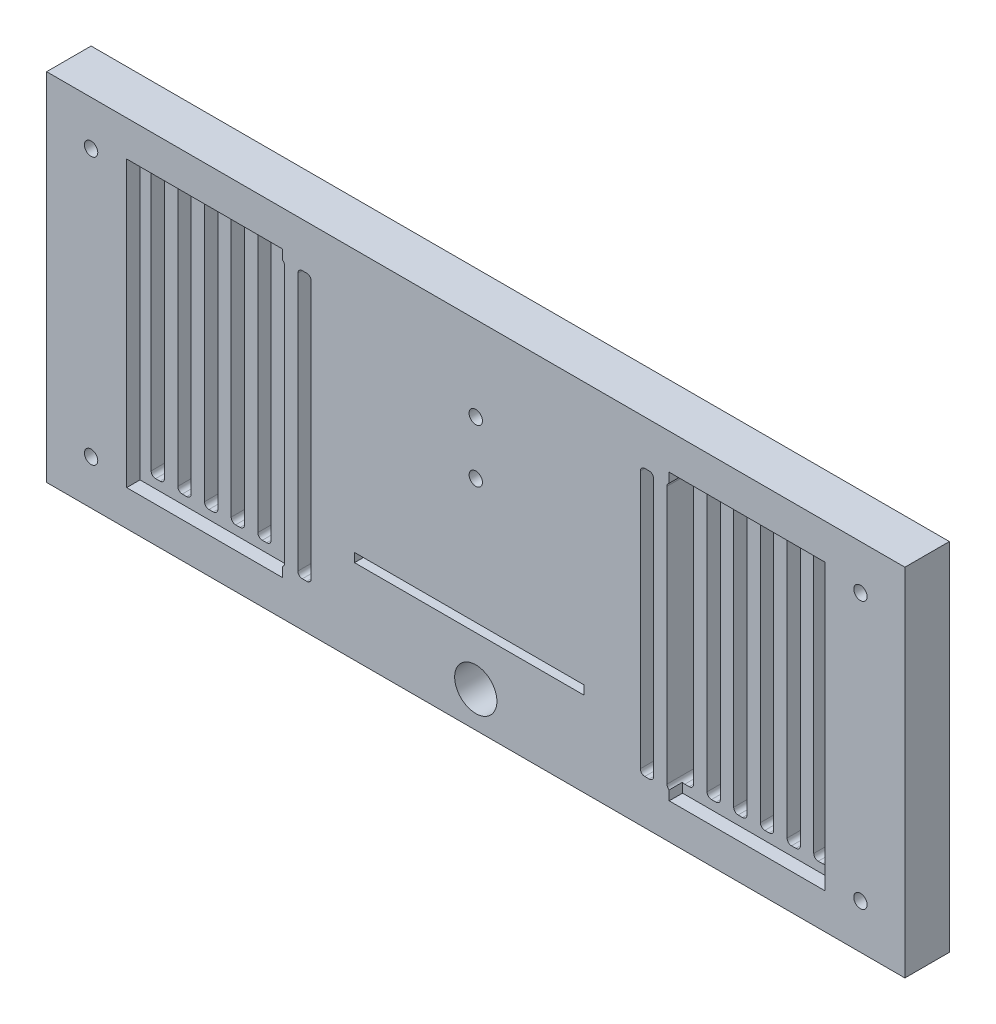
ISO-10303-21;
HEADER;
FILE_DESCRIPTION(('STEP AP214'),'2;1');
FILE_NAME('part.step','',(''),(''),'','','');
FILE_SCHEMA(('AUTOMOTIVE_DESIGN { 1 0 10303 214 1 1 1 1 }'));
ENDSEC;
DATA;
#1=APPLICATION_CONTEXT('core data for automotive mechanical design processes');
#2=APPLICATION_PROTOCOL_DEFINITION('international standard','automotive_design',2000,#1);
#3=PRODUCT_CONTEXT('',#1,'mechanical');
#4=PRODUCT('Part','Part','',(#3));
#5=PRODUCT_RELATED_PRODUCT_CATEGORY('part','',(#4));
#6=PRODUCT_DEFINITION_FORMATION('','',#4);
#7=PRODUCT_DEFINITION_CONTEXT('part definition',#1,'design');
#8=PRODUCT_DEFINITION('design','',#6,#7);
#9=PRODUCT_DEFINITION_SHAPE('','',#8);
#10=(LENGTH_UNIT() NAMED_UNIT(*) SI_UNIT(.MILLI.,.METRE.));
#11=(NAMED_UNIT(*) PLANE_ANGLE_UNIT() SI_UNIT($,.RADIAN.));
#12=(NAMED_UNIT(*) SI_UNIT($,.STERADIAN.) SOLID_ANGLE_UNIT());
#13=UNCERTAINTY_MEASURE_WITH_UNIT(LENGTH_MEASURE(1.E-05),#10,'distance_accuracy_value','');
#14=(GEOMETRIC_REPRESENTATION_CONTEXT(3) GLOBAL_UNCERTAINTY_ASSIGNED_CONTEXT((#13)) GLOBAL_UNIT_ASSIGNED_CONTEXT((#10,
#11,#12)) REPRESENTATION_CONTEXT('',''));
#15=CARTESIAN_POINT('',(0.,0.,0.));
#16=DIRECTION('',(0.,0.,1.));
#17=DIRECTION('',(1.,0.,0.));
#18=AXIS2_PLACEMENT_3D('',#15,#16,#17);
#19=CARTESIAN_POINT('',(-73.,69.,0.));
#20=DIRECTION('',(1.,0.,0.));
#21=DIRECTION('',(0.,1.,0.));
#22=AXIS2_PLACEMENT_3D('',#19,#20,#21);
#23=PLANE('',#22);
#24=DIRECTION('',(0.,-1.,0.));
#25=VECTOR('',#24,1.);
#26=CARTESIAN_POINT('',(-73.,69.,7.));
#27=LINE('',#26,#25);
#28=CARTESIAN_POINT('',(-73.,69.,7.));
#29=VERTEX_POINT('',#28);
#30=CARTESIAN_POINT('',(-73.,11.,7.));
#31=VERTEX_POINT('',#30);
#32=EDGE_CURVE('E51',#29,#31,#27,.T.);
#33=ORIENTED_EDGE('',*,*,#32,.F.);
#34=DIRECTION('',(0.,0.,1.));
#35=VECTOR('',#34,1.);
#36=CARTESIAN_POINT('',(-73.,69.,0.));
#37=LINE('',#36,#35);
#38=CARTESIAN_POINT('',(-73.,69.,0.));
#39=VERTEX_POINT('',#38);
#40=EDGE_CURVE('E1894',#39,#29,#37,.T.);
#41=ORIENTED_EDGE('',*,*,#40,.F.);
#42=DIRECTION('',(0.,1.,0.));
#43=VECTOR('',#42,1.);
#44=CARTESIAN_POINT('',(-73.,69.,0.));
#45=LINE('',#44,#43);
#46=CARTESIAN_POINT('',(-73.,11.,0.));
#47=VERTEX_POINT('',#46);
#48=EDGE_CURVE('E1858',#47,#39,#45,.T.);
#49=ORIENTED_EDGE('',*,*,#48,.F.);
#50=DIRECTION('',(0.,0.,1.));
#51=VECTOR('',#50,1.);
#52=CARTESIAN_POINT('',(-73.,11.,0.));
#53=LINE('',#52,#51);
#54=EDGE_CURVE('E1873',#47,#31,#53,.T.);
#55=ORIENTED_EDGE('',*,*,#54,.T.);
#56=EDGE_LOOP('',(#33,#41,#49,#55));
#57=FACE_BOUND('',#56,.T.);
#58=ADVANCED_FACE('F37',(#57),#23,.F.);
#59=CARTESIAN_POINT('',(-74.,69.,0.));
#60=DIRECTION('',(0.,0.,1.));
#61=DIRECTION('',(1.,0.,0.));
#62=AXIS2_PLACEMENT_3D('',#59,#60,#61);
#63=CYLINDRICAL_SURFACE('',#62,1.);
#64=CARTESIAN_POINT('',(-74.,69.,7.));
#65=DIRECTION('',(0.,0.,1.));
#66=DIRECTION('',(1.,0.,0.));
#67=AXIS2_PLACEMENT_3D('',#64,#65,#66);
#68=CIRCLE('',#67,1.);
#69=CARTESIAN_POINT('',(-74.,70.,7.));
#70=VERTEX_POINT('',#69);
#71=EDGE_CURVE('E1151',#70,#29,#68,.F.);
#72=ORIENTED_EDGE('',*,*,#71,.F.);
#73=DIRECTION('',(0.,0.,1.));
#74=VECTOR('',#73,1.);
#75=CARTESIAN_POINT('',(-74.,70.,0.));
#76=LINE('',#75,#74);
#77=CARTESIAN_POINT('',(-74.,70.,0.));
#78=VERTEX_POINT('',#77);
#79=EDGE_CURVE('E1891',#78,#70,#76,.T.);
#80=ORIENTED_EDGE('',*,*,#79,.F.);
#81=CARTESIAN_POINT('',(-74.,69.,0.));
#82=DIRECTION('',(0.,0.,1.));
#83=DIRECTION('',(-1.,0.,0.));
#84=AXIS2_PLACEMENT_3D('',#81,#82,#83);
#85=CIRCLE('',#84,1.);
#86=EDGE_CURVE('E1860',#39,#78,#85,.T.);
#87=ORIENTED_EDGE('',*,*,#86,.F.);
#88=ORIENTED_EDGE('',*,*,#40,.T.);
#89=EDGE_LOOP('',(#72,#80,#87,#88));
#90=FACE_BOUND('',#89,.T.);
#91=ADVANCED_FACE('F2037',(#90),#63,.F.);
#92=CARTESIAN_POINT('',(-75.,70.,0.));
#93=DIRECTION('',(0.,1.,0.));
#94=DIRECTION('',(-1.,0.,0.));
#95=AXIS2_PLACEMENT_3D('',#92,#93,#94);
#96=PLANE('',#95);
#97=DIRECTION('',(1.,0.,0.));
#98=VECTOR('',#97,1.);
#99=CARTESIAN_POINT('',(-75.,70.,7.));
#100=LINE('',#99,#98);
#101=CARTESIAN_POINT('',(-75.,70.,7.));
#102=VERTEX_POINT('',#101);
#103=EDGE_CURVE('E1149',#102,#70,#100,.T.);
#104=ORIENTED_EDGE('',*,*,#103,.F.);
#105=DIRECTION('',(0.,0.,1.));
#106=VECTOR('',#105,1.);
#107=CARTESIAN_POINT('',(-75.,70.,0.));
#108=LINE('',#107,#106);
#109=CARTESIAN_POINT('',(-75.,70.,0.));
#110=VERTEX_POINT('',#109);
#111=EDGE_CURVE('E1888',#110,#102,#108,.T.);
#112=ORIENTED_EDGE('',*,*,#111,.F.);
#113=DIRECTION('',(-1.,0.,0.));
#114=VECTOR('',#113,1.);
#115=CARTESIAN_POINT('',(-75.,70.,0.));
#116=LINE('',#115,#114);
#117=EDGE_CURVE('E1862',#78,#110,#116,.T.);
#118=ORIENTED_EDGE('',*,*,#117,.F.);
#119=ORIENTED_EDGE('',*,*,#79,.T.);
#120=EDGE_LOOP('',(#104,#112,#118,#119));
#121=FACE_BOUND('',#120,.T.);
#122=ADVANCED_FACE('F2042',(#121),#96,.F.);
#123=CARTESIAN_POINT('',(-75.,69.,0.));
#124=DIRECTION('',(0.,0.,1.));
#125=DIRECTION('',(1.,0.,0.));
#126=AXIS2_PLACEMENT_3D('',#123,#124,#125);
#127=CYLINDRICAL_SURFACE('',#126,1.);
#128=CARTESIAN_POINT('',(-75.,69.,7.));
#129=DIRECTION('',(0.,0.,1.));
#130=DIRECTION('',(1.,0.,0.));
#131=AXIS2_PLACEMENT_3D('',#128,#129,#130);
#132=CIRCLE('',#131,1.);
#133=CARTESIAN_POINT('',(-76.,69.,7.));
#134=VERTEX_POINT('',#133);
#135=EDGE_CURVE('E1147',#134,#102,#132,.F.);
#136=ORIENTED_EDGE('',*,*,#135,.F.);
#137=DIRECTION('',(0.,0.,1.));
#138=VECTOR('',#137,1.);
#139=CARTESIAN_POINT('',(-76.,69.,0.));
#140=LINE('',#139,#138);
#141=CARTESIAN_POINT('',(-76.,69.,0.));
#142=VERTEX_POINT('',#141);
#143=EDGE_CURVE('E1885',#142,#134,#140,.T.);
#144=ORIENTED_EDGE('',*,*,#143,.F.);
#145=CARTESIAN_POINT('',(-75.,69.,0.));
#146=DIRECTION('',(0.,0.,1.));
#147=DIRECTION('',(1.,0.,0.));
#148=AXIS2_PLACEMENT_3D('',#145,#146,#147);
#149=CIRCLE('',#148,1.);
#150=EDGE_CURVE('E1864',#110,#142,#149,.T.);
#151=ORIENTED_EDGE('',*,*,#150,.F.);
#152=ORIENTED_EDGE('',*,*,#111,.T.);
#153=EDGE_LOOP('',(#136,#144,#151,#152));
#154=FACE_BOUND('',#153,.T.);
#155=ADVANCED_FACE('F2059',(#154),#127,.F.);
#156=CARTESIAN_POINT('',(-76.,69.,0.));
#157=DIRECTION('',(-1.,0.,0.));
#158=DIRECTION('',(0.,0.,1.));
#159=AXIS2_PLACEMENT_3D('',#156,#157,#158);
#160=PLANE('',#159);
#161=DIRECTION('',(0.,1.,0.));
#162=VECTOR('',#161,1.);
#163=CARTESIAN_POINT('',(-76.,69.,7.));
#164=LINE('',#163,#162);
#165=CARTESIAN_POINT('',(-76.,11.,7.));
#166=VERTEX_POINT('',#165);
#167=EDGE_CURVE('E1145',#166,#134,#164,.T.);
#168=ORIENTED_EDGE('',*,*,#167,.F.);
#169=DIRECTION('',(0.,0.,1.));
#170=VECTOR('',#169,1.);
#171=CARTESIAN_POINT('',(-76.,11.,0.));
#172=LINE('',#171,#170);
#173=CARTESIAN_POINT('',(-76.,11.,0.));
#174=VERTEX_POINT('',#173);
#175=EDGE_CURVE('E1882',#174,#166,#172,.T.);
#176=ORIENTED_EDGE('',*,*,#175,.F.);
#177=DIRECTION('',(0.,-1.,0.));
#178=VECTOR('',#177,1.);
#179=CARTESIAN_POINT('',(-76.,69.,0.));
#180=LINE('',#179,#178);
#181=EDGE_CURVE('E1866',#142,#174,#180,.T.);
#182=ORIENTED_EDGE('',*,*,#181,.F.);
#183=ORIENTED_EDGE('',*,*,#143,.T.);
#184=EDGE_LOOP('',(#168,#176,#182,#183));
#185=FACE_BOUND('',#184,.T.);
#186=ADVANCED_FACE('F2066',(#185),#160,.F.);
#187=CARTESIAN_POINT('',(-75.,11.,0.));
#188=DIRECTION('',(0.,0.,1.));
#189=DIRECTION('',(1.,0.,0.));
#190=AXIS2_PLACEMENT_3D('',#187,#188,#189);
#191=CYLINDRICAL_SURFACE('',#190,1.);
#192=CARTESIAN_POINT('',(-75.,11.,7.));
#193=DIRECTION('',(0.,0.,1.));
#194=DIRECTION('',(1.,0.,0.));
#195=AXIS2_PLACEMENT_3D('',#192,#193,#194);
#196=CIRCLE('',#195,1.);
#197=CARTESIAN_POINT('',(-75.,10.,7.));
#198=VERTEX_POINT('',#197);
#199=EDGE_CURVE('E1143',#198,#166,#196,.F.);
#200=ORIENTED_EDGE('',*,*,#199,.F.);
#201=DIRECTION('',(0.,0.,1.));
#202=VECTOR('',#201,1.);
#203=CARTESIAN_POINT('',(-75.,10.,0.));
#204=LINE('',#203,#202);
#205=CARTESIAN_POINT('',(-75.,10.,0.));
#206=VERTEX_POINT('',#205);
#207=EDGE_CURVE('E1879',#206,#198,#204,.T.);
#208=ORIENTED_EDGE('',*,*,#207,.F.);
#209=CARTESIAN_POINT('',(-75.,11.,0.));
#210=DIRECTION('',(0.,0.,1.));
#211=DIRECTION('',(1.,0.,0.));
#212=AXIS2_PLACEMENT_3D('',#209,#210,#211);
#213=CIRCLE('',#212,1.);
#214=EDGE_CURVE('E1868',#174,#206,#213,.T.);
#215=ORIENTED_EDGE('',*,*,#214,.F.);
#216=ORIENTED_EDGE('',*,*,#175,.T.);
#217=EDGE_LOOP('',(#200,#208,#215,#216));
#218=FACE_BOUND('',#217,.T.);
#219=ADVANCED_FACE('F2069',(#218),#191,.F.);
#220=CARTESIAN_POINT('',(-75.,10.,0.));
#221=DIRECTION('',(0.,-1.,0.));
#222=DIRECTION('',(0.,0.,-1.));
#223=AXIS2_PLACEMENT_3D('',#220,#221,#222);
#224=PLANE('',#223);
#225=DIRECTION('',(-1.,0.,0.));
#226=VECTOR('',#225,1.);
#227=CARTESIAN_POINT('',(-75.,10.,7.));
#228=LINE('',#227,#226);
#229=CARTESIAN_POINT('',(-74.,10.,7.));
#230=VERTEX_POINT('',#229);
#231=EDGE_CURVE('E1141',#230,#198,#228,.T.);
#232=ORIENTED_EDGE('',*,*,#231,.F.);
#233=DIRECTION('',(0.,0.,1.));
#234=VECTOR('',#233,1.);
#235=CARTESIAN_POINT('',(-74.,10.,0.));
#236=LINE('',#235,#234);
#237=CARTESIAN_POINT('',(-74.,10.,0.));
#238=VERTEX_POINT('',#237);
#239=EDGE_CURVE('E1876',#238,#230,#236,.T.);
#240=ORIENTED_EDGE('',*,*,#239,.F.);
#241=DIRECTION('',(1.,0.,0.));
#242=VECTOR('',#241,1.);
#243=CARTESIAN_POINT('',(-75.,10.,0.));
#244=LINE('',#243,#242);
#245=EDGE_CURVE('E1870',#206,#238,#244,.T.);
#246=ORIENTED_EDGE('',*,*,#245,.F.);
#247=ORIENTED_EDGE('',*,*,#207,.T.);
#248=EDGE_LOOP('',(#232,#240,#246,#247));
#249=FACE_BOUND('',#248,.T.);
#250=ADVANCED_FACE('F2075',(#249),#224,.F.);
#251=CARTESIAN_POINT('',(-74.,11.,0.));
#252=DIRECTION('',(0.,0.,1.));
#253=DIRECTION('',(1.,0.,0.));
#254=AXIS2_PLACEMENT_3D('',#251,#252,#253);
#255=CYLINDRICAL_SURFACE('',#254,0.999999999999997);
#256=CARTESIAN_POINT('',(-74.,11.,7.));
#257=DIRECTION('',(0.,0.,1.));
#258=DIRECTION('',(1.,0.,0.));
#259=AXIS2_PLACEMENT_3D('',#256,#257,#258);
#260=CIRCLE('',#259,0.999999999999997);
#261=EDGE_CURVE('E1139',#31,#230,#260,.F.);
#262=ORIENTED_EDGE('',*,*,#261,.F.);
#263=ORIENTED_EDGE('',*,*,#54,.F.);
#264=CARTESIAN_POINT('',(-74.,11.,0.));
#265=DIRECTION('',(0.,0.,1.));
#266=DIRECTION('',(1.,0.,0.));
#267=AXIS2_PLACEMENT_3D('',#264,#265,#266);
#268=CIRCLE('',#267,0.999999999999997);
#269=EDGE_CURVE('E1856',#238,#47,#268,.T.);
#270=ORIENTED_EDGE('',*,*,#269,.F.);
#271=ORIENTED_EDGE('',*,*,#239,.T.);
#272=EDGE_LOOP('',(#262,#263,#270,#271));
#273=FACE_BOUND('',#272,.T.);
#274=ADVANCED_FACE('F2077',(#273),#255,.F.);
#275=CARTESIAN_POINT('',(-67.,69.,0.));
#276=DIRECTION('',(1.,0.,0.));
#277=DIRECTION('',(0.,1.,0.));
#278=AXIS2_PLACEMENT_3D('',#275,#276,#277);
#279=PLANE('',#278);
#280=DIRECTION('',(0.,-1.,0.));
#281=VECTOR('',#280,1.);
#282=CARTESIAN_POINT('',(-67.,69.,7.));
#283=LINE('',#282,#281);
#284=CARTESIAN_POINT('',(-67.,69.,7.));
#285=VERTEX_POINT('',#284);
#286=CARTESIAN_POINT('',(-67.,11.,7.));
#287=VERTEX_POINT('',#286);
#288=EDGE_CURVE('E59',#285,#287,#283,.T.);
#289=ORIENTED_EDGE('',*,*,#288,.F.);
#290=DIRECTION('',(0.,0.,1.));
#291=VECTOR('',#290,1.);
#292=CARTESIAN_POINT('',(-67.,69.,0.));
#293=LINE('',#292,#291);
#294=CARTESIAN_POINT('',(-67.,69.,0.));
#295=VERTEX_POINT('',#294);
#296=EDGE_CURVE('E1853',#295,#285,#293,.T.);
#297=ORIENTED_EDGE('',*,*,#296,.F.);
#298=DIRECTION('',(0.,1.,0.));
#299=VECTOR('',#298,1.);
#300=CARTESIAN_POINT('',(-67.,69.,0.));
#301=LINE('',#300,#299);
#302=CARTESIAN_POINT('',(-67.,11.,0.));
#303=VERTEX_POINT('',#302);
#304=EDGE_CURVE('E1817',#303,#295,#301,.T.);
#305=ORIENTED_EDGE('',*,*,#304,.F.);
#306=DIRECTION('',(0.,0.,1.));
#307=VECTOR('',#306,1.);
#308=CARTESIAN_POINT('',(-67.,11.,0.));
#309=LINE('',#308,#307);
#310=EDGE_CURVE('E1832',#303,#287,#309,.T.);
#311=ORIENTED_EDGE('',*,*,#310,.T.);
#312=EDGE_LOOP('',(#289,#297,#305,#311));
#313=FACE_BOUND('',#312,.T.);
#314=ADVANCED_FACE('F2491',(#313),#279,.F.);
#315=CARTESIAN_POINT('',(-68.,69.,0.));
#316=DIRECTION('',(0.,0.,1.));
#317=DIRECTION('',(1.,0.,0.));
#318=AXIS2_PLACEMENT_3D('',#315,#316,#317);
#319=CYLINDRICAL_SURFACE('',#318,1.);
#320=CARTESIAN_POINT('',(-68.,69.,7.));
#321=DIRECTION('',(0.,0.,1.));
#322=DIRECTION('',(1.,0.,0.));
#323=AXIS2_PLACEMENT_3D('',#320,#321,#322);
#324=CIRCLE('',#323,1.);
#325=CARTESIAN_POINT('',(-68.,70.,7.));
#326=VERTEX_POINT('',#325);
#327=EDGE_CURVE('E1136',#326,#285,#324,.F.);
#328=ORIENTED_EDGE('',*,*,#327,.F.);
#329=DIRECTION('',(0.,0.,1.));
#330=VECTOR('',#329,1.);
#331=CARTESIAN_POINT('',(-68.,70.,0.));
#332=LINE('',#331,#330);
#333=CARTESIAN_POINT('',(-68.,70.,0.));
#334=VERTEX_POINT('',#333);
#335=EDGE_CURVE('E1850',#334,#326,#332,.T.);
#336=ORIENTED_EDGE('',*,*,#335,.F.);
#337=CARTESIAN_POINT('',(-68.,69.,0.));
#338=DIRECTION('',(0.,0.,1.));
#339=DIRECTION('',(-1.,0.,0.));
#340=AXIS2_PLACEMENT_3D('',#337,#338,#339);
#341=CIRCLE('',#340,1.);
#342=EDGE_CURVE('E1819',#295,#334,#341,.T.);
#343=ORIENTED_EDGE('',*,*,#342,.F.);
#344=ORIENTED_EDGE('',*,*,#296,.T.);
#345=EDGE_LOOP('',(#328,#336,#343,#344));
#346=FACE_BOUND('',#345,.T.);
#347=ADVANCED_FACE('F2487',(#346),#319,.F.);
#348=CARTESIAN_POINT('',(-69.,70.,0.));
#349=DIRECTION('',(0.,1.,0.));
#350=DIRECTION('',(-1.,0.,0.));
#351=AXIS2_PLACEMENT_3D('',#348,#349,#350);
#352=PLANE('',#351);
#353=DIRECTION('',(1.,0.,0.));
#354=VECTOR('',#353,1.);
#355=CARTESIAN_POINT('',(-69.,70.,7.));
#356=LINE('',#355,#354);
#357=CARTESIAN_POINT('',(-69.,70.,7.));
#358=VERTEX_POINT('',#357);
#359=EDGE_CURVE('E1134',#358,#326,#356,.T.);
#360=ORIENTED_EDGE('',*,*,#359,.F.);
#361=DIRECTION('',(0.,0.,1.));
#362=VECTOR('',#361,1.);
#363=CARTESIAN_POINT('',(-69.,70.,0.));
#364=LINE('',#363,#362);
#365=CARTESIAN_POINT('',(-69.,70.,0.));
#366=VERTEX_POINT('',#365);
#367=EDGE_CURVE('E1847',#366,#358,#364,.T.);
#368=ORIENTED_EDGE('',*,*,#367,.F.);
#369=DIRECTION('',(-1.,0.,0.));
#370=VECTOR('',#369,1.);
#371=CARTESIAN_POINT('',(-69.,70.,0.));
#372=LINE('',#371,#370);
#373=EDGE_CURVE('E1821',#334,#366,#372,.T.);
#374=ORIENTED_EDGE('',*,*,#373,.F.);
#375=ORIENTED_EDGE('',*,*,#335,.T.);
#376=EDGE_LOOP('',(#360,#368,#374,#375));
#377=FACE_BOUND('',#376,.T.);
#378=ADVANCED_FACE('F2483',(#377),#352,.F.);
#379=CARTESIAN_POINT('',(-69.,69.,0.));
#380=DIRECTION('',(0.,0.,1.));
#381=DIRECTION('',(1.,0.,0.));
#382=AXIS2_PLACEMENT_3D('',#379,#380,#381);
#383=CYLINDRICAL_SURFACE('',#382,1.);
#384=CARTESIAN_POINT('',(-69.,69.,7.));
#385=DIRECTION('',(0.,0.,1.));
#386=DIRECTION('',(1.,0.,0.));
#387=AXIS2_PLACEMENT_3D('',#384,#385,#386);
#388=CIRCLE('',#387,1.);
#389=CARTESIAN_POINT('',(-70.,69.,7.));
#390=VERTEX_POINT('',#389);
#391=EDGE_CURVE('E1132',#390,#358,#388,.F.);
#392=ORIENTED_EDGE('',*,*,#391,.F.);
#393=DIRECTION('',(0.,0.,1.));
#394=VECTOR('',#393,1.);
#395=CARTESIAN_POINT('',(-70.,69.,0.));
#396=LINE('',#395,#394);
#397=CARTESIAN_POINT('',(-70.,69.,0.));
#398=VERTEX_POINT('',#397);
#399=EDGE_CURVE('E1844',#398,#390,#396,.T.);
#400=ORIENTED_EDGE('',*,*,#399,.F.);
#401=CARTESIAN_POINT('',(-69.,69.,0.));
#402=DIRECTION('',(0.,0.,1.));
#403=DIRECTION('',(1.,0.,0.));
#404=AXIS2_PLACEMENT_3D('',#401,#402,#403);
#405=CIRCLE('',#404,1.);
#406=EDGE_CURVE('E1823',#366,#398,#405,.T.);
#407=ORIENTED_EDGE('',*,*,#406,.F.);
#408=ORIENTED_EDGE('',*,*,#367,.T.);
#409=EDGE_LOOP('',(#392,#400,#407,#408));
#410=FACE_BOUND('',#409,.T.);
#411=ADVANCED_FACE('F2479',(#410),#383,.F.);
#412=CARTESIAN_POINT('',(-70.,69.,0.));
#413=DIRECTION('',(-1.,0.,0.));
#414=DIRECTION('',(0.,0.,1.));
#415=AXIS2_PLACEMENT_3D('',#412,#413,#414);
#416=PLANE('',#415);
#417=DIRECTION('',(0.,1.,0.));
#418=VECTOR('',#417,1.);
#419=CARTESIAN_POINT('',(-70.,69.,7.));
#420=LINE('',#419,#418);
#421=CARTESIAN_POINT('',(-70.,11.,7.));
#422=VERTEX_POINT('',#421);
#423=EDGE_CURVE('E1130',#422,#390,#420,.T.);
#424=ORIENTED_EDGE('',*,*,#423,.F.);
#425=DIRECTION('',(0.,0.,1.));
#426=VECTOR('',#425,1.);
#427=CARTESIAN_POINT('',(-70.,11.,0.));
#428=LINE('',#427,#426);
#429=CARTESIAN_POINT('',(-70.,11.,0.));
#430=VERTEX_POINT('',#429);
#431=EDGE_CURVE('E1841',#430,#422,#428,.T.);
#432=ORIENTED_EDGE('',*,*,#431,.F.);
#433=DIRECTION('',(0.,-1.,0.));
#434=VECTOR('',#433,1.);
#435=CARTESIAN_POINT('',(-70.,69.,0.));
#436=LINE('',#435,#434);
#437=EDGE_CURVE('E1825',#398,#430,#436,.T.);
#438=ORIENTED_EDGE('',*,*,#437,.F.);
#439=ORIENTED_EDGE('',*,*,#399,.T.);
#440=EDGE_LOOP('',(#424,#432,#438,#439));
#441=FACE_BOUND('',#440,.T.);
#442=ADVANCED_FACE('F2475',(#441),#416,.F.);
#443=CARTESIAN_POINT('',(-69.,11.,0.));
#444=DIRECTION('',(0.,0.,1.));
#445=DIRECTION('',(1.,0.,0.));
#446=AXIS2_PLACEMENT_3D('',#443,#444,#445);
#447=CYLINDRICAL_SURFACE('',#446,1.);
#448=CARTESIAN_POINT('',(-69.,11.,7.));
#449=DIRECTION('',(0.,0.,1.));
#450=DIRECTION('',(1.,0.,0.));
#451=AXIS2_PLACEMENT_3D('',#448,#449,#450);
#452=CIRCLE('',#451,1.);
#453=CARTESIAN_POINT('',(-69.,10.,7.));
#454=VERTEX_POINT('',#453);
#455=EDGE_CURVE('E1128',#454,#422,#452,.F.);
#456=ORIENTED_EDGE('',*,*,#455,.F.);
#457=DIRECTION('',(0.,0.,1.));
#458=VECTOR('',#457,1.);
#459=CARTESIAN_POINT('',(-69.,10.,0.));
#460=LINE('',#459,#458);
#461=CARTESIAN_POINT('',(-69.,10.,0.));
#462=VERTEX_POINT('',#461);
#463=EDGE_CURVE('E1838',#462,#454,#460,.T.);
#464=ORIENTED_EDGE('',*,*,#463,.F.);
#465=CARTESIAN_POINT('',(-69.,11.,0.));
#466=DIRECTION('',(0.,0.,1.));
#467=DIRECTION('',(1.,0.,0.));
#468=AXIS2_PLACEMENT_3D('',#465,#466,#467);
#469=CIRCLE('',#468,1.);
#470=EDGE_CURVE('E1827',#430,#462,#469,.T.);
#471=ORIENTED_EDGE('',*,*,#470,.F.);
#472=ORIENTED_EDGE('',*,*,#431,.T.);
#473=EDGE_LOOP('',(#456,#464,#471,#472));
#474=FACE_BOUND('',#473,.T.);
#475=ADVANCED_FACE('F2471',(#474),#447,.F.);
#476=CARTESIAN_POINT('',(-69.,10.,0.));
#477=DIRECTION('',(0.,-1.,0.));
#478=DIRECTION('',(0.,0.,-1.));
#479=AXIS2_PLACEMENT_3D('',#476,#477,#478);
#480=PLANE('',#479);
#481=DIRECTION('',(-1.,0.,0.));
#482=VECTOR('',#481,1.);
#483=CARTESIAN_POINT('',(-69.,10.,7.));
#484=LINE('',#483,#482);
#485=CARTESIAN_POINT('',(-68.,10.,7.));
#486=VERTEX_POINT('',#485);
#487=EDGE_CURVE('E1126',#486,#454,#484,.T.);
#488=ORIENTED_EDGE('',*,*,#487,.F.);
#489=DIRECTION('',(0.,0.,1.));
#490=VECTOR('',#489,1.);
#491=CARTESIAN_POINT('',(-68.,10.,0.));
#492=LINE('',#491,#490);
#493=CARTESIAN_POINT('',(-68.,10.,0.));
#494=VERTEX_POINT('',#493);
#495=EDGE_CURVE('E1835',#494,#486,#492,.T.);
#496=ORIENTED_EDGE('',*,*,#495,.F.);
#497=DIRECTION('',(1.,0.,0.));
#498=VECTOR('',#497,1.);
#499=CARTESIAN_POINT('',(-69.,10.,0.));
#500=LINE('',#499,#498);
#501=EDGE_CURVE('E1829',#462,#494,#500,.T.);
#502=ORIENTED_EDGE('',*,*,#501,.F.);
#503=ORIENTED_EDGE('',*,*,#463,.T.);
#504=EDGE_LOOP('',(#488,#496,#502,#503));
#505=FACE_BOUND('',#504,.T.);
#506=ADVANCED_FACE('F2467',(#505),#480,.F.);
#507=CARTESIAN_POINT('',(-68.,11.,0.));
#508=DIRECTION('',(0.,0.,1.));
#509=DIRECTION('',(1.,0.,0.));
#510=AXIS2_PLACEMENT_3D('',#507,#508,#509);
#511=CYLINDRICAL_SURFACE('',#510,0.999999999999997);
#512=CARTESIAN_POINT('',(-68.,11.,7.));
#513=DIRECTION('',(0.,0.,1.));
#514=DIRECTION('',(1.,0.,0.));
#515=AXIS2_PLACEMENT_3D('',#512,#513,#514);
#516=CIRCLE('',#515,0.999999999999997);
#517=EDGE_CURVE('E1124',#287,#486,#516,.F.);
#518=ORIENTED_EDGE('',*,*,#517,.F.);
#519=ORIENTED_EDGE('',*,*,#310,.F.);
#520=CARTESIAN_POINT('',(-68.,11.,0.));
#521=DIRECTION('',(0.,0.,1.));
#522=DIRECTION('',(1.,0.,0.));
#523=AXIS2_PLACEMENT_3D('',#520,#521,#522);
#524=CIRCLE('',#523,0.999999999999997);
#525=EDGE_CURVE('E1815',#494,#303,#524,.T.);
#526=ORIENTED_EDGE('',*,*,#525,.F.);
#527=ORIENTED_EDGE('',*,*,#495,.T.);
#528=EDGE_LOOP('',(#518,#519,#526,#527));
#529=FACE_BOUND('',#528,.T.);
#530=ADVANCED_FACE('F2463',(#529),#511,.F.);
#531=CARTESIAN_POINT('',(-61.,69.,0.));
#532=DIRECTION('',(1.,0.,0.));
#533=DIRECTION('',(0.,1.,0.));
#534=AXIS2_PLACEMENT_3D('',#531,#532,#533);
#535=PLANE('',#534);
#536=DIRECTION('',(0.,-1.,0.));
#537=VECTOR('',#536,1.);
#538=CARTESIAN_POINT('',(-61.,69.,7.));
#539=LINE('',#538,#537);
#540=CARTESIAN_POINT('',(-61.,69.,7.));
#541=VERTEX_POINT('',#540);
#542=CARTESIAN_POINT('',(-61.,11.,7.));
#543=VERTEX_POINT('',#542);
#544=EDGE_CURVE('E1122',#541,#543,#539,.T.);
#545=ORIENTED_EDGE('',*,*,#544,.F.);
#546=DIRECTION('',(0.,0.,1.));
#547=VECTOR('',#546,1.);
#548=CARTESIAN_POINT('',(-61.,69.,0.));
#549=LINE('',#548,#547);
#550=CARTESIAN_POINT('',(-61.,69.,0.));
#551=VERTEX_POINT('',#550);
#552=EDGE_CURVE('E1812',#551,#541,#549,.T.);
#553=ORIENTED_EDGE('',*,*,#552,.F.);
#554=DIRECTION('',(0.,1.,0.));
#555=VECTOR('',#554,1.);
#556=CARTESIAN_POINT('',(-61.,69.,0.));
#557=LINE('',#556,#555);
#558=CARTESIAN_POINT('',(-61.,11.,0.));
#559=VERTEX_POINT('',#558);
#560=EDGE_CURVE('E1776',#559,#551,#557,.T.);
#561=ORIENTED_EDGE('',*,*,#560,.F.);
#562=DIRECTION('',(0.,0.,1.));
#563=VECTOR('',#562,1.);
#564=CARTESIAN_POINT('',(-61.,11.,0.));
#565=LINE('',#564,#563);
#566=EDGE_CURVE('E1791',#559,#543,#565,.T.);
#567=ORIENTED_EDGE('',*,*,#566,.T.);
#568=EDGE_LOOP('',(#545,#553,#561,#567));
#569=FACE_BOUND('',#568,.T.);
#570=ADVANCED_FACE('F2459',(#569),#535,.F.);
#571=CARTESIAN_POINT('',(-62.,69.,0.));
#572=DIRECTION('',(0.,0.,1.));
#573=DIRECTION('',(1.,0.,0.));
#574=AXIS2_PLACEMENT_3D('',#571,#572,#573);
#575=CYLINDRICAL_SURFACE('',#574,1.);
#576=CARTESIAN_POINT('',(-62.,69.,7.));
#577=DIRECTION('',(0.,0.,1.));
#578=DIRECTION('',(1.,0.,0.));
#579=AXIS2_PLACEMENT_3D('',#576,#577,#578);
#580=CIRCLE('',#579,1.);
#581=CARTESIAN_POINT('',(-62.,70.,7.));
#582=VERTEX_POINT('',#581);
#583=EDGE_CURVE('E1120',#582,#541,#580,.F.);
#584=ORIENTED_EDGE('',*,*,#583,.F.);
#585=DIRECTION('',(0.,0.,1.));
#586=VECTOR('',#585,1.);
#587=CARTESIAN_POINT('',(-62.,70.,0.));
#588=LINE('',#587,#586);
#589=CARTESIAN_POINT('',(-62.,70.,0.));
#590=VERTEX_POINT('',#589);
#591=EDGE_CURVE('E1809',#590,#582,#588,.T.);
#592=ORIENTED_EDGE('',*,*,#591,.F.);
#593=CARTESIAN_POINT('',(-62.,69.,0.));
#594=DIRECTION('',(0.,0.,1.));
#595=DIRECTION('',(-1.,0.,0.));
#596=AXIS2_PLACEMENT_3D('',#593,#594,#595);
#597=CIRCLE('',#596,1.);
#598=EDGE_CURVE('E1778',#551,#590,#597,.T.);
#599=ORIENTED_EDGE('',*,*,#598,.F.);
#600=ORIENTED_EDGE('',*,*,#552,.T.);
#601=EDGE_LOOP('',(#584,#592,#599,#600));
#602=FACE_BOUND('',#601,.T.);
#603=ADVANCED_FACE('F2455',(#602),#575,.F.);
#604=CARTESIAN_POINT('',(-63.,70.,0.));
#605=DIRECTION('',(0.,1.,0.));
#606=DIRECTION('',(-1.,0.,0.));
#607=AXIS2_PLACEMENT_3D('',#604,#605,#606);
#608=PLANE('',#607);
#609=DIRECTION('',(1.,0.,0.));
#610=VECTOR('',#609,1.);
#611=CARTESIAN_POINT('',(-63.,70.,7.));
#612=LINE('',#611,#610);
#613=CARTESIAN_POINT('',(-63.,70.,7.));
#614=VERTEX_POINT('',#613);
#615=EDGE_CURVE('E1118',#614,#582,#612,.T.);
#616=ORIENTED_EDGE('',*,*,#615,.F.);
#617=DIRECTION('',(0.,0.,1.));
#618=VECTOR('',#617,1.);
#619=CARTESIAN_POINT('',(-63.,70.,0.));
#620=LINE('',#619,#618);
#621=CARTESIAN_POINT('',(-63.,70.,0.));
#622=VERTEX_POINT('',#621);
#623=EDGE_CURVE('E1806',#622,#614,#620,.T.);
#624=ORIENTED_EDGE('',*,*,#623,.F.);
#625=DIRECTION('',(-1.,0.,0.));
#626=VECTOR('',#625,1.);
#627=CARTESIAN_POINT('',(-63.,70.,0.));
#628=LINE('',#627,#626);
#629=EDGE_CURVE('E1780',#590,#622,#628,.T.);
#630=ORIENTED_EDGE('',*,*,#629,.F.);
#631=ORIENTED_EDGE('',*,*,#591,.T.);
#632=EDGE_LOOP('',(#616,#624,#630,#631));
#633=FACE_BOUND('',#632,.T.);
#634=ADVANCED_FACE('F2451',(#633),#608,.F.);
#635=CARTESIAN_POINT('',(-63.,69.,0.));
#636=DIRECTION('',(0.,0.,1.));
#637=DIRECTION('',(1.,0.,0.));
#638=AXIS2_PLACEMENT_3D('',#635,#636,#637);
#639=CYLINDRICAL_SURFACE('',#638,1.);
#640=CARTESIAN_POINT('',(-63.,69.,7.));
#641=DIRECTION('',(0.,0.,1.));
#642=DIRECTION('',(1.,0.,0.));
#643=AXIS2_PLACEMENT_3D('',#640,#641,#642);
#644=CIRCLE('',#643,1.);
#645=CARTESIAN_POINT('',(-64.,69.,7.));
#646=VERTEX_POINT('',#645);
#647=EDGE_CURVE('E1116',#646,#614,#644,.F.);
#648=ORIENTED_EDGE('',*,*,#647,.F.);
#649=DIRECTION('',(0.,0.,1.));
#650=VECTOR('',#649,1.);
#651=CARTESIAN_POINT('',(-64.,69.,0.));
#652=LINE('',#651,#650);
#653=CARTESIAN_POINT('',(-64.,69.,0.));
#654=VERTEX_POINT('',#653);
#655=EDGE_CURVE('E1803',#654,#646,#652,.T.);
#656=ORIENTED_EDGE('',*,*,#655,.F.);
#657=CARTESIAN_POINT('',(-63.,69.,0.));
#658=DIRECTION('',(0.,0.,1.));
#659=DIRECTION('',(1.,0.,0.));
#660=AXIS2_PLACEMENT_3D('',#657,#658,#659);
#661=CIRCLE('',#660,1.);
#662=EDGE_CURVE('E1782',#622,#654,#661,.T.);
#663=ORIENTED_EDGE('',*,*,#662,.F.);
#664=ORIENTED_EDGE('',*,*,#623,.T.);
#665=EDGE_LOOP('',(#648,#656,#663,#664));
#666=FACE_BOUND('',#665,.T.);
#667=ADVANCED_FACE('F2447',(#666),#639,.F.);
#668=CARTESIAN_POINT('',(-64.,69.,0.));
#669=DIRECTION('',(-1.,0.,0.));
#670=DIRECTION('',(0.,0.,1.));
#671=AXIS2_PLACEMENT_3D('',#668,#669,#670);
#672=PLANE('',#671);
#673=DIRECTION('',(0.,1.,0.));
#674=VECTOR('',#673,1.);
#675=CARTESIAN_POINT('',(-64.,69.,7.));
#676=LINE('',#675,#674);
#677=CARTESIAN_POINT('',(-64.,11.,7.));
#678=VERTEX_POINT('',#677);
#679=EDGE_CURVE('E1114',#678,#646,#676,.T.);
#680=ORIENTED_EDGE('',*,*,#679,.F.);
#681=DIRECTION('',(0.,0.,1.));
#682=VECTOR('',#681,1.);
#683=CARTESIAN_POINT('',(-64.,11.,0.));
#684=LINE('',#683,#682);
#685=CARTESIAN_POINT('',(-64.,11.,0.));
#686=VERTEX_POINT('',#685);
#687=EDGE_CURVE('E1800',#686,#678,#684,.T.);
#688=ORIENTED_EDGE('',*,*,#687,.F.);
#689=DIRECTION('',(0.,-1.,0.));
#690=VECTOR('',#689,1.);
#691=CARTESIAN_POINT('',(-64.,69.,0.));
#692=LINE('',#691,#690);
#693=EDGE_CURVE('E1784',#654,#686,#692,.T.);
#694=ORIENTED_EDGE('',*,*,#693,.F.);
#695=ORIENTED_EDGE('',*,*,#655,.T.);
#696=EDGE_LOOP('',(#680,#688,#694,#695));
#697=FACE_BOUND('',#696,.T.);
#698=ADVANCED_FACE('F2443',(#697),#672,.F.);
#699=CARTESIAN_POINT('',(-63.,11.,0.));
#700=DIRECTION('',(0.,0.,1.));
#701=DIRECTION('',(1.,0.,0.));
#702=AXIS2_PLACEMENT_3D('',#699,#700,#701);
#703=CYLINDRICAL_SURFACE('',#702,1.);
#704=CARTESIAN_POINT('',(-63.,11.,7.));
#705=DIRECTION('',(0.,0.,1.));
#706=DIRECTION('',(1.,0.,0.));
#707=AXIS2_PLACEMENT_3D('',#704,#705,#706);
#708=CIRCLE('',#707,1.);
#709=CARTESIAN_POINT('',(-63.,10.,7.));
#710=VERTEX_POINT('',#709);
#711=EDGE_CURVE('E1112',#710,#678,#708,.F.);
#712=ORIENTED_EDGE('',*,*,#711,.F.);
#713=DIRECTION('',(0.,0.,1.));
#714=VECTOR('',#713,1.);
#715=CARTESIAN_POINT('',(-63.,10.,0.));
#716=LINE('',#715,#714);
#717=CARTESIAN_POINT('',(-63.,10.,0.));
#718=VERTEX_POINT('',#717);
#719=EDGE_CURVE('E1797',#718,#710,#716,.T.);
#720=ORIENTED_EDGE('',*,*,#719,.F.);
#721=CARTESIAN_POINT('',(-63.,11.,0.));
#722=DIRECTION('',(0.,0.,1.));
#723=DIRECTION('',(1.,0.,0.));
#724=AXIS2_PLACEMENT_3D('',#721,#722,#723);
#725=CIRCLE('',#724,1.);
#726=EDGE_CURVE('E1786',#686,#718,#725,.T.);
#727=ORIENTED_EDGE('',*,*,#726,.F.);
#728=ORIENTED_EDGE('',*,*,#687,.T.);
#729=EDGE_LOOP('',(#712,#720,#727,#728));
#730=FACE_BOUND('',#729,.T.);
#731=ADVANCED_FACE('F2439',(#730),#703,.F.);
#732=CARTESIAN_POINT('',(-63.,10.,0.));
#733=DIRECTION('',(0.,-1.,0.));
#734=DIRECTION('',(0.,0.,-1.));
#735=AXIS2_PLACEMENT_3D('',#732,#733,#734);
#736=PLANE('',#735);
#737=DIRECTION('',(-1.,0.,0.));
#738=VECTOR('',#737,1.);
#739=CARTESIAN_POINT('',(-63.,10.,7.));
#740=LINE('',#739,#738);
#741=CARTESIAN_POINT('',(-62.,10.,7.));
#742=VERTEX_POINT('',#741);
#743=EDGE_CURVE('E1110',#742,#710,#740,.T.);
#744=ORIENTED_EDGE('',*,*,#743,.F.);
#745=DIRECTION('',(0.,0.,1.));
#746=VECTOR('',#745,1.);
#747=CARTESIAN_POINT('',(-62.,10.,0.));
#748=LINE('',#747,#746);
#749=CARTESIAN_POINT('',(-62.,10.,0.));
#750=VERTEX_POINT('',#749);
#751=EDGE_CURVE('E1794',#750,#742,#748,.T.);
#752=ORIENTED_EDGE('',*,*,#751,.F.);
#753=DIRECTION('',(1.,0.,0.));
#754=VECTOR('',#753,1.);
#755=CARTESIAN_POINT('',(-63.,10.,0.));
#756=LINE('',#755,#754);
#757=EDGE_CURVE('E1788',#718,#750,#756,.T.);
#758=ORIENTED_EDGE('',*,*,#757,.F.);
#759=ORIENTED_EDGE('',*,*,#719,.T.);
#760=EDGE_LOOP('',(#744,#752,#758,#759));
#761=FACE_BOUND('',#760,.T.);
#762=ADVANCED_FACE('F2435',(#761),#736,.F.);
#763=CARTESIAN_POINT('',(-62.,11.,0.));
#764=DIRECTION('',(0.,0.,1.));
#765=DIRECTION('',(1.,0.,0.));
#766=AXIS2_PLACEMENT_3D('',#763,#764,#765);
#767=CYLINDRICAL_SURFACE('',#766,0.999999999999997);
#768=CARTESIAN_POINT('',(-62.,11.,7.));
#769=DIRECTION('',(0.,0.,1.));
#770=DIRECTION('',(1.,0.,0.));
#771=AXIS2_PLACEMENT_3D('',#768,#769,#770);
#772=CIRCLE('',#771,0.999999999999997);
#773=EDGE_CURVE('E1108',#543,#742,#772,.F.);
#774=ORIENTED_EDGE('',*,*,#773,.F.);
#775=ORIENTED_EDGE('',*,*,#566,.F.);
#776=CARTESIAN_POINT('',(-62.,11.,0.));
#777=DIRECTION('',(0.,0.,1.));
#778=DIRECTION('',(1.,0.,0.));
#779=AXIS2_PLACEMENT_3D('',#776,#777,#778);
#780=CIRCLE('',#779,0.999999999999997);
#781=EDGE_CURVE('E1774',#750,#559,#780,.T.);
#782=ORIENTED_EDGE('',*,*,#781,.F.);
#783=ORIENTED_EDGE('',*,*,#751,.T.);
#784=EDGE_LOOP('',(#774,#775,#782,#783));
#785=FACE_BOUND('',#784,.T.);
#786=ADVANCED_FACE('F2431',(#785),#767,.F.);
#787=CARTESIAN_POINT('',(-55.,69.,0.));
#788=DIRECTION('',(1.,0.,0.));
#789=DIRECTION('',(0.,1.,0.));
#790=AXIS2_PLACEMENT_3D('',#787,#788,#789);
#791=PLANE('',#790);
#792=DIRECTION('',(0.,-1.,0.));
#793=VECTOR('',#792,1.);
#794=CARTESIAN_POINT('',(-55.,69.,7.));
#795=LINE('',#794,#793);
#796=CARTESIAN_POINT('',(-55.,69.,7.));
#797=VERTEX_POINT('',#796);
#798=CARTESIAN_POINT('',(-55.,11.,7.));
#799=VERTEX_POINT('',#798);
#800=EDGE_CURVE('E1106',#797,#799,#795,.T.);
#801=ORIENTED_EDGE('',*,*,#800,.F.);
#802=DIRECTION('',(0.,0.,1.));
#803=VECTOR('',#802,1.);
#804=CARTESIAN_POINT('',(-55.,69.,0.));
#805=LINE('',#804,#803);
#806=CARTESIAN_POINT('',(-55.,69.,0.));
#807=VERTEX_POINT('',#806);
#808=EDGE_CURVE('E1771',#807,#797,#805,.T.);
#809=ORIENTED_EDGE('',*,*,#808,.F.);
#810=DIRECTION('',(0.,1.,0.));
#811=VECTOR('',#810,1.);
#812=CARTESIAN_POINT('',(-55.,69.,0.));
#813=LINE('',#812,#811);
#814=CARTESIAN_POINT('',(-55.,11.,0.));
#815=VERTEX_POINT('',#814);
#816=EDGE_CURVE('E1735',#815,#807,#813,.T.);
#817=ORIENTED_EDGE('',*,*,#816,.F.);
#818=DIRECTION('',(0.,0.,1.));
#819=VECTOR('',#818,1.);
#820=CARTESIAN_POINT('',(-55.,11.,0.));
#821=LINE('',#820,#819);
#822=EDGE_CURVE('E1750',#815,#799,#821,.T.);
#823=ORIENTED_EDGE('',*,*,#822,.T.);
#824=EDGE_LOOP('',(#801,#809,#817,#823));
#825=FACE_BOUND('',#824,.T.);
#826=ADVANCED_FACE('F2427',(#825),#791,.F.);
#827=CARTESIAN_POINT('',(-56.,69.,0.));
#828=DIRECTION('',(0.,0.,1.));
#829=DIRECTION('',(1.,0.,0.));
#830=AXIS2_PLACEMENT_3D('',#827,#828,#829);
#831=CYLINDRICAL_SURFACE('',#830,1.);
#832=CARTESIAN_POINT('',(-56.,69.,7.));
#833=DIRECTION('',(0.,0.,1.));
#834=DIRECTION('',(1.,0.,0.));
#835=AXIS2_PLACEMENT_3D('',#832,#833,#834);
#836=CIRCLE('',#835,1.);
#837=CARTESIAN_POINT('',(-56.,70.,7.));
#838=VERTEX_POINT('',#837);
#839=EDGE_CURVE('E1104',#838,#797,#836,.F.);
#840=ORIENTED_EDGE('',*,*,#839,.F.);
#841=DIRECTION('',(0.,0.,1.));
#842=VECTOR('',#841,1.);
#843=CARTESIAN_POINT('',(-56.,70.,0.));
#844=LINE('',#843,#842);
#845=CARTESIAN_POINT('',(-56.,70.,0.));
#846=VERTEX_POINT('',#845);
#847=EDGE_CURVE('E1768',#846,#838,#844,.T.);
#848=ORIENTED_EDGE('',*,*,#847,.F.);
#849=CARTESIAN_POINT('',(-56.,69.,0.));
#850=DIRECTION('',(0.,0.,1.));
#851=DIRECTION('',(-1.,0.,0.));
#852=AXIS2_PLACEMENT_3D('',#849,#850,#851);
#853=CIRCLE('',#852,1.);
#854=EDGE_CURVE('E1737',#807,#846,#853,.T.);
#855=ORIENTED_EDGE('',*,*,#854,.F.);
#856=ORIENTED_EDGE('',*,*,#808,.T.);
#857=EDGE_LOOP('',(#840,#848,#855,#856));
#858=FACE_BOUND('',#857,.T.);
#859=ADVANCED_FACE('F2423',(#858),#831,.F.);
#860=CARTESIAN_POINT('',(-57.,70.,0.));
#861=DIRECTION('',(0.,1.,0.));
#862=DIRECTION('',(-1.,0.,0.));
#863=AXIS2_PLACEMENT_3D('',#860,#861,#862);
#864=PLANE('',#863);
#865=DIRECTION('',(1.,0.,0.));
#866=VECTOR('',#865,1.);
#867=CARTESIAN_POINT('',(-57.,70.,7.));
#868=LINE('',#867,#866);
#869=CARTESIAN_POINT('',(-57.,70.,7.));
#870=VERTEX_POINT('',#869);
#871=EDGE_CURVE('E1102',#870,#838,#868,.T.);
#872=ORIENTED_EDGE('',*,*,#871,.F.);
#873=DIRECTION('',(0.,0.,1.));
#874=VECTOR('',#873,1.);
#875=CARTESIAN_POINT('',(-57.,70.,0.));
#876=LINE('',#875,#874);
#877=CARTESIAN_POINT('',(-57.,70.,0.));
#878=VERTEX_POINT('',#877);
#879=EDGE_CURVE('E1765',#878,#870,#876,.T.);
#880=ORIENTED_EDGE('',*,*,#879,.F.);
#881=DIRECTION('',(-1.,0.,0.));
#882=VECTOR('',#881,1.);
#883=CARTESIAN_POINT('',(-57.,70.,0.));
#884=LINE('',#883,#882);
#885=EDGE_CURVE('E1739',#846,#878,#884,.T.);
#886=ORIENTED_EDGE('',*,*,#885,.F.);
#887=ORIENTED_EDGE('',*,*,#847,.T.);
#888=EDGE_LOOP('',(#872,#880,#886,#887));
#889=FACE_BOUND('',#888,.T.);
#890=ADVANCED_FACE('F2419',(#889),#864,.F.);
#891=CARTESIAN_POINT('',(-57.,69.,0.));
#892=DIRECTION('',(0.,0.,1.));
#893=DIRECTION('',(1.,0.,0.));
#894=AXIS2_PLACEMENT_3D('',#891,#892,#893);
#895=CYLINDRICAL_SURFACE('',#894,1.);
#896=CARTESIAN_POINT('',(-57.,69.,7.));
#897=DIRECTION('',(0.,0.,1.));
#898=DIRECTION('',(1.,0.,0.));
#899=AXIS2_PLACEMENT_3D('',#896,#897,#898);
#900=CIRCLE('',#899,1.);
#901=CARTESIAN_POINT('',(-58.,69.,7.));
#902=VERTEX_POINT('',#901);
#903=EDGE_CURVE('E1100',#902,#870,#900,.F.);
#904=ORIENTED_EDGE('',*,*,#903,.F.);
#905=DIRECTION('',(0.,0.,1.));
#906=VECTOR('',#905,1.);
#907=CARTESIAN_POINT('',(-58.,69.,0.));
#908=LINE('',#907,#906);
#909=CARTESIAN_POINT('',(-58.,69.,0.));
#910=VERTEX_POINT('',#909);
#911=EDGE_CURVE('E1762',#910,#902,#908,.T.);
#912=ORIENTED_EDGE('',*,*,#911,.F.);
#913=CARTESIAN_POINT('',(-57.,69.,0.));
#914=DIRECTION('',(0.,0.,1.));
#915=DIRECTION('',(1.,0.,0.));
#916=AXIS2_PLACEMENT_3D('',#913,#914,#915);
#917=CIRCLE('',#916,1.);
#918=EDGE_CURVE('E1741',#878,#910,#917,.T.);
#919=ORIENTED_EDGE('',*,*,#918,.F.);
#920=ORIENTED_EDGE('',*,*,#879,.T.);
#921=EDGE_LOOP('',(#904,#912,#919,#920));
#922=FACE_BOUND('',#921,.T.);
#923=ADVANCED_FACE('F2415',(#922),#895,.F.);
#924=CARTESIAN_POINT('',(-58.,69.,0.));
#925=DIRECTION('',(-1.,0.,0.));
#926=DIRECTION('',(0.,0.,1.));
#927=AXIS2_PLACEMENT_3D('',#924,#925,#926);
#928=PLANE('',#927);
#929=DIRECTION('',(0.,1.,0.));
#930=VECTOR('',#929,1.);
#931=CARTESIAN_POINT('',(-58.,69.,7.));
#932=LINE('',#931,#930);
#933=CARTESIAN_POINT('',(-58.,11.,7.));
#934=VERTEX_POINT('',#933);
#935=EDGE_CURVE('E1098',#934,#902,#932,.T.);
#936=ORIENTED_EDGE('',*,*,#935,.F.);
#937=DIRECTION('',(0.,0.,1.));
#938=VECTOR('',#937,1.);
#939=CARTESIAN_POINT('',(-58.,11.,0.));
#940=LINE('',#939,#938);
#941=CARTESIAN_POINT('',(-58.,11.,0.));
#942=VERTEX_POINT('',#941);
#943=EDGE_CURVE('E1759',#942,#934,#940,.T.);
#944=ORIENTED_EDGE('',*,*,#943,.F.);
#945=DIRECTION('',(0.,-1.,0.));
#946=VECTOR('',#945,1.);
#947=CARTESIAN_POINT('',(-58.,69.,0.));
#948=LINE('',#947,#946);
#949=EDGE_CURVE('E1743',#910,#942,#948,.T.);
#950=ORIENTED_EDGE('',*,*,#949,.F.);
#951=ORIENTED_EDGE('',*,*,#911,.T.);
#952=EDGE_LOOP('',(#936,#944,#950,#951));
#953=FACE_BOUND('',#952,.T.);
#954=ADVANCED_FACE('F2411',(#953),#928,.F.);
#955=CARTESIAN_POINT('',(-57.,11.,0.));
#956=DIRECTION('',(0.,0.,1.));
#957=DIRECTION('',(1.,0.,0.));
#958=AXIS2_PLACEMENT_3D('',#955,#956,#957);
#959=CYLINDRICAL_SURFACE('',#958,1.);
#960=CARTESIAN_POINT('',(-57.,11.,7.));
#961=DIRECTION('',(0.,0.,1.));
#962=DIRECTION('',(1.,0.,0.));
#963=AXIS2_PLACEMENT_3D('',#960,#961,#962);
#964=CIRCLE('',#963,1.);
#965=CARTESIAN_POINT('',(-57.,10.,7.));
#966=VERTEX_POINT('',#965);
#967=EDGE_CURVE('E1096',#966,#934,#964,.F.);
#968=ORIENTED_EDGE('',*,*,#967,.F.);
#969=DIRECTION('',(0.,0.,1.));
#970=VECTOR('',#969,1.);
#971=CARTESIAN_POINT('',(-57.,10.,0.));
#972=LINE('',#971,#970);
#973=CARTESIAN_POINT('',(-57.,10.,0.));
#974=VERTEX_POINT('',#973);
#975=EDGE_CURVE('E1756',#974,#966,#972,.T.);
#976=ORIENTED_EDGE('',*,*,#975,.F.);
#977=CARTESIAN_POINT('',(-57.,11.,0.));
#978=DIRECTION('',(0.,0.,1.));
#979=DIRECTION('',(1.,0.,0.));
#980=AXIS2_PLACEMENT_3D('',#977,#978,#979);
#981=CIRCLE('',#980,1.);
#982=EDGE_CURVE('E1745',#942,#974,#981,.T.);
#983=ORIENTED_EDGE('',*,*,#982,.F.);
#984=ORIENTED_EDGE('',*,*,#943,.T.);
#985=EDGE_LOOP('',(#968,#976,#983,#984));
#986=FACE_BOUND('',#985,.T.);
#987=ADVANCED_FACE('F2407',(#986),#959,.F.);
#988=CARTESIAN_POINT('',(-57.,10.,0.));
#989=DIRECTION('',(0.,-1.,0.));
#990=DIRECTION('',(0.,0.,-1.));
#991=AXIS2_PLACEMENT_3D('',#988,#989,#990);
#992=PLANE('',#991);
#993=DIRECTION('',(-1.,0.,0.));
#994=VECTOR('',#993,1.);
#995=CARTESIAN_POINT('',(-57.,10.,7.));
#996=LINE('',#995,#994);
#997=CARTESIAN_POINT('',(-56.,10.,7.));
#998=VERTEX_POINT('',#997);
#999=EDGE_CURVE('E1094',#998,#966,#996,.T.);
#1000=ORIENTED_EDGE('',*,*,#999,.F.);
#1001=DIRECTION('',(0.,0.,1.));
#1002=VECTOR('',#1001,1.);
#1003=CARTESIAN_POINT('',(-56.,10.,0.));
#1004=LINE('',#1003,#1002);
#1005=CARTESIAN_POINT('',(-56.,10.,0.));
#1006=VERTEX_POINT('',#1005);
#1007=EDGE_CURVE('E1753',#1006,#998,#1004,.T.);
#1008=ORIENTED_EDGE('',*,*,#1007,.F.);
#1009=DIRECTION('',(1.,0.,0.));
#1010=VECTOR('',#1009,1.);
#1011=CARTESIAN_POINT('',(-57.,10.,0.));
#1012=LINE('',#1011,#1010);
#1013=EDGE_CURVE('E1747',#974,#1006,#1012,.T.);
#1014=ORIENTED_EDGE('',*,*,#1013,.F.);
#1015=ORIENTED_EDGE('',*,*,#975,.T.);
#1016=EDGE_LOOP('',(#1000,#1008,#1014,#1015));
#1017=FACE_BOUND('',#1016,.T.);
#1018=ADVANCED_FACE('F2403',(#1017),#992,.F.);
#1019=CARTESIAN_POINT('',(-56.,11.,0.));
#1020=DIRECTION('',(0.,0.,1.));
#1021=DIRECTION('',(1.,0.,0.));
#1022=AXIS2_PLACEMENT_3D('',#1019,#1020,#1021);
#1023=CYLINDRICAL_SURFACE('',#1022,0.999999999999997);
#1024=CARTESIAN_POINT('',(-56.,11.,7.));
#1025=DIRECTION('',(0.,0.,1.));
#1026=DIRECTION('',(1.,0.,0.));
#1027=AXIS2_PLACEMENT_3D('',#1024,#1025,#1026);
#1028=CIRCLE('',#1027,0.999999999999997);
#1029=EDGE_CURVE('E1092',#799,#998,#1028,.F.);
#1030=ORIENTED_EDGE('',*,*,#1029,.F.);
#1031=ORIENTED_EDGE('',*,*,#822,.F.);
#1032=CARTESIAN_POINT('',(-56.,11.,0.));
#1033=DIRECTION('',(0.,0.,1.));
#1034=DIRECTION('',(1.,0.,0.));
#1035=AXIS2_PLACEMENT_3D('',#1032,#1033,#1034);
#1036=CIRCLE('',#1035,0.999999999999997);
#1037=EDGE_CURVE('E1733',#1006,#815,#1036,.T.);
#1038=ORIENTED_EDGE('',*,*,#1037,.F.);
#1039=ORIENTED_EDGE('',*,*,#1007,.T.);
#1040=EDGE_LOOP('',(#1030,#1031,#1038,#1039));
#1041=FACE_BOUND('',#1040,.T.);
#1042=ADVANCED_FACE('F2399',(#1041),#1023,.F.);
#1043=CARTESIAN_POINT('',(-49.,69.,0.));
#1044=DIRECTION('',(1.,0.,0.));
#1045=DIRECTION('',(0.,1.,0.));
#1046=AXIS2_PLACEMENT_3D('',#1043,#1044,#1045);
#1047=PLANE('',#1046);
#1048=DIRECTION('',(0.,-1.,0.));
#1049=VECTOR('',#1048,1.);
#1050=CARTESIAN_POINT('',(-49.,69.,7.));
#1051=LINE('',#1050,#1049);
#1052=CARTESIAN_POINT('',(-49.,69.,7.));
#1053=VERTEX_POINT('',#1052);
#1054=CARTESIAN_POINT('',(-49.,11.,7.));
#1055=VERTEX_POINT('',#1054);
#1056=EDGE_CURVE('E1090',#1053,#1055,#1051,.T.);
#1057=ORIENTED_EDGE('',*,*,#1056,.F.);
#1058=DIRECTION('',(0.,0.,1.));
#1059=VECTOR('',#1058,1.);
#1060=CARTESIAN_POINT('',(-49.,69.,0.));
#1061=LINE('',#1060,#1059);
#1062=CARTESIAN_POINT('',(-49.,69.,0.));
#1063=VERTEX_POINT('',#1062);
#1064=EDGE_CURVE('E1730',#1063,#1053,#1061,.T.);
#1065=ORIENTED_EDGE('',*,*,#1064,.F.);
#1066=DIRECTION('',(0.,1.,0.));
#1067=VECTOR('',#1066,1.);
#1068=CARTESIAN_POINT('',(-49.,69.,0.));
#1069=LINE('',#1068,#1067);
#1070=CARTESIAN_POINT('',(-49.,11.,0.));
#1071=VERTEX_POINT('',#1070);
#1072=EDGE_CURVE('E1694',#1071,#1063,#1069,.T.);
#1073=ORIENTED_EDGE('',*,*,#1072,.F.);
#1074=DIRECTION('',(0.,0.,1.));
#1075=VECTOR('',#1074,1.);
#1076=CARTESIAN_POINT('',(-49.,11.,0.));
#1077=LINE('',#1076,#1075);
#1078=EDGE_CURVE('E1709',#1071,#1055,#1077,.T.);
#1079=ORIENTED_EDGE('',*,*,#1078,.T.);
#1080=EDGE_LOOP('',(#1057,#1065,#1073,#1079));
#1081=FACE_BOUND('',#1080,.T.);
#1082=ADVANCED_FACE('F2395',(#1081),#1047,.F.);
#1083=CARTESIAN_POINT('',(-50.,69.,0.));
#1084=DIRECTION('',(0.,0.,1.));
#1085=DIRECTION('',(1.,0.,0.));
#1086=AXIS2_PLACEMENT_3D('',#1083,#1084,#1085);
#1087=CYLINDRICAL_SURFACE('',#1086,1.);
#1088=CARTESIAN_POINT('',(-50.,69.,7.));
#1089=DIRECTION('',(0.,0.,1.));
#1090=DIRECTION('',(1.,0.,0.));
#1091=AXIS2_PLACEMENT_3D('',#1088,#1089,#1090);
#1092=CIRCLE('',#1091,1.);
#1093=CARTESIAN_POINT('',(-50.,70.,7.));
#1094=VERTEX_POINT('',#1093);
#1095=EDGE_CURVE('E1088',#1094,#1053,#1092,.F.);
#1096=ORIENTED_EDGE('',*,*,#1095,.F.);
#1097=DIRECTION('',(0.,0.,1.));
#1098=VECTOR('',#1097,1.);
#1099=CARTESIAN_POINT('',(-50.,70.,0.));
#1100=LINE('',#1099,#1098);
#1101=CARTESIAN_POINT('',(-50.,70.,0.));
#1102=VERTEX_POINT('',#1101);
#1103=EDGE_CURVE('E1727',#1102,#1094,#1100,.T.);
#1104=ORIENTED_EDGE('',*,*,#1103,.F.);
#1105=CARTESIAN_POINT('',(-50.,69.,0.));
#1106=DIRECTION('',(0.,0.,1.));
#1107=DIRECTION('',(-1.,0.,0.));
#1108=AXIS2_PLACEMENT_3D('',#1105,#1106,#1107);
#1109=CIRCLE('',#1108,1.);
#1110=EDGE_CURVE('E1696',#1063,#1102,#1109,.T.);
#1111=ORIENTED_EDGE('',*,*,#1110,.F.);
#1112=ORIENTED_EDGE('',*,*,#1064,.T.);
#1113=EDGE_LOOP('',(#1096,#1104,#1111,#1112));
#1114=FACE_BOUND('',#1113,.T.);
#1115=ADVANCED_FACE('F2391',(#1114),#1087,.F.);
#1116=CARTESIAN_POINT('',(-51.,70.,0.));
#1117=DIRECTION('',(0.,1.,0.));
#1118=DIRECTION('',(-1.,0.,0.));
#1119=AXIS2_PLACEMENT_3D('',#1116,#1117,#1118);
#1120=PLANE('',#1119);
#1121=DIRECTION('',(1.,0.,0.));
#1122=VECTOR('',#1121,1.);
#1123=CARTESIAN_POINT('',(-51.,70.,7.));
#1124=LINE('',#1123,#1122);
#1125=CARTESIAN_POINT('',(-51.,70.,7.));
#1126=VERTEX_POINT('',#1125);
#1127=EDGE_CURVE('E1086',#1126,#1094,#1124,.T.);
#1128=ORIENTED_EDGE('',*,*,#1127,.F.);
#1129=DIRECTION('',(0.,0.,1.));
#1130=VECTOR('',#1129,1.);
#1131=CARTESIAN_POINT('',(-51.,70.,0.));
#1132=LINE('',#1131,#1130);
#1133=CARTESIAN_POINT('',(-51.,70.,0.));
#1134=VERTEX_POINT('',#1133);
#1135=EDGE_CURVE('E1724',#1134,#1126,#1132,.T.);
#1136=ORIENTED_EDGE('',*,*,#1135,.F.);
#1137=DIRECTION('',(-1.,0.,0.));
#1138=VECTOR('',#1137,1.);
#1139=CARTESIAN_POINT('',(-51.,70.,0.));
#1140=LINE('',#1139,#1138);
#1141=EDGE_CURVE('E1698',#1102,#1134,#1140,.T.);
#1142=ORIENTED_EDGE('',*,*,#1141,.F.);
#1143=ORIENTED_EDGE('',*,*,#1103,.T.);
#1144=EDGE_LOOP('',(#1128,#1136,#1142,#1143));
#1145=FACE_BOUND('',#1144,.T.);
#1146=ADVANCED_FACE('F2387',(#1145),#1120,.F.);
#1147=CARTESIAN_POINT('',(-51.,69.,0.));
#1148=DIRECTION('',(0.,0.,1.));
#1149=DIRECTION('',(1.,0.,0.));
#1150=AXIS2_PLACEMENT_3D('',#1147,#1148,#1149);
#1151=CYLINDRICAL_SURFACE('',#1150,1.);
#1152=CARTESIAN_POINT('',(-51.,69.,7.));
#1153=DIRECTION('',(0.,0.,1.));
#1154=DIRECTION('',(1.,0.,0.));
#1155=AXIS2_PLACEMENT_3D('',#1152,#1153,#1154);
#1156=CIRCLE('',#1155,1.);
#1157=CARTESIAN_POINT('',(-52.,69.,7.));
#1158=VERTEX_POINT('',#1157);
#1159=EDGE_CURVE('E1084',#1158,#1126,#1156,.F.);
#1160=ORIENTED_EDGE('',*,*,#1159,.F.);
#1161=DIRECTION('',(0.,0.,1.));
#1162=VECTOR('',#1161,1.);
#1163=CARTESIAN_POINT('',(-52.,69.,0.));
#1164=LINE('',#1163,#1162);
#1165=CARTESIAN_POINT('',(-52.,69.,0.));
#1166=VERTEX_POINT('',#1165);
#1167=EDGE_CURVE('E1721',#1166,#1158,#1164,.T.);
#1168=ORIENTED_EDGE('',*,*,#1167,.F.);
#1169=CARTESIAN_POINT('',(-51.,69.,0.));
#1170=DIRECTION('',(0.,0.,1.));
#1171=DIRECTION('',(1.,0.,0.));
#1172=AXIS2_PLACEMENT_3D('',#1169,#1170,#1171);
#1173=CIRCLE('',#1172,1.);
#1174=EDGE_CURVE('E1700',#1134,#1166,#1173,.T.);
#1175=ORIENTED_EDGE('',*,*,#1174,.F.);
#1176=ORIENTED_EDGE('',*,*,#1135,.T.);
#1177=EDGE_LOOP('',(#1160,#1168,#1175,#1176));
#1178=FACE_BOUND('',#1177,.T.);
#1179=ADVANCED_FACE('F2383',(#1178),#1151,.F.);
#1180=CARTESIAN_POINT('',(-52.,69.,0.));
#1181=DIRECTION('',(-1.,0.,0.));
#1182=DIRECTION('',(0.,0.,1.));
#1183=AXIS2_PLACEMENT_3D('',#1180,#1181,#1182);
#1184=PLANE('',#1183);
#1185=DIRECTION('',(0.,1.,0.));
#1186=VECTOR('',#1185,1.);
#1187=CARTESIAN_POINT('',(-52.,69.,7.));
#1188=LINE('',#1187,#1186);
#1189=CARTESIAN_POINT('',(-52.,11.,7.));
#1190=VERTEX_POINT('',#1189);
#1191=EDGE_CURVE('E1082',#1190,#1158,#1188,.T.);
#1192=ORIENTED_EDGE('',*,*,#1191,.F.);
#1193=DIRECTION('',(0.,0.,1.));
#1194=VECTOR('',#1193,1.);
#1195=CARTESIAN_POINT('',(-52.,11.,0.));
#1196=LINE('',#1195,#1194);
#1197=CARTESIAN_POINT('',(-52.,11.,0.));
#1198=VERTEX_POINT('',#1197);
#1199=EDGE_CURVE('E1718',#1198,#1190,#1196,.T.);
#1200=ORIENTED_EDGE('',*,*,#1199,.F.);
#1201=DIRECTION('',(0.,-1.,0.));
#1202=VECTOR('',#1201,1.);
#1203=CARTESIAN_POINT('',(-52.,69.,0.));
#1204=LINE('',#1203,#1202);
#1205=EDGE_CURVE('E1702',#1166,#1198,#1204,.T.);
#1206=ORIENTED_EDGE('',*,*,#1205,.F.);
#1207=ORIENTED_EDGE('',*,*,#1167,.T.);
#1208=EDGE_LOOP('',(#1192,#1200,#1206,#1207));
#1209=FACE_BOUND('',#1208,.T.);
#1210=ADVANCED_FACE('F2379',(#1209),#1184,.F.);
#1211=CARTESIAN_POINT('',(-51.,11.,0.));
#1212=DIRECTION('',(0.,0.,1.));
#1213=DIRECTION('',(1.,0.,0.));
#1214=AXIS2_PLACEMENT_3D('',#1211,#1212,#1213);
#1215=CYLINDRICAL_SURFACE('',#1214,1.);
#1216=CARTESIAN_POINT('',(-51.,11.,7.));
#1217=DIRECTION('',(0.,0.,1.));
#1218=DIRECTION('',(1.,0.,0.));
#1219=AXIS2_PLACEMENT_3D('',#1216,#1217,#1218);
#1220=CIRCLE('',#1219,1.);
#1221=CARTESIAN_POINT('',(-51.,10.,7.));
#1222=VERTEX_POINT('',#1221);
#1223=EDGE_CURVE('E1080',#1222,#1190,#1220,.F.);
#1224=ORIENTED_EDGE('',*,*,#1223,.F.);
#1225=DIRECTION('',(0.,0.,1.));
#1226=VECTOR('',#1225,1.);
#1227=CARTESIAN_POINT('',(-51.,10.,0.));
#1228=LINE('',#1227,#1226);
#1229=CARTESIAN_POINT('',(-51.,10.,0.));
#1230=VERTEX_POINT('',#1229);
#1231=EDGE_CURVE('E1715',#1230,#1222,#1228,.T.);
#1232=ORIENTED_EDGE('',*,*,#1231,.F.);
#1233=CARTESIAN_POINT('',(-51.,11.,0.));
#1234=DIRECTION('',(0.,0.,1.));
#1235=DIRECTION('',(1.,0.,0.));
#1236=AXIS2_PLACEMENT_3D('',#1233,#1234,#1235);
#1237=CIRCLE('',#1236,1.);
#1238=EDGE_CURVE('E1704',#1198,#1230,#1237,.T.);
#1239=ORIENTED_EDGE('',*,*,#1238,.F.);
#1240=ORIENTED_EDGE('',*,*,#1199,.T.);
#1241=EDGE_LOOP('',(#1224,#1232,#1239,#1240));
#1242=FACE_BOUND('',#1241,.T.);
#1243=ADVANCED_FACE('F2375',(#1242),#1215,.F.);
#1244=CARTESIAN_POINT('',(-51.,10.,0.));
#1245=DIRECTION('',(0.,-1.,0.));
#1246=DIRECTION('',(0.,0.,-1.));
#1247=AXIS2_PLACEMENT_3D('',#1244,#1245,#1246);
#1248=PLANE('',#1247);
#1249=DIRECTION('',(-1.,0.,0.));
#1250=VECTOR('',#1249,1.);
#1251=CARTESIAN_POINT('',(-51.,10.,7.));
#1252=LINE('',#1251,#1250);
#1253=CARTESIAN_POINT('',(-50.,10.,7.));
#1254=VERTEX_POINT('',#1253);
#1255=EDGE_CURVE('E1078',#1254,#1222,#1252,.T.);
#1256=ORIENTED_EDGE('',*,*,#1255,.F.);
#1257=DIRECTION('',(0.,0.,1.));
#1258=VECTOR('',#1257,1.);
#1259=CARTESIAN_POINT('',(-50.,10.,0.));
#1260=LINE('',#1259,#1258);
#1261=CARTESIAN_POINT('',(-50.,10.,0.));
#1262=VERTEX_POINT('',#1261);
#1263=EDGE_CURVE('E1712',#1262,#1254,#1260,.T.);
#1264=ORIENTED_EDGE('',*,*,#1263,.F.);
#1265=DIRECTION('',(1.,0.,0.));
#1266=VECTOR('',#1265,1.);
#1267=CARTESIAN_POINT('',(-51.,10.,0.));
#1268=LINE('',#1267,#1266);
#1269=EDGE_CURVE('E1706',#1230,#1262,#1268,.T.);
#1270=ORIENTED_EDGE('',*,*,#1269,.F.);
#1271=ORIENTED_EDGE('',*,*,#1231,.T.);
#1272=EDGE_LOOP('',(#1256,#1264,#1270,#1271));
#1273=FACE_BOUND('',#1272,.T.);
#1274=ADVANCED_FACE('F2371',(#1273),#1248,.F.);
#1275=CARTESIAN_POINT('',(-50.,11.,0.));
#1276=DIRECTION('',(0.,0.,1.));
#1277=DIRECTION('',(1.,0.,0.));
#1278=AXIS2_PLACEMENT_3D('',#1275,#1276,#1277);
#1279=CYLINDRICAL_SURFACE('',#1278,0.999999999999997);
#1280=CARTESIAN_POINT('',(-50.,11.,7.));
#1281=DIRECTION('',(0.,0.,1.));
#1282=DIRECTION('',(1.,0.,0.));
#1283=AXIS2_PLACEMENT_3D('',#1280,#1281,#1282);
#1284=CIRCLE('',#1283,0.999999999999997);
#1285=EDGE_CURVE('E1076',#1055,#1254,#1284,.F.);
#1286=ORIENTED_EDGE('',*,*,#1285,.F.);
#1287=ORIENTED_EDGE('',*,*,#1078,.F.);
#1288=CARTESIAN_POINT('',(-50.,11.,0.));
#1289=DIRECTION('',(0.,0.,1.));
#1290=DIRECTION('',(1.,0.,0.));
#1291=AXIS2_PLACEMENT_3D('',#1288,#1289,#1290);
#1292=CIRCLE('',#1291,0.999999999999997);
#1293=EDGE_CURVE('E1692',#1262,#1071,#1292,.T.);
#1294=ORIENTED_EDGE('',*,*,#1293,.F.);
#1295=ORIENTED_EDGE('',*,*,#1263,.T.);
#1296=EDGE_LOOP('',(#1286,#1287,#1294,#1295));
#1297=FACE_BOUND('',#1296,.T.);
#1298=ADVANCED_FACE('F2317',(#1297),#1279,.F.);
#1299=CARTESIAN_POINT('',(-45.,10.,0.));
#1300=DIRECTION('',(0.,-1.,0.));
#1301=DIRECTION('',(0.,0.,-1.));
#1302=AXIS2_PLACEMENT_3D('',#1299,#1300,#1301);
#1303=PLANE('',#1302);
#1304=DIRECTION('',(-1.,0.,0.));
#1305=VECTOR('',#1304,1.);
#1306=CARTESIAN_POINT('',(-45.,10.,7.));
#1307=LINE('',#1306,#1305);
#1308=CARTESIAN_POINT('',(-44.,10.,7.));
#1309=VERTEX_POINT('',#1308);
#1310=CARTESIAN_POINT('',(-45.,10.,7.));
#1311=VERTEX_POINT('',#1310);
#1312=EDGE_CURVE('E1072',#1309,#1311,#1307,.T.);
#1313=ORIENTED_EDGE('',*,*,#1312,.F.);
#1314=DIRECTION('',(0.,0.,1.));
#1315=VECTOR('',#1314,1.);
#1316=CARTESIAN_POINT('',(-44.,10.,0.));
#1317=LINE('',#1316,#1315);
#1318=CARTESIAN_POINT('',(-44.,10.,0.));
#1319=VERTEX_POINT('',#1318);
#1320=EDGE_CURVE('E1587',#1319,#1309,#1317,.T.);
#1321=ORIENTED_EDGE('',*,*,#1320,.F.);
#1322=DIRECTION('',(1.,0.,0.));
#1323=VECTOR('',#1322,1.);
#1324=CARTESIAN_POINT('',(-45.,10.,0.));
#1325=LINE('',#1324,#1323);
#1326=CARTESIAN_POINT('',(-45.,10.,0.));
#1327=VERTEX_POINT('',#1326);
#1328=EDGE_CURVE('E1590',#1327,#1319,#1325,.T.);
#1329=ORIENTED_EDGE('',*,*,#1328,.F.);
#1330=DIRECTION('',(0.,0.,1.));
#1331=VECTOR('',#1330,1.);
#1332=CARTESIAN_POINT('',(-45.,10.,0.));
#1333=LINE('',#1332,#1331);
#1334=EDGE_CURVE('E1581',#1327,#1311,#1333,.T.);
#1335=ORIENTED_EDGE('',*,*,#1334,.T.);
#1336=EDGE_LOOP('',(#1313,#1321,#1329,#1335));
#1337=FACE_BOUND('',#1336,.T.);
#1338=ADVANCED_FACE('F1931',(#1337),#1303,.F.);
#1339=CARTESIAN_POINT('',(-45.,11.,0.));
#1340=DIRECTION('',(0.,0.,1.));
#1341=DIRECTION('',(1.,0.,0.));
#1342=AXIS2_PLACEMENT_3D('',#1339,#1340,#1341);
#1343=CYLINDRICAL_SURFACE('',#1342,1.);
#1344=CARTESIAN_POINT('',(-45.,11.,7.));
#1345=DIRECTION('',(0.,0.,1.));
#1346=DIRECTION('',(1.,0.,0.));
#1347=AXIS2_PLACEMENT_3D('',#1344,#1345,#1346);
#1348=CIRCLE('',#1347,1.);
#1349=CARTESIAN_POINT('',(-46.,11.,7.));
#1350=VERTEX_POINT('',#1349);
#1351=EDGE_CURVE('E1070',#1311,#1350,#1348,.F.);
#1352=ORIENTED_EDGE('',*,*,#1351,.F.);
#1353=ORIENTED_EDGE('',*,*,#1334,.F.);
#1354=CARTESIAN_POINT('',(-45.,11.,0.));
#1355=DIRECTION('',(0.,0.,1.));
#1356=DIRECTION('',(1.,0.,0.));
#1357=AXIS2_PLACEMENT_3D('',#1354,#1355,#1356);
#1358=CIRCLE('',#1357,1.);
#1359=CARTESIAN_POINT('',(-46.,11.,0.));
#1360=VERTEX_POINT('',#1359);
#1361=EDGE_CURVE('E1584',#1360,#1327,#1358,.T.);
#1362=ORIENTED_EDGE('',*,*,#1361,.F.);
#1363=DIRECTION('',(0.,0.,1.));
#1364=VECTOR('',#1363,1.);
#1365=CARTESIAN_POINT('',(-46.,11.,0.));
#1366=LINE('',#1365,#1364);
#1367=EDGE_CURVE('E1575',#1360,#1350,#1366,.T.);
#1368=ORIENTED_EDGE('',*,*,#1367,.T.);
#1369=EDGE_LOOP('',(#1352,#1353,#1362,#1368));
#1370=FACE_BOUND('',#1369,.T.);
#1371=ADVANCED_FACE('F1935',(#1370),#1343,.F.);
#1372=CARTESIAN_POINT('',(-46.,69.,0.));
#1373=DIRECTION('',(-1.,0.,0.));
#1374=DIRECTION('',(0.,0.,1.));
#1375=AXIS2_PLACEMENT_3D('',#1372,#1373,#1374);
#1376=PLANE('',#1375);
#1377=DIRECTION('',(0.,1.,0.));
#1378=VECTOR('',#1377,1.);
#1379=CARTESIAN_POINT('',(-46.,69.,7.));
#1380=LINE('',#1379,#1378);
#1381=CARTESIAN_POINT('',(-46.,69.,7.));
#1382=VERTEX_POINT('',#1381);
#1383=EDGE_CURVE('E1068',#1350,#1382,#1380,.T.);
#1384=ORIENTED_EDGE('',*,*,#1383,.F.);
#1385=ORIENTED_EDGE('',*,*,#1367,.F.);
#1386=DIRECTION('',(0.,-1.,0.));
#1387=VECTOR('',#1386,1.);
#1388=CARTESIAN_POINT('',(-46.,69.,0.));
#1389=LINE('',#1388,#1387);
#1390=CARTESIAN_POINT('',(-46.,69.,0.));
#1391=VERTEX_POINT('',#1390);
#1392=EDGE_CURVE('E1578',#1391,#1360,#1389,.T.);
#1393=ORIENTED_EDGE('',*,*,#1392,.F.);
#1394=DIRECTION('',(0.,0.,1.));
#1395=VECTOR('',#1394,1.);
#1396=CARTESIAN_POINT('',(-46.,69.,0.));
#1397=LINE('',#1396,#1395);
#1398=EDGE_CURVE('E1569',#1391,#1382,#1397,.T.);
#1399=ORIENTED_EDGE('',*,*,#1398,.T.);
#1400=EDGE_LOOP('',(#1384,#1385,#1393,#1399));
#1401=FACE_BOUND('',#1400,.T.);
#1402=ADVANCED_FACE('F1939',(#1401),#1376,.F.);
#1403=CARTESIAN_POINT('',(-45.,69.,0.));
#1404=DIRECTION('',(0.,0.,1.));
#1405=DIRECTION('',(1.,0.,0.));
#1406=AXIS2_PLACEMENT_3D('',#1403,#1404,#1405);
#1407=CYLINDRICAL_SURFACE('',#1406,1.);
#1408=CARTESIAN_POINT('',(-45.,69.,7.));
#1409=DIRECTION('',(0.,0.,1.));
#1410=DIRECTION('',(1.,0.,0.));
#1411=AXIS2_PLACEMENT_3D('',#1408,#1409,#1410);
#1412=CIRCLE('',#1411,1.);
#1413=CARTESIAN_POINT('',(-45.,70.,7.));
#1414=VERTEX_POINT('',#1413);
#1415=EDGE_CURVE('E1066',#1382,#1414,#1412,.F.);
#1416=ORIENTED_EDGE('',*,*,#1415,.F.);
#1417=ORIENTED_EDGE('',*,*,#1398,.F.);
#1418=CARTESIAN_POINT('',(-45.,69.,0.));
#1419=DIRECTION('',(0.,0.,1.));
#1420=DIRECTION('',(1.,0.,0.));
#1421=AXIS2_PLACEMENT_3D('',#1418,#1419,#1420);
#1422=CIRCLE('',#1421,1.);
#1423=CARTESIAN_POINT('',(-45.,70.,0.));
#1424=VERTEX_POINT('',#1423);
#1425=EDGE_CURVE('E1572',#1424,#1391,#1422,.T.);
#1426=ORIENTED_EDGE('',*,*,#1425,.F.);
#1427=DIRECTION('',(0.,0.,1.));
#1428=VECTOR('',#1427,1.);
#1429=CARTESIAN_POINT('',(-45.,70.,0.));
#1430=LINE('',#1429,#1428);
#1431=EDGE_CURVE('E1563',#1424,#1414,#1430,.T.);
#1432=ORIENTED_EDGE('',*,*,#1431,.T.);
#1433=EDGE_LOOP('',(#1416,#1417,#1426,#1432));
#1434=FACE_BOUND('',#1433,.T.);
#1435=ADVANCED_FACE('F1943',(#1434),#1407,.F.);
#1436=CARTESIAN_POINT('',(-45.,70.,0.));
#1437=DIRECTION('',(0.,1.,0.));
#1438=DIRECTION('',(-1.,0.,0.));
#1439=AXIS2_PLACEMENT_3D('',#1436,#1437,#1438);
#1440=PLANE('',#1439);
#1441=DIRECTION('',(1.,0.,0.));
#1442=VECTOR('',#1441,1.);
#1443=CARTESIAN_POINT('',(-45.,70.,7.));
#1444=LINE('',#1443,#1442);
#1445=CARTESIAN_POINT('',(-44.,70.,7.));
#1446=VERTEX_POINT('',#1445);
#1447=EDGE_CURVE('E1064',#1414,#1446,#1444,.T.);
#1448=ORIENTED_EDGE('',*,*,#1447,.F.);
#1449=ORIENTED_EDGE('',*,*,#1431,.F.);
#1450=DIRECTION('',(-1.,0.,0.));
#1451=VECTOR('',#1450,1.);
#1452=CARTESIAN_POINT('',(-45.,70.,0.));
#1453=LINE('',#1452,#1451);
#1454=CARTESIAN_POINT('',(-44.,70.,0.));
#1455=VERTEX_POINT('',#1454);
#1456=EDGE_CURVE('E1566',#1455,#1424,#1453,.T.);
#1457=ORIENTED_EDGE('',*,*,#1456,.F.);
#1458=DIRECTION('',(0.,0.,1.));
#1459=VECTOR('',#1458,1.);
#1460=CARTESIAN_POINT('',(-44.,70.,0.));
#1461=LINE('',#1460,#1459);
#1462=EDGE_CURVE('E1557',#1455,#1446,#1461,.T.);
#1463=ORIENTED_EDGE('',*,*,#1462,.T.);
#1464=EDGE_LOOP('',(#1448,#1449,#1457,#1463));
#1465=FACE_BOUND('',#1464,.T.);
#1466=ADVANCED_FACE('F1945',(#1465),#1440,.F.);
#1467=CARTESIAN_POINT('',(74.,11.,0.));
#1468=DIRECTION('',(0.,0.,1.));
#1469=DIRECTION('',(1.,0.,0.));
#1470=AXIS2_PLACEMENT_3D('',#1467,#1468,#1469);
#1471=CYLINDRICAL_SURFACE('',#1470,0.999999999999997);
#1472=DIRECTION('',(0.,0.,1.));
#1473=VECTOR('',#1472,1.);
#1474=CARTESIAN_POINT('',(73.,11.,0.));
#1475=LINE('',#1474,#1473);
#1476=CARTESIAN_POINT('',(73.,11.,0.));
#1477=VERTEX_POINT('',#1476);
#1478=CARTESIAN_POINT('',(73.,11.,7.));
#1479=VERTEX_POINT('',#1478);
#1480=EDGE_CURVE('E1408',#1477,#1479,#1475,.T.);
#1481=ORIENTED_EDGE('',*,*,#1480,.T.);
#1482=CARTESIAN_POINT('',(74.,11.,7.));
#1483=DIRECTION('',(0.,0.,1.));
#1484=DIRECTION('',(1.,0.,0.));
#1485=AXIS2_PLACEMENT_3D('',#1482,#1483,#1484);
#1486=CIRCLE('',#1485,0.999999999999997);
#1487=CARTESIAN_POINT('',(74.,10.,7.));
#1488=VERTEX_POINT('',#1487);
#1489=EDGE_CURVE('E1059',#1479,#1488,#1486,.T.);
#1490=ORIENTED_EDGE('',*,*,#1489,.T.);
#1491=DIRECTION('',(0.,0.,1.));
#1492=VECTOR('',#1491,1.);
#1493=CARTESIAN_POINT('',(74.,10.,0.));
#1494=LINE('',#1493,#1492);
#1495=CARTESIAN_POINT('',(74.,10.,0.));
#1496=VERTEX_POINT('',#1495);
#1497=EDGE_CURVE('E1462',#1496,#1488,#1494,.T.);
#1498=ORIENTED_EDGE('',*,*,#1497,.F.);
#1499=CARTESIAN_POINT('',(74.,11.,0.));
#1500=DIRECTION('',(0.,0.,-1.));
#1501=DIRECTION('',(-1.,0.,0.));
#1502=AXIS2_PLACEMENT_3D('',#1499,#1500,#1501);
#1503=CIRCLE('',#1502,0.999999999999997);
#1504=EDGE_CURVE('E1229',#1496,#1477,#1503,.T.);
#1505=ORIENTED_EDGE('',*,*,#1504,.T.);
#1506=EDGE_LOOP('',(#1481,#1490,#1498,#1505));
#1507=FACE_BOUND('',#1506,.T.);
#1508=ADVANCED_FACE('F2244',(#1507),#1471,.F.);
#1509=CARTESIAN_POINT('',(73.,69.,0.));
#1510=DIRECTION('',(1.,0.,0.));
#1511=DIRECTION('',(0.,1.,0.));
#1512=AXIS2_PLACEMENT_3D('',#1509,#1510,#1511);
#1513=PLANE('',#1512);
#1514=DIRECTION('',(0.,0.,1.));
#1515=VECTOR('',#1514,1.);
#1516=CARTESIAN_POINT('',(73.,69.,0.));
#1517=LINE('',#1516,#1515);
#1518=CARTESIAN_POINT('',(73.,69.,0.));
#1519=VERTEX_POINT('',#1518);
#1520=CARTESIAN_POINT('',(73.,69.,7.));
#1521=VERTEX_POINT('',#1520);
#1522=EDGE_CURVE('E1465',#1519,#1521,#1517,.T.);
#1523=ORIENTED_EDGE('',*,*,#1522,.T.);
#1524=DIRECTION('',(0.,-1.,0.));
#1525=VECTOR('',#1524,1.);
#1526=CARTESIAN_POINT('',(73.,69.,7.));
#1527=LINE('',#1526,#1525);
#1528=EDGE_CURVE('E1056',#1521,#1479,#1527,.T.);
#1529=ORIENTED_EDGE('',*,*,#1528,.T.);
#1530=ORIENTED_EDGE('',*,*,#1480,.F.);
#1531=DIRECTION('',(0.,1.,0.));
#1532=VECTOR('',#1531,1.);
#1533=CARTESIAN_POINT('',(73.,69.,0.));
#1534=LINE('',#1533,#1532);
#1535=EDGE_CURVE('E1460',#1477,#1519,#1534,.T.);
#1536=ORIENTED_EDGE('',*,*,#1535,.T.);
#1537=EDGE_LOOP('',(#1523,#1529,#1530,#1536));
#1538=FACE_BOUND('',#1537,.T.);
#1539=ADVANCED_FACE('F2240',(#1538),#1513,.T.);
#1540=CARTESIAN_POINT('',(74.,69.,0.));
#1541=DIRECTION('',(0.,0.,1.));
#1542=DIRECTION('',(1.,0.,0.));
#1543=AXIS2_PLACEMENT_3D('',#1540,#1541,#1542);
#1544=CYLINDRICAL_SURFACE('',#1543,1.);
#1545=DIRECTION('',(0.,0.,1.));
#1546=VECTOR('',#1545,1.);
#1547=CARTESIAN_POINT('',(74.,70.,0.));
#1548=LINE('',#1547,#1546);
#1549=CARTESIAN_POINT('',(74.,70.,0.));
#1550=VERTEX_POINT('',#1549);
#1551=CARTESIAN_POINT('',(74.,70.,7.));
#1552=VERTEX_POINT('',#1551);
#1553=EDGE_CURVE('E1468',#1550,#1552,#1548,.T.);
#1554=ORIENTED_EDGE('',*,*,#1553,.T.);
#1555=CARTESIAN_POINT('',(74.,69.,7.));
#1556=DIRECTION('',(0.,0.,1.));
#1557=DIRECTION('',(1.,0.,0.));
#1558=AXIS2_PLACEMENT_3D('',#1555,#1556,#1557);
#1559=CIRCLE('',#1558,1.);
#1560=EDGE_CURVE('E1053',#1552,#1521,#1559,.T.);
#1561=ORIENTED_EDGE('',*,*,#1560,.T.);
#1562=ORIENTED_EDGE('',*,*,#1522,.F.);
#1563=CARTESIAN_POINT('',(74.,69.,0.));
#1564=DIRECTION('',(0.,0.,-1.));
#1565=DIRECTION('',(1.,0.,0.));
#1566=AXIS2_PLACEMENT_3D('',#1563,#1564,#1565);
#1567=CIRCLE('',#1566,1.);
#1568=EDGE_CURVE('E1458',#1519,#1550,#1567,.T.);
#1569=ORIENTED_EDGE('',*,*,#1568,.T.);
#1570=EDGE_LOOP('',(#1554,#1561,#1562,#1569));
#1571=FACE_BOUND('',#1570,.T.);
#1572=ADVANCED_FACE('F2243',(#1571),#1544,.F.);
#1573=CARTESIAN_POINT('',(75.,70.,0.));
#1574=DIRECTION('',(0.,-1.,0.));
#1575=DIRECTION('',(1.,0.,0.));
#1576=AXIS2_PLACEMENT_3D('',#1573,#1574,#1575);
#1577=PLANE('',#1576);
#1578=DIRECTION('',(0.,0.,1.));
#1579=VECTOR('',#1578,1.);
#1580=CARTESIAN_POINT('',(75.,70.,0.));
#1581=LINE('',#1580,#1579);
#1582=CARTESIAN_POINT('',(75.,70.,0.));
#1583=VERTEX_POINT('',#1582);
#1584=CARTESIAN_POINT('',(75.,70.,7.));
#1585=VERTEX_POINT('',#1584);
#1586=EDGE_CURVE('E1471',#1583,#1585,#1581,.T.);
#1587=ORIENTED_EDGE('',*,*,#1586,.T.);
#1588=DIRECTION('',(-1.,0.,0.));
#1589=VECTOR('',#1588,1.);
#1590=CARTESIAN_POINT('',(75.,70.,7.));
#1591=LINE('',#1590,#1589);
#1592=EDGE_CURVE('E1050',#1585,#1552,#1591,.T.);
#1593=ORIENTED_EDGE('',*,*,#1592,.T.);
#1594=ORIENTED_EDGE('',*,*,#1553,.F.);
#1595=DIRECTION('',(1.,0.,0.));
#1596=VECTOR('',#1595,1.);
#1597=CARTESIAN_POINT('',(75.,70.,0.));
#1598=LINE('',#1597,#1596);
#1599=EDGE_CURVE('E1456',#1550,#1583,#1598,.T.);
#1600=ORIENTED_EDGE('',*,*,#1599,.T.);
#1601=EDGE_LOOP('',(#1587,#1593,#1594,#1600));
#1602=FACE_BOUND('',#1601,.T.);
#1603=ADVANCED_FACE('F2248',(#1602),#1577,.T.);
#1604=CARTESIAN_POINT('',(75.,69.,0.));
#1605=DIRECTION('',(0.,0.,1.));
#1606=DIRECTION('',(1.,0.,0.));
#1607=AXIS2_PLACEMENT_3D('',#1604,#1605,#1606);
#1608=CYLINDRICAL_SURFACE('',#1607,1.);
#1609=DIRECTION('',(0.,0.,1.));
#1610=VECTOR('',#1609,1.);
#1611=CARTESIAN_POINT('',(76.,69.,0.));
#1612=LINE('',#1611,#1610);
#1613=CARTESIAN_POINT('',(76.,69.,0.));
#1614=VERTEX_POINT('',#1613);
#1615=CARTESIAN_POINT('',(76.,69.,7.));
#1616=VERTEX_POINT('',#1615);
#1617=EDGE_CURVE('E1474',#1614,#1616,#1612,.T.);
#1618=ORIENTED_EDGE('',*,*,#1617,.T.);
#1619=CARTESIAN_POINT('',(75.,69.,7.));
#1620=DIRECTION('',(0.,0.,1.));
#1621=DIRECTION('',(1.,0.,0.));
#1622=AXIS2_PLACEMENT_3D('',#1619,#1620,#1621);
#1623=CIRCLE('',#1622,1.);
#1624=EDGE_CURVE('E1047',#1616,#1585,#1623,.T.);
#1625=ORIENTED_EDGE('',*,*,#1624,.T.);
#1626=ORIENTED_EDGE('',*,*,#1586,.F.);
#1627=CARTESIAN_POINT('',(75.,69.,0.));
#1628=DIRECTION('',(0.,0.,-1.));
#1629=DIRECTION('',(-1.,0.,0.));
#1630=AXIS2_PLACEMENT_3D('',#1627,#1628,#1629);
#1631=CIRCLE('',#1630,1.);
#1632=EDGE_CURVE('E1454',#1583,#1614,#1631,.T.);
#1633=ORIENTED_EDGE('',*,*,#1632,.T.);
#1634=EDGE_LOOP('',(#1618,#1625,#1626,#1633));
#1635=FACE_BOUND('',#1634,.T.);
#1636=ADVANCED_FACE('F2252',(#1635),#1608,.F.);
#1637=CARTESIAN_POINT('',(76.,69.,0.));
#1638=DIRECTION('',(-1.,0.,0.));
#1639=DIRECTION('',(0.,0.,1.));
#1640=AXIS2_PLACEMENT_3D('',#1637,#1638,#1639);
#1641=PLANE('',#1640);
#1642=DIRECTION('',(0.,0.,1.));
#1643=VECTOR('',#1642,1.);
#1644=CARTESIAN_POINT('',(76.,11.,0.));
#1645=LINE('',#1644,#1643);
#1646=CARTESIAN_POINT('',(76.,11.,0.));
#1647=VERTEX_POINT('',#1646);
#1648=CARTESIAN_POINT('',(76.,11.,7.));
#1649=VERTEX_POINT('',#1648);
#1650=EDGE_CURVE('E1477',#1647,#1649,#1645,.T.);
#1651=ORIENTED_EDGE('',*,*,#1650,.T.);
#1652=DIRECTION('',(0.,1.,0.));
#1653=VECTOR('',#1652,1.);
#1654=CARTESIAN_POINT('',(76.,69.,7.));
#1655=LINE('',#1654,#1653);
#1656=EDGE_CURVE('E1044',#1649,#1616,#1655,.T.);
#1657=ORIENTED_EDGE('',*,*,#1656,.T.);
#1658=ORIENTED_EDGE('',*,*,#1617,.F.);
#1659=DIRECTION('',(0.,-1.,0.));
#1660=VECTOR('',#1659,1.);
#1661=CARTESIAN_POINT('',(76.,69.,0.));
#1662=LINE('',#1661,#1660);
#1663=EDGE_CURVE('E1452',#1614,#1647,#1662,.T.);
#1664=ORIENTED_EDGE('',*,*,#1663,.T.);
#1665=EDGE_LOOP('',(#1651,#1657,#1658,#1664));
#1666=FACE_BOUND('',#1665,.T.);
#1667=ADVANCED_FACE('F2256',(#1666),#1641,.T.);
#1668=CARTESIAN_POINT('',(75.,11.,0.));
#1669=DIRECTION('',(0.,0.,1.));
#1670=DIRECTION('',(1.,0.,0.));
#1671=AXIS2_PLACEMENT_3D('',#1668,#1669,#1670);
#1672=CYLINDRICAL_SURFACE('',#1671,1.);
#1673=DIRECTION('',(0.,0.,1.));
#1674=VECTOR('',#1673,1.);
#1675=CARTESIAN_POINT('',(75.,10.,0.));
#1676=LINE('',#1675,#1674);
#1677=CARTESIAN_POINT('',(75.,10.,0.));
#1678=VERTEX_POINT('',#1677);
#1679=CARTESIAN_POINT('',(75.,10.,7.));
#1680=VERTEX_POINT('',#1679);
#1681=EDGE_CURVE('E1480',#1678,#1680,#1676,.T.);
#1682=ORIENTED_EDGE('',*,*,#1681,.T.);
#1683=CARTESIAN_POINT('',(75.,11.,7.));
#1684=DIRECTION('',(0.,0.,1.));
#1685=DIRECTION('',(1.,0.,0.));
#1686=AXIS2_PLACEMENT_3D('',#1683,#1684,#1685);
#1687=CIRCLE('',#1686,1.);
#1688=EDGE_CURVE('E1041',#1680,#1649,#1687,.T.);
#1689=ORIENTED_EDGE('',*,*,#1688,.T.);
#1690=ORIENTED_EDGE('',*,*,#1650,.F.);
#1691=CARTESIAN_POINT('',(75.,11.,0.));
#1692=DIRECTION('',(0.,0.,-1.));
#1693=DIRECTION('',(-1.,0.,0.));
#1694=AXIS2_PLACEMENT_3D('',#1691,#1692,#1693);
#1695=CIRCLE('',#1694,1.);
#1696=EDGE_CURVE('E1449',#1647,#1678,#1695,.T.);
#1697=ORIENTED_EDGE('',*,*,#1696,.T.);
#1698=EDGE_LOOP('',(#1682,#1689,#1690,#1697));
#1699=FACE_BOUND('',#1698,.T.);
#1700=ADVANCED_FACE('F2260',(#1699),#1672,.F.);
#1701=CARTESIAN_POINT('',(75.,10.,0.));
#1702=DIRECTION('',(0.,1.,0.));
#1703=DIRECTION('',(0.,0.,1.));
#1704=AXIS2_PLACEMENT_3D('',#1701,#1702,#1703);
#1705=PLANE('',#1704);
#1706=ORIENTED_EDGE('',*,*,#1497,.T.);
#1707=DIRECTION('',(1.,0.,0.));
#1708=VECTOR('',#1707,1.);
#1709=CARTESIAN_POINT('',(75.,10.,7.));
#1710=LINE('',#1709,#1708);
#1711=EDGE_CURVE('E1038',#1488,#1680,#1710,.T.);
#1712=ORIENTED_EDGE('',*,*,#1711,.T.);
#1713=ORIENTED_EDGE('',*,*,#1681,.F.);
#1714=DIRECTION('',(-1.,0.,0.));
#1715=VECTOR('',#1714,1.);
#1716=CARTESIAN_POINT('',(75.,10.,0.));
#1717=LINE('',#1716,#1715);
#1718=EDGE_CURVE('E1447',#1678,#1496,#1717,.T.);
#1719=ORIENTED_EDGE('',*,*,#1718,.T.);
#1720=EDGE_LOOP('',(#1706,#1712,#1713,#1719));
#1721=FACE_BOUND('',#1720,.T.);
#1722=ADVANCED_FACE('F2238',(#1721),#1705,.T.);
#1723=CARTESIAN_POINT('',(68.,11.,0.));
#1724=DIRECTION('',(0.,0.,1.));
#1725=DIRECTION('',(1.,0.,0.));
#1726=AXIS2_PLACEMENT_3D('',#1723,#1724,#1725);
#1727=CYLINDRICAL_SURFACE('',#1726,0.999999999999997);
#1728=DIRECTION('',(0.,0.,1.));
#1729=VECTOR('',#1728,1.);
#1730=CARTESIAN_POINT('',(67.,11.,0.));
#1731=LINE('',#1730,#1729);
#1732=CARTESIAN_POINT('',(67.,11.,0.));
#1733=VERTEX_POINT('',#1732);
#1734=CARTESIAN_POINT('',(67.,11.,7.));
#1735=VERTEX_POINT('',#1734);
#1736=EDGE_CURVE('E1367',#1733,#1735,#1731,.T.);
#1737=ORIENTED_EDGE('',*,*,#1736,.T.);
#1738=CARTESIAN_POINT('',(68.,11.,7.));
#1739=DIRECTION('',(0.,0.,1.));
#1740=DIRECTION('',(1.,0.,0.));
#1741=AXIS2_PLACEMENT_3D('',#1738,#1739,#1740);
#1742=CIRCLE('',#1741,0.999999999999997);
#1743=CARTESIAN_POINT('',(68.,10.,7.));
#1744=VERTEX_POINT('',#1743);
#1745=EDGE_CURVE('E1035',#1735,#1744,#1742,.T.);
#1746=ORIENTED_EDGE('',*,*,#1745,.T.);
#1747=DIRECTION('',(0.,0.,1.));
#1748=VECTOR('',#1747,1.);
#1749=CARTESIAN_POINT('',(68.,10.,0.));
#1750=LINE('',#1749,#1748);
#1751=CARTESIAN_POINT('',(68.,10.,0.));
#1752=VERTEX_POINT('',#1751);
#1753=EDGE_CURVE('E1423',#1752,#1744,#1750,.T.);
#1754=ORIENTED_EDGE('',*,*,#1753,.F.);
#1755=CARTESIAN_POINT('',(68.,11.,0.));
#1756=DIRECTION('',(0.,0.,-1.));
#1757=DIRECTION('',(-1.,0.,0.));
#1758=AXIS2_PLACEMENT_3D('',#1755,#1756,#1757);
#1759=CIRCLE('',#1758,0.999999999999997);
#1760=EDGE_CURVE('E1405',#1752,#1733,#1759,.T.);
#1761=ORIENTED_EDGE('',*,*,#1760,.T.);
#1762=EDGE_LOOP('',(#1737,#1746,#1754,#1761));
#1763=FACE_BOUND('',#1762,.T.);
#1764=ADVANCED_FACE('F2212',(#1763),#1727,.F.);
#1765=CARTESIAN_POINT('',(67.,69.,0.));
#1766=DIRECTION('',(1.,0.,0.));
#1767=DIRECTION('',(0.,1.,0.));
#1768=AXIS2_PLACEMENT_3D('',#1765,#1766,#1767);
#1769=PLANE('',#1768);
#1770=DIRECTION('',(0.,0.,1.));
#1771=VECTOR('',#1770,1.);
#1772=CARTESIAN_POINT('',(67.,69.,0.));
#1773=LINE('',#1772,#1771);
#1774=CARTESIAN_POINT('',(67.,69.,0.));
#1775=VERTEX_POINT('',#1774);
#1776=CARTESIAN_POINT('',(67.,69.,7.));
#1777=VERTEX_POINT('',#1776);
#1778=EDGE_CURVE('E1426',#1775,#1777,#1773,.T.);
#1779=ORIENTED_EDGE('',*,*,#1778,.T.);
#1780=DIRECTION('',(0.,-1.,0.));
#1781=VECTOR('',#1780,1.);
#1782=CARTESIAN_POINT('',(67.,69.,7.));
#1783=LINE('',#1782,#1781);
#1784=EDGE_CURVE('E1032',#1777,#1735,#1783,.T.);
#1785=ORIENTED_EDGE('',*,*,#1784,.T.);
#1786=ORIENTED_EDGE('',*,*,#1736,.F.);
#1787=DIRECTION('',(0.,1.,0.));
#1788=VECTOR('',#1787,1.);
#1789=CARTESIAN_POINT('',(67.,69.,0.));
#1790=LINE('',#1789,#1788);
#1791=EDGE_CURVE('E1421',#1733,#1775,#1790,.T.);
#1792=ORIENTED_EDGE('',*,*,#1791,.T.);
#1793=EDGE_LOOP('',(#1779,#1785,#1786,#1792));
#1794=FACE_BOUND('',#1793,.T.);
#1795=ADVANCED_FACE('F2208',(#1794),#1769,.T.);
#1796=CARTESIAN_POINT('',(68.,69.,0.));
#1797=DIRECTION('',(0.,0.,1.));
#1798=DIRECTION('',(1.,0.,0.));
#1799=AXIS2_PLACEMENT_3D('',#1796,#1797,#1798);
#1800=CYLINDRICAL_SURFACE('',#1799,1.);
#1801=DIRECTION('',(0.,0.,1.));
#1802=VECTOR('',#1801,1.);
#1803=CARTESIAN_POINT('',(68.,70.,0.));
#1804=LINE('',#1803,#1802);
#1805=CARTESIAN_POINT('',(68.,70.,0.));
#1806=VERTEX_POINT('',#1805);
#1807=CARTESIAN_POINT('',(68.,70.,7.));
#1808=VERTEX_POINT('',#1807);
#1809=EDGE_CURVE('E1429',#1806,#1808,#1804,.T.);
#1810=ORIENTED_EDGE('',*,*,#1809,.T.);
#1811=CARTESIAN_POINT('',(68.,69.,7.));
#1812=DIRECTION('',(0.,0.,1.));
#1813=DIRECTION('',(1.,0.,0.));
#1814=AXIS2_PLACEMENT_3D('',#1811,#1812,#1813);
#1815=CIRCLE('',#1814,1.);
#1816=EDGE_CURVE('E1029',#1808,#1777,#1815,.T.);
#1817=ORIENTED_EDGE('',*,*,#1816,.T.);
#1818=ORIENTED_EDGE('',*,*,#1778,.F.);
#1819=CARTESIAN_POINT('',(68.,69.,0.));
#1820=DIRECTION('',(0.,0.,-1.));
#1821=DIRECTION('',(1.,0.,0.));
#1822=AXIS2_PLACEMENT_3D('',#1819,#1820,#1821);
#1823=CIRCLE('',#1822,1.);
#1824=EDGE_CURVE('E1419',#1775,#1806,#1823,.T.);
#1825=ORIENTED_EDGE('',*,*,#1824,.T.);
#1826=EDGE_LOOP('',(#1810,#1817,#1818,#1825));
#1827=FACE_BOUND('',#1826,.T.);
#1828=ADVANCED_FACE('F2211',(#1827),#1800,.F.);
#1829=CARTESIAN_POINT('',(69.,70.,0.));
#1830=DIRECTION('',(0.,-1.,0.));
#1831=DIRECTION('',(1.,0.,0.));
#1832=AXIS2_PLACEMENT_3D('',#1829,#1830,#1831);
#1833=PLANE('',#1832);
#1834=DIRECTION('',(0.,0.,1.));
#1835=VECTOR('',#1834,1.);
#1836=CARTESIAN_POINT('',(69.,70.,0.));
#1837=LINE('',#1836,#1835);
#1838=CARTESIAN_POINT('',(69.,70.,0.));
#1839=VERTEX_POINT('',#1838);
#1840=CARTESIAN_POINT('',(69.,70.,7.));
#1841=VERTEX_POINT('',#1840);
#1842=EDGE_CURVE('E1432',#1839,#1841,#1837,.T.);
#1843=ORIENTED_EDGE('',*,*,#1842,.T.);
#1844=DIRECTION('',(-1.,0.,0.));
#1845=VECTOR('',#1844,1.);
#1846=CARTESIAN_POINT('',(69.,70.,7.));
#1847=LINE('',#1846,#1845);
#1848=EDGE_CURVE('E1026',#1841,#1808,#1847,.T.);
#1849=ORIENTED_EDGE('',*,*,#1848,.T.);
#1850=ORIENTED_EDGE('',*,*,#1809,.F.);
#1851=DIRECTION('',(1.,0.,0.));
#1852=VECTOR('',#1851,1.);
#1853=CARTESIAN_POINT('',(69.,70.,0.));
#1854=LINE('',#1853,#1852);
#1855=EDGE_CURVE('E1417',#1806,#1839,#1854,.T.);
#1856=ORIENTED_EDGE('',*,*,#1855,.T.);
#1857=EDGE_LOOP('',(#1843,#1849,#1850,#1856));
#1858=FACE_BOUND('',#1857,.T.);
#1859=ADVANCED_FACE('F2216',(#1858),#1833,.T.);
#1860=CARTESIAN_POINT('',(69.,69.,0.));
#1861=DIRECTION('',(0.,0.,1.));
#1862=DIRECTION('',(1.,0.,0.));
#1863=AXIS2_PLACEMENT_3D('',#1860,#1861,#1862);
#1864=CYLINDRICAL_SURFACE('',#1863,1.);
#1865=DIRECTION('',(0.,0.,1.));
#1866=VECTOR('',#1865,1.);
#1867=CARTESIAN_POINT('',(70.,69.,0.));
#1868=LINE('',#1867,#1866);
#1869=CARTESIAN_POINT('',(70.,69.,0.));
#1870=VERTEX_POINT('',#1869);
#1871=CARTESIAN_POINT('',(70.,69.,7.));
#1872=VERTEX_POINT('',#1871);
#1873=EDGE_CURVE('E1435',#1870,#1872,#1868,.T.);
#1874=ORIENTED_EDGE('',*,*,#1873,.T.);
#1875=CARTESIAN_POINT('',(69.,69.,7.));
#1876=DIRECTION('',(0.,0.,1.));
#1877=DIRECTION('',(1.,0.,0.));
#1878=AXIS2_PLACEMENT_3D('',#1875,#1876,#1877);
#1879=CIRCLE('',#1878,1.);
#1880=EDGE_CURVE('E1023',#1872,#1841,#1879,.T.);
#1881=ORIENTED_EDGE('',*,*,#1880,.T.);
#1882=ORIENTED_EDGE('',*,*,#1842,.F.);
#1883=CARTESIAN_POINT('',(69.,69.,0.));
#1884=DIRECTION('',(0.,0.,-1.));
#1885=DIRECTION('',(-1.,0.,0.));
#1886=AXIS2_PLACEMENT_3D('',#1883,#1884,#1885);
#1887=CIRCLE('',#1886,1.);
#1888=EDGE_CURVE('E1415',#1839,#1870,#1887,.T.);
#1889=ORIENTED_EDGE('',*,*,#1888,.T.);
#1890=EDGE_LOOP('',(#1874,#1881,#1882,#1889));
#1891=FACE_BOUND('',#1890,.T.);
#1892=ADVANCED_FACE('F2220',(#1891),#1864,.F.);
#1893=CARTESIAN_POINT('',(70.,69.,0.));
#1894=DIRECTION('',(-1.,0.,0.));
#1895=DIRECTION('',(0.,0.,1.));
#1896=AXIS2_PLACEMENT_3D('',#1893,#1894,#1895);
#1897=PLANE('',#1896);
#1898=DIRECTION('',(0.,0.,1.));
#1899=VECTOR('',#1898,1.);
#1900=CARTESIAN_POINT('',(70.,11.,0.));
#1901=LINE('',#1900,#1899);
#1902=CARTESIAN_POINT('',(70.,11.,0.));
#1903=VERTEX_POINT('',#1902);
#1904=CARTESIAN_POINT('',(70.,11.,7.));
#1905=VERTEX_POINT('',#1904);
#1906=EDGE_CURVE('E1438',#1903,#1905,#1901,.T.);
#1907=ORIENTED_EDGE('',*,*,#1906,.T.);
#1908=DIRECTION('',(0.,1.,0.));
#1909=VECTOR('',#1908,1.);
#1910=CARTESIAN_POINT('',(70.,69.,7.));
#1911=LINE('',#1910,#1909);
#1912=EDGE_CURVE('E1020',#1905,#1872,#1911,.T.);
#1913=ORIENTED_EDGE('',*,*,#1912,.T.);
#1914=ORIENTED_EDGE('',*,*,#1873,.F.);
#1915=DIRECTION('',(0.,-1.,0.));
#1916=VECTOR('',#1915,1.);
#1917=CARTESIAN_POINT('',(70.,69.,0.));
#1918=LINE('',#1917,#1916);
#1919=EDGE_CURVE('E1413',#1870,#1903,#1918,.T.);
#1920=ORIENTED_EDGE('',*,*,#1919,.T.);
#1921=EDGE_LOOP('',(#1907,#1913,#1914,#1920));
#1922=FACE_BOUND('',#1921,.T.);
#1923=ADVANCED_FACE('F2224',(#1922),#1897,.T.);
#1924=CARTESIAN_POINT('',(69.,11.,0.));
#1925=DIRECTION('',(0.,0.,1.));
#1926=DIRECTION('',(1.,0.,0.));
#1927=AXIS2_PLACEMENT_3D('',#1924,#1925,#1926);
#1928=CYLINDRICAL_SURFACE('',#1927,1.);
#1929=DIRECTION('',(0.,0.,1.));
#1930=VECTOR('',#1929,1.);
#1931=CARTESIAN_POINT('',(69.,10.,0.));
#1932=LINE('',#1931,#1930);
#1933=CARTESIAN_POINT('',(69.,10.,0.));
#1934=VERTEX_POINT('',#1933);
#1935=CARTESIAN_POINT('',(69.,10.,7.));
#1936=VERTEX_POINT('',#1935);
#1937=EDGE_CURVE('E1441',#1934,#1936,#1932,.T.);
#1938=ORIENTED_EDGE('',*,*,#1937,.T.);
#1939=CARTESIAN_POINT('',(69.,11.,7.));
#1940=DIRECTION('',(0.,0.,1.));
#1941=DIRECTION('',(1.,0.,0.));
#1942=AXIS2_PLACEMENT_3D('',#1939,#1940,#1941);
#1943=CIRCLE('',#1942,1.);
#1944=EDGE_CURVE('E1017',#1936,#1905,#1943,.T.);
#1945=ORIENTED_EDGE('',*,*,#1944,.T.);
#1946=ORIENTED_EDGE('',*,*,#1906,.F.);
#1947=CARTESIAN_POINT('',(69.,11.,0.));
#1948=DIRECTION('',(0.,0.,-1.));
#1949=DIRECTION('',(-1.,0.,0.));
#1950=AXIS2_PLACEMENT_3D('',#1947,#1948,#1949);
#1951=CIRCLE('',#1950,1.);
#1952=EDGE_CURVE('E1410',#1903,#1934,#1951,.T.);
#1953=ORIENTED_EDGE('',*,*,#1952,.T.);
#1954=EDGE_LOOP('',(#1938,#1945,#1946,#1953));
#1955=FACE_BOUND('',#1954,.T.);
#1956=ADVANCED_FACE('F2228',(#1955),#1928,.F.);
#1957=CARTESIAN_POINT('',(69.,10.,0.));
#1958=DIRECTION('',(0.,1.,0.));
#1959=DIRECTION('',(0.,0.,1.));
#1960=AXIS2_PLACEMENT_3D('',#1957,#1958,#1959);
#1961=PLANE('',#1960);
#1962=ORIENTED_EDGE('',*,*,#1753,.T.);
#1963=DIRECTION('',(1.,0.,0.));
#1964=VECTOR('',#1963,1.);
#1965=CARTESIAN_POINT('',(69.,10.,7.));
#1966=LINE('',#1965,#1964);
#1967=EDGE_CURVE('E1014',#1744,#1936,#1966,.T.);
#1968=ORIENTED_EDGE('',*,*,#1967,.T.);
#1969=ORIENTED_EDGE('',*,*,#1937,.F.);
#1970=DIRECTION('',(-1.,0.,0.));
#1971=VECTOR('',#1970,1.);
#1972=CARTESIAN_POINT('',(69.,10.,0.));
#1973=LINE('',#1972,#1971);
#1974=EDGE_CURVE('E1407',#1934,#1752,#1973,.T.);
#1975=ORIENTED_EDGE('',*,*,#1974,.T.);
#1976=EDGE_LOOP('',(#1962,#1968,#1969,#1975));
#1977=FACE_BOUND('',#1976,.T.);
#1978=ADVANCED_FACE('F2206',(#1977),#1961,.T.);
#1979=CARTESIAN_POINT('',(62.,11.,0.));
#1980=DIRECTION('',(0.,0.,1.));
#1981=DIRECTION('',(1.,0.,0.));
#1982=AXIS2_PLACEMENT_3D('',#1979,#1980,#1981);
#1983=CYLINDRICAL_SURFACE('',#1982,0.999999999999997);
#1984=DIRECTION('',(0.,0.,1.));
#1985=VECTOR('',#1984,1.);
#1986=CARTESIAN_POINT('',(61.,11.,0.));
#1987=LINE('',#1986,#1985);
#1988=CARTESIAN_POINT('',(61.,11.,0.));
#1989=VERTEX_POINT('',#1988);
#1990=CARTESIAN_POINT('',(61.,11.,7.));
#1991=VERTEX_POINT('',#1990);
#1992=EDGE_CURVE('E1326',#1989,#1991,#1987,.T.);
#1993=ORIENTED_EDGE('',*,*,#1992,.T.);
#1994=CARTESIAN_POINT('',(62.,11.,7.));
#1995=DIRECTION('',(0.,0.,1.));
#1996=DIRECTION('',(1.,0.,0.));
#1997=AXIS2_PLACEMENT_3D('',#1994,#1995,#1996);
#1998=CIRCLE('',#1997,0.999999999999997);
#1999=CARTESIAN_POINT('',(62.,10.,7.));
#2000=VERTEX_POINT('',#1999);
#2001=EDGE_CURVE('E1011',#1991,#2000,#1998,.T.);
#2002=ORIENTED_EDGE('',*,*,#2001,.T.);
#2003=DIRECTION('',(0.,0.,1.));
#2004=VECTOR('',#2003,1.);
#2005=CARTESIAN_POINT('',(62.,10.,0.));
#2006=LINE('',#2005,#2004);
#2007=CARTESIAN_POINT('',(62.,10.,0.));
#2008=VERTEX_POINT('',#2007);
#2009=EDGE_CURVE('E1382',#2008,#2000,#2006,.T.);
#2010=ORIENTED_EDGE('',*,*,#2009,.F.);
#2011=CARTESIAN_POINT('',(62.,11.,0.));
#2012=DIRECTION('',(0.,0.,-1.));
#2013=DIRECTION('',(-1.,0.,0.));
#2014=AXIS2_PLACEMENT_3D('',#2011,#2012,#2013);
#2015=CIRCLE('',#2014,0.999999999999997);
#2016=EDGE_CURVE('E1364',#2008,#1989,#2015,.T.);
#2017=ORIENTED_EDGE('',*,*,#2016,.T.);
#2018=EDGE_LOOP('',(#1993,#2002,#2010,#2017));
#2019=FACE_BOUND('',#2018,.T.);
#2020=ADVANCED_FACE('F2180',(#2019),#1983,.F.);
#2021=CARTESIAN_POINT('',(61.,69.,0.));
#2022=DIRECTION('',(1.,0.,0.));
#2023=DIRECTION('',(0.,1.,0.));
#2024=AXIS2_PLACEMENT_3D('',#2021,#2022,#2023);
#2025=PLANE('',#2024);
#2026=DIRECTION('',(0.,0.,1.));
#2027=VECTOR('',#2026,1.);
#2028=CARTESIAN_POINT('',(61.,69.,0.));
#2029=LINE('',#2028,#2027);
#2030=CARTESIAN_POINT('',(61.,69.,0.));
#2031=VERTEX_POINT('',#2030);
#2032=CARTESIAN_POINT('',(61.,69.,7.));
#2033=VERTEX_POINT('',#2032);
#2034=EDGE_CURVE('E1385',#2031,#2033,#2029,.T.);
#2035=ORIENTED_EDGE('',*,*,#2034,.T.);
#2036=DIRECTION('',(0.,-1.,0.));
#2037=VECTOR('',#2036,1.);
#2038=CARTESIAN_POINT('',(61.,69.,7.));
#2039=LINE('',#2038,#2037);
#2040=EDGE_CURVE('E1008',#2033,#1991,#2039,.T.);
#2041=ORIENTED_EDGE('',*,*,#2040,.T.);
#2042=ORIENTED_EDGE('',*,*,#1992,.F.);
#2043=DIRECTION('',(0.,1.,0.));
#2044=VECTOR('',#2043,1.);
#2045=CARTESIAN_POINT('',(61.,69.,0.));
#2046=LINE('',#2045,#2044);
#2047=EDGE_CURVE('E1380',#1989,#2031,#2046,.T.);
#2048=ORIENTED_EDGE('',*,*,#2047,.T.);
#2049=EDGE_LOOP('',(#2035,#2041,#2042,#2048));
#2050=FACE_BOUND('',#2049,.T.);
#2051=ADVANCED_FACE('F2176',(#2050),#2025,.T.);
#2052=CARTESIAN_POINT('',(62.,69.,0.));
#2053=DIRECTION('',(0.,0.,1.));
#2054=DIRECTION('',(1.,0.,0.));
#2055=AXIS2_PLACEMENT_3D('',#2052,#2053,#2054);
#2056=CYLINDRICAL_SURFACE('',#2055,1.);
#2057=DIRECTION('',(0.,0.,1.));
#2058=VECTOR('',#2057,1.);
#2059=CARTESIAN_POINT('',(62.,70.,0.));
#2060=LINE('',#2059,#2058);
#2061=CARTESIAN_POINT('',(62.,70.,0.));
#2062=VERTEX_POINT('',#2061);
#2063=CARTESIAN_POINT('',(62.,70.,7.));
#2064=VERTEX_POINT('',#2063);
#2065=EDGE_CURVE('E1388',#2062,#2064,#2060,.T.);
#2066=ORIENTED_EDGE('',*,*,#2065,.T.);
#2067=CARTESIAN_POINT('',(62.,69.,7.));
#2068=DIRECTION('',(0.,0.,1.));
#2069=DIRECTION('',(1.,0.,0.));
#2070=AXIS2_PLACEMENT_3D('',#2067,#2068,#2069);
#2071=CIRCLE('',#2070,1.);
#2072=EDGE_CURVE('E1005',#2064,#2033,#2071,.T.);
#2073=ORIENTED_EDGE('',*,*,#2072,.T.);
#2074=ORIENTED_EDGE('',*,*,#2034,.F.);
#2075=CARTESIAN_POINT('',(62.,69.,0.));
#2076=DIRECTION('',(0.,0.,-1.));
#2077=DIRECTION('',(1.,0.,0.));
#2078=AXIS2_PLACEMENT_3D('',#2075,#2076,#2077);
#2079=CIRCLE('',#2078,1.);
#2080=EDGE_CURVE('E1378',#2031,#2062,#2079,.T.);
#2081=ORIENTED_EDGE('',*,*,#2080,.T.);
#2082=EDGE_LOOP('',(#2066,#2073,#2074,#2081));
#2083=FACE_BOUND('',#2082,.T.);
#2084=ADVANCED_FACE('F2179',(#2083),#2056,.F.);
#2085=CARTESIAN_POINT('',(63.,70.,0.));
#2086=DIRECTION('',(0.,-1.,0.));
#2087=DIRECTION('',(1.,0.,0.));
#2088=AXIS2_PLACEMENT_3D('',#2085,#2086,#2087);
#2089=PLANE('',#2088);
#2090=DIRECTION('',(0.,0.,1.));
#2091=VECTOR('',#2090,1.);
#2092=CARTESIAN_POINT('',(63.,70.,0.));
#2093=LINE('',#2092,#2091);
#2094=CARTESIAN_POINT('',(63.,70.,0.));
#2095=VERTEX_POINT('',#2094);
#2096=CARTESIAN_POINT('',(63.,70.,7.));
#2097=VERTEX_POINT('',#2096);
#2098=EDGE_CURVE('E1391',#2095,#2097,#2093,.T.);
#2099=ORIENTED_EDGE('',*,*,#2098,.T.);
#2100=DIRECTION('',(-1.,0.,0.));
#2101=VECTOR('',#2100,1.);
#2102=CARTESIAN_POINT('',(63.,70.,7.));
#2103=LINE('',#2102,#2101);
#2104=EDGE_CURVE('E1002',#2097,#2064,#2103,.T.);
#2105=ORIENTED_EDGE('',*,*,#2104,.T.);
#2106=ORIENTED_EDGE('',*,*,#2065,.F.);
#2107=DIRECTION('',(1.,0.,0.));
#2108=VECTOR('',#2107,1.);
#2109=CARTESIAN_POINT('',(63.,70.,0.));
#2110=LINE('',#2109,#2108);
#2111=EDGE_CURVE('E1376',#2062,#2095,#2110,.T.);
#2112=ORIENTED_EDGE('',*,*,#2111,.T.);
#2113=EDGE_LOOP('',(#2099,#2105,#2106,#2112));
#2114=FACE_BOUND('',#2113,.T.);
#2115=ADVANCED_FACE('F2184',(#2114),#2089,.T.);
#2116=CARTESIAN_POINT('',(63.,69.,0.));
#2117=DIRECTION('',(0.,0.,1.));
#2118=DIRECTION('',(1.,0.,0.));
#2119=AXIS2_PLACEMENT_3D('',#2116,#2117,#2118);
#2120=CYLINDRICAL_SURFACE('',#2119,1.);
#2121=DIRECTION('',(0.,0.,1.));
#2122=VECTOR('',#2121,1.);
#2123=CARTESIAN_POINT('',(64.,69.,0.));
#2124=LINE('',#2123,#2122);
#2125=CARTESIAN_POINT('',(64.,69.,0.));
#2126=VERTEX_POINT('',#2125);
#2127=CARTESIAN_POINT('',(64.,69.,7.));
#2128=VERTEX_POINT('',#2127);
#2129=EDGE_CURVE('E1394',#2126,#2128,#2124,.T.);
#2130=ORIENTED_EDGE('',*,*,#2129,.T.);
#2131=CARTESIAN_POINT('',(63.,69.,7.));
#2132=DIRECTION('',(0.,0.,1.));
#2133=DIRECTION('',(1.,0.,0.));
#2134=AXIS2_PLACEMENT_3D('',#2131,#2132,#2133);
#2135=CIRCLE('',#2134,1.);
#2136=EDGE_CURVE('E999',#2128,#2097,#2135,.T.);
#2137=ORIENTED_EDGE('',*,*,#2136,.T.);
#2138=ORIENTED_EDGE('',*,*,#2098,.F.);
#2139=CARTESIAN_POINT('',(63.,69.,0.));
#2140=DIRECTION('',(0.,0.,-1.));
#2141=DIRECTION('',(-1.,0.,0.));
#2142=AXIS2_PLACEMENT_3D('',#2139,#2140,#2141);
#2143=CIRCLE('',#2142,1.);
#2144=EDGE_CURVE('E1374',#2095,#2126,#2143,.T.);
#2145=ORIENTED_EDGE('',*,*,#2144,.T.);
#2146=EDGE_LOOP('',(#2130,#2137,#2138,#2145));
#2147=FACE_BOUND('',#2146,.T.);
#2148=ADVANCED_FACE('F2188',(#2147),#2120,.F.);
#2149=CARTESIAN_POINT('',(64.,69.,0.));
#2150=DIRECTION('',(-1.,0.,0.));
#2151=DIRECTION('',(0.,0.,1.));
#2152=AXIS2_PLACEMENT_3D('',#2149,#2150,#2151);
#2153=PLANE('',#2152);
#2154=DIRECTION('',(0.,0.,1.));
#2155=VECTOR('',#2154,1.);
#2156=CARTESIAN_POINT('',(64.,11.,0.));
#2157=LINE('',#2156,#2155);
#2158=CARTESIAN_POINT('',(64.,11.,0.));
#2159=VERTEX_POINT('',#2158);
#2160=CARTESIAN_POINT('',(64.,11.,7.));
#2161=VERTEX_POINT('',#2160);
#2162=EDGE_CURVE('E1397',#2159,#2161,#2157,.T.);
#2163=ORIENTED_EDGE('',*,*,#2162,.T.);
#2164=DIRECTION('',(0.,1.,0.));
#2165=VECTOR('',#2164,1.);
#2166=CARTESIAN_POINT('',(64.,69.,7.));
#2167=LINE('',#2166,#2165);
#2168=EDGE_CURVE('E996',#2161,#2128,#2167,.T.);
#2169=ORIENTED_EDGE('',*,*,#2168,.T.);
#2170=ORIENTED_EDGE('',*,*,#2129,.F.);
#2171=DIRECTION('',(0.,-1.,0.));
#2172=VECTOR('',#2171,1.);
#2173=CARTESIAN_POINT('',(64.,69.,0.));
#2174=LINE('',#2173,#2172);
#2175=EDGE_CURVE('E1372',#2126,#2159,#2174,.T.);
#2176=ORIENTED_EDGE('',*,*,#2175,.T.);
#2177=EDGE_LOOP('',(#2163,#2169,#2170,#2176));
#2178=FACE_BOUND('',#2177,.T.);
#2179=ADVANCED_FACE('F2192',(#2178),#2153,.T.);
#2180=CARTESIAN_POINT('',(63.,11.,0.));
#2181=DIRECTION('',(0.,0.,1.));
#2182=DIRECTION('',(1.,0.,0.));
#2183=AXIS2_PLACEMENT_3D('',#2180,#2181,#2182);
#2184=CYLINDRICAL_SURFACE('',#2183,1.);
#2185=DIRECTION('',(0.,0.,1.));
#2186=VECTOR('',#2185,1.);
#2187=CARTESIAN_POINT('',(63.,10.,0.));
#2188=LINE('',#2187,#2186);
#2189=CARTESIAN_POINT('',(63.,10.,0.));
#2190=VERTEX_POINT('',#2189);
#2191=CARTESIAN_POINT('',(63.,10.,7.));
#2192=VERTEX_POINT('',#2191);
#2193=EDGE_CURVE('E1400',#2190,#2192,#2188,.T.);
#2194=ORIENTED_EDGE('',*,*,#2193,.T.);
#2195=CARTESIAN_POINT('',(63.,11.,7.));
#2196=DIRECTION('',(0.,0.,1.));
#2197=DIRECTION('',(1.,0.,0.));
#2198=AXIS2_PLACEMENT_3D('',#2195,#2196,#2197);
#2199=CIRCLE('',#2198,1.);
#2200=EDGE_CURVE('E993',#2192,#2161,#2199,.T.);
#2201=ORIENTED_EDGE('',*,*,#2200,.T.);
#2202=ORIENTED_EDGE('',*,*,#2162,.F.);
#2203=CARTESIAN_POINT('',(63.,11.,0.));
#2204=DIRECTION('',(0.,0.,-1.));
#2205=DIRECTION('',(-1.,0.,0.));
#2206=AXIS2_PLACEMENT_3D('',#2203,#2204,#2205);
#2207=CIRCLE('',#2206,1.);
#2208=EDGE_CURVE('E1369',#2159,#2190,#2207,.T.);
#2209=ORIENTED_EDGE('',*,*,#2208,.T.);
#2210=EDGE_LOOP('',(#2194,#2201,#2202,#2209));
#2211=FACE_BOUND('',#2210,.T.);
#2212=ADVANCED_FACE('F2196',(#2211),#2184,.F.);
#2213=CARTESIAN_POINT('',(63.,10.,0.));
#2214=DIRECTION('',(0.,1.,0.));
#2215=DIRECTION('',(0.,0.,1.));
#2216=AXIS2_PLACEMENT_3D('',#2213,#2214,#2215);
#2217=PLANE('',#2216);
#2218=ORIENTED_EDGE('',*,*,#2009,.T.);
#2219=DIRECTION('',(1.,0.,0.));
#2220=VECTOR('',#2219,1.);
#2221=CARTESIAN_POINT('',(63.,10.,7.));
#2222=LINE('',#2221,#2220);
#2223=EDGE_CURVE('E990',#2000,#2192,#2222,.T.);
#2224=ORIENTED_EDGE('',*,*,#2223,.T.);
#2225=ORIENTED_EDGE('',*,*,#2193,.F.);
#2226=DIRECTION('',(-1.,0.,0.));
#2227=VECTOR('',#2226,1.);
#2228=CARTESIAN_POINT('',(63.,10.,0.));
#2229=LINE('',#2228,#2227);
#2230=EDGE_CURVE('E1366',#2190,#2008,#2229,.T.);
#2231=ORIENTED_EDGE('',*,*,#2230,.T.);
#2232=EDGE_LOOP('',(#2218,#2224,#2225,#2231));
#2233=FACE_BOUND('',#2232,.T.);
#2234=ADVANCED_FACE('F2174',(#2233),#2217,.T.);
#2235=CARTESIAN_POINT('',(56.,11.,0.));
#2236=DIRECTION('',(0.,0.,1.));
#2237=DIRECTION('',(1.,0.,0.));
#2238=AXIS2_PLACEMENT_3D('',#2235,#2236,#2237);
#2239=CYLINDRICAL_SURFACE('',#2238,0.999999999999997);
#2240=DIRECTION('',(0.,0.,1.));
#2241=VECTOR('',#2240,1.);
#2242=CARTESIAN_POINT('',(55.,11.,0.));
#2243=LINE('',#2242,#2241);
#2244=CARTESIAN_POINT('',(55.,11.,0.));
#2245=VERTEX_POINT('',#2244);
#2246=CARTESIAN_POINT('',(55.,11.,7.));
#2247=VERTEX_POINT('',#2246);
#2248=EDGE_CURVE('E1285',#2245,#2247,#2243,.T.);
#2249=ORIENTED_EDGE('',*,*,#2248,.T.);
#2250=CARTESIAN_POINT('',(56.,11.,7.));
#2251=DIRECTION('',(0.,0.,1.));
#2252=DIRECTION('',(1.,0.,0.));
#2253=AXIS2_PLACEMENT_3D('',#2250,#2251,#2252);
#2254=CIRCLE('',#2253,0.999999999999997);
#2255=CARTESIAN_POINT('',(56.,10.,7.));
#2256=VERTEX_POINT('',#2255);
#2257=EDGE_CURVE('E987',#2247,#2256,#2254,.T.);
#2258=ORIENTED_EDGE('',*,*,#2257,.T.);
#2259=DIRECTION('',(0.,0.,1.));
#2260=VECTOR('',#2259,1.);
#2261=CARTESIAN_POINT('',(56.,10.,0.));
#2262=LINE('',#2261,#2260);
#2263=CARTESIAN_POINT('',(56.,10.,0.));
#2264=VERTEX_POINT('',#2263);
#2265=EDGE_CURVE('E1341',#2264,#2256,#2262,.T.);
#2266=ORIENTED_EDGE('',*,*,#2265,.F.);
#2267=CARTESIAN_POINT('',(56.,11.,0.));
#2268=DIRECTION('',(0.,0.,-1.));
#2269=DIRECTION('',(-1.,0.,0.));
#2270=AXIS2_PLACEMENT_3D('',#2267,#2268,#2269);
#2271=CIRCLE('',#2270,0.999999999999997);
#2272=EDGE_CURVE('E1323',#2264,#2245,#2271,.T.);
#2273=ORIENTED_EDGE('',*,*,#2272,.T.);
#2274=EDGE_LOOP('',(#2249,#2258,#2266,#2273));
#2275=FACE_BOUND('',#2274,.T.);
#2276=ADVANCED_FACE('F2152',(#2275),#2239,.F.);
#2277=CARTESIAN_POINT('',(55.,69.,0.));
#2278=DIRECTION('',(1.,0.,0.));
#2279=DIRECTION('',(0.,1.,0.));
#2280=AXIS2_PLACEMENT_3D('',#2277,#2278,#2279);
#2281=PLANE('',#2280);
#2282=DIRECTION('',(0.,0.,1.));
#2283=VECTOR('',#2282,1.);
#2284=CARTESIAN_POINT('',(55.,69.,0.));
#2285=LINE('',#2284,#2283);
#2286=CARTESIAN_POINT('',(55.,69.,0.));
#2287=VERTEX_POINT('',#2286);
#2288=CARTESIAN_POINT('',(55.,69.,7.));
#2289=VERTEX_POINT('',#2288);
#2290=EDGE_CURVE('E1344',#2287,#2289,#2285,.T.);
#2291=ORIENTED_EDGE('',*,*,#2290,.T.);
#2292=DIRECTION('',(0.,-1.,0.));
#2293=VECTOR('',#2292,1.);
#2294=CARTESIAN_POINT('',(55.,69.,7.));
#2295=LINE('',#2294,#2293);
#2296=EDGE_CURVE('E984',#2289,#2247,#2295,.T.);
#2297=ORIENTED_EDGE('',*,*,#2296,.T.);
#2298=ORIENTED_EDGE('',*,*,#2248,.F.);
#2299=DIRECTION('',(0.,1.,0.));
#2300=VECTOR('',#2299,1.);
#2301=CARTESIAN_POINT('',(55.,69.,0.));
#2302=LINE('',#2301,#2300);
#2303=EDGE_CURVE('E1339',#2245,#2287,#2302,.T.);
#2304=ORIENTED_EDGE('',*,*,#2303,.T.);
#2305=EDGE_LOOP('',(#2291,#2297,#2298,#2304));
#2306=FACE_BOUND('',#2305,.T.);
#2307=ADVANCED_FACE('F2148',(#2306),#2281,.T.);
#2308=CARTESIAN_POINT('',(56.,69.,0.));
#2309=DIRECTION('',(0.,0.,1.));
#2310=DIRECTION('',(1.,0.,0.));
#2311=AXIS2_PLACEMENT_3D('',#2308,#2309,#2310);
#2312=CYLINDRICAL_SURFACE('',#2311,1.);
#2313=DIRECTION('',(0.,0.,1.));
#2314=VECTOR('',#2313,1.);
#2315=CARTESIAN_POINT('',(56.,70.,0.));
#2316=LINE('',#2315,#2314);
#2317=CARTESIAN_POINT('',(56.,70.,0.));
#2318=VERTEX_POINT('',#2317);
#2319=CARTESIAN_POINT('',(56.,70.,7.));
#2320=VERTEX_POINT('',#2319);
#2321=EDGE_CURVE('E1347',#2318,#2320,#2316,.T.);
#2322=ORIENTED_EDGE('',*,*,#2321,.T.);
#2323=CARTESIAN_POINT('',(56.,69.,7.));
#2324=DIRECTION('',(0.,0.,1.));
#2325=DIRECTION('',(1.,0.,0.));
#2326=AXIS2_PLACEMENT_3D('',#2323,#2324,#2325);
#2327=CIRCLE('',#2326,1.);
#2328=EDGE_CURVE('E981',#2320,#2289,#2327,.T.);
#2329=ORIENTED_EDGE('',*,*,#2328,.T.);
#2330=ORIENTED_EDGE('',*,*,#2290,.F.);
#2331=CARTESIAN_POINT('',(56.,69.,0.));
#2332=DIRECTION('',(0.,0.,-1.));
#2333=DIRECTION('',(1.,0.,0.));
#2334=AXIS2_PLACEMENT_3D('',#2331,#2332,#2333);
#2335=CIRCLE('',#2334,1.);
#2336=EDGE_CURVE('E1337',#2287,#2318,#2335,.T.);
#2337=ORIENTED_EDGE('',*,*,#2336,.T.);
#2338=EDGE_LOOP('',(#2322,#2329,#2330,#2337));
#2339=FACE_BOUND('',#2338,.T.);
#2340=ADVANCED_FACE('F2151',(#2339),#2312,.F.);
#2341=CARTESIAN_POINT('',(57.,70.,0.));
#2342=DIRECTION('',(0.,-1.,0.));
#2343=DIRECTION('',(1.,0.,0.));
#2344=AXIS2_PLACEMENT_3D('',#2341,#2342,#2343);
#2345=PLANE('',#2344);
#2346=DIRECTION('',(0.,0.,1.));
#2347=VECTOR('',#2346,1.);
#2348=CARTESIAN_POINT('',(57.,70.,0.));
#2349=LINE('',#2348,#2347);
#2350=CARTESIAN_POINT('',(57.,70.,0.));
#2351=VERTEX_POINT('',#2350);
#2352=CARTESIAN_POINT('',(57.,70.,7.));
#2353=VERTEX_POINT('',#2352);
#2354=EDGE_CURVE('E1350',#2351,#2353,#2349,.T.);
#2355=ORIENTED_EDGE('',*,*,#2354,.T.);
#2356=DIRECTION('',(-1.,0.,0.));
#2357=VECTOR('',#2356,1.);
#2358=CARTESIAN_POINT('',(57.,70.,7.));
#2359=LINE('',#2358,#2357);
#2360=EDGE_CURVE('E978',#2353,#2320,#2359,.T.);
#2361=ORIENTED_EDGE('',*,*,#2360,.T.);
#2362=ORIENTED_EDGE('',*,*,#2321,.F.);
#2363=DIRECTION('',(1.,0.,0.));
#2364=VECTOR('',#2363,1.);
#2365=CARTESIAN_POINT('',(57.,70.,0.));
#2366=LINE('',#2365,#2364);
#2367=EDGE_CURVE('E1335',#2318,#2351,#2366,.T.);
#2368=ORIENTED_EDGE('',*,*,#2367,.T.);
#2369=EDGE_LOOP('',(#2355,#2361,#2362,#2368));
#2370=FACE_BOUND('',#2369,.T.);
#2371=ADVANCED_FACE('F2156',(#2370),#2345,.T.);
#2372=CARTESIAN_POINT('',(57.,69.,0.));
#2373=DIRECTION('',(0.,0.,1.));
#2374=DIRECTION('',(1.,0.,0.));
#2375=AXIS2_PLACEMENT_3D('',#2372,#2373,#2374);
#2376=CYLINDRICAL_SURFACE('',#2375,1.);
#2377=DIRECTION('',(0.,0.,1.));
#2378=VECTOR('',#2377,1.);
#2379=CARTESIAN_POINT('',(58.,69.,0.));
#2380=LINE('',#2379,#2378);
#2381=CARTESIAN_POINT('',(58.,69.,0.));
#2382=VERTEX_POINT('',#2381);
#2383=CARTESIAN_POINT('',(58.,69.,7.));
#2384=VERTEX_POINT('',#2383);
#2385=EDGE_CURVE('E1353',#2382,#2384,#2380,.T.);
#2386=ORIENTED_EDGE('',*,*,#2385,.T.);
#2387=CARTESIAN_POINT('',(57.,69.,7.));
#2388=DIRECTION('',(0.,0.,1.));
#2389=DIRECTION('',(1.,0.,0.));
#2390=AXIS2_PLACEMENT_3D('',#2387,#2388,#2389);
#2391=CIRCLE('',#2390,1.);
#2392=EDGE_CURVE('E975',#2384,#2353,#2391,.T.);
#2393=ORIENTED_EDGE('',*,*,#2392,.T.);
#2394=ORIENTED_EDGE('',*,*,#2354,.F.);
#2395=CARTESIAN_POINT('',(57.,69.,0.));
#2396=DIRECTION('',(0.,0.,-1.));
#2397=DIRECTION('',(-1.,0.,0.));
#2398=AXIS2_PLACEMENT_3D('',#2395,#2396,#2397);
#2399=CIRCLE('',#2398,1.);
#2400=EDGE_CURVE('E1333',#2351,#2382,#2399,.T.);
#2401=ORIENTED_EDGE('',*,*,#2400,.T.);
#2402=EDGE_LOOP('',(#2386,#2393,#2394,#2401));
#2403=FACE_BOUND('',#2402,.T.);
#2404=ADVANCED_FACE('F2160',(#2403),#2376,.F.);
#2405=CARTESIAN_POINT('',(58.,69.,0.));
#2406=DIRECTION('',(-1.,0.,0.));
#2407=DIRECTION('',(0.,0.,1.));
#2408=AXIS2_PLACEMENT_3D('',#2405,#2406,#2407);
#2409=PLANE('',#2408);
#2410=DIRECTION('',(0.,0.,1.));
#2411=VECTOR('',#2410,1.);
#2412=CARTESIAN_POINT('',(58.,11.,0.));
#2413=LINE('',#2412,#2411);
#2414=CARTESIAN_POINT('',(58.,11.,0.));
#2415=VERTEX_POINT('',#2414);
#2416=CARTESIAN_POINT('',(58.,11.,7.));
#2417=VERTEX_POINT('',#2416);
#2418=EDGE_CURVE('E1356',#2415,#2417,#2413,.T.);
#2419=ORIENTED_EDGE('',*,*,#2418,.T.);
#2420=DIRECTION('',(0.,1.,0.));
#2421=VECTOR('',#2420,1.);
#2422=CARTESIAN_POINT('',(58.,69.,7.));
#2423=LINE('',#2422,#2421);
#2424=EDGE_CURVE('E972',#2417,#2384,#2423,.T.);
#2425=ORIENTED_EDGE('',*,*,#2424,.T.);
#2426=ORIENTED_EDGE('',*,*,#2385,.F.);
#2427=DIRECTION('',(0.,-1.,0.));
#2428=VECTOR('',#2427,1.);
#2429=CARTESIAN_POINT('',(58.,69.,0.));
#2430=LINE('',#2429,#2428);
#2431=EDGE_CURVE('E1331',#2382,#2415,#2430,.T.);
#2432=ORIENTED_EDGE('',*,*,#2431,.T.);
#2433=EDGE_LOOP('',(#2419,#2425,#2426,#2432));
#2434=FACE_BOUND('',#2433,.T.);
#2435=ADVANCED_FACE('F2164',(#2434),#2409,.T.);
#2436=CARTESIAN_POINT('',(57.,11.,0.));
#2437=DIRECTION('',(0.,0.,1.));
#2438=DIRECTION('',(1.,0.,0.));
#2439=AXIS2_PLACEMENT_3D('',#2436,#2437,#2438);
#2440=CYLINDRICAL_SURFACE('',#2439,1.);
#2441=DIRECTION('',(0.,0.,1.));
#2442=VECTOR('',#2441,1.);
#2443=CARTESIAN_POINT('',(57.,10.,0.));
#2444=LINE('',#2443,#2442);
#2445=CARTESIAN_POINT('',(57.,10.,0.));
#2446=VERTEX_POINT('',#2445);
#2447=CARTESIAN_POINT('',(57.,10.,7.));
#2448=VERTEX_POINT('',#2447);
#2449=EDGE_CURVE('E1359',#2446,#2448,#2444,.T.);
#2450=ORIENTED_EDGE('',*,*,#2449,.T.);
#2451=CARTESIAN_POINT('',(57.,11.,7.));
#2452=DIRECTION('',(0.,0.,1.));
#2453=DIRECTION('',(1.,0.,0.));
#2454=AXIS2_PLACEMENT_3D('',#2451,#2452,#2453);
#2455=CIRCLE('',#2454,1.);
#2456=EDGE_CURVE('E969',#2448,#2417,#2455,.T.);
#2457=ORIENTED_EDGE('',*,*,#2456,.T.);
#2458=ORIENTED_EDGE('',*,*,#2418,.F.);
#2459=CARTESIAN_POINT('',(57.,11.,0.));
#2460=DIRECTION('',(0.,0.,-1.));
#2461=DIRECTION('',(-1.,0.,0.));
#2462=AXIS2_PLACEMENT_3D('',#2459,#2460,#2461);
#2463=CIRCLE('',#2462,1.);
#2464=EDGE_CURVE('E1328',#2415,#2446,#2463,.T.);
#2465=ORIENTED_EDGE('',*,*,#2464,.T.);
#2466=EDGE_LOOP('',(#2450,#2457,#2458,#2465));
#2467=FACE_BOUND('',#2466,.T.);
#2468=ADVANCED_FACE('F2142',(#2467),#2440,.F.);
#2469=CARTESIAN_POINT('',(57.,10.,0.));
#2470=DIRECTION('',(0.,1.,0.));
#2471=DIRECTION('',(0.,0.,1.));
#2472=AXIS2_PLACEMENT_3D('',#2469,#2470,#2471);
#2473=PLANE('',#2472);
#2474=ORIENTED_EDGE('',*,*,#2265,.T.);
#2475=DIRECTION('',(1.,0.,0.));
#2476=VECTOR('',#2475,1.);
#2477=CARTESIAN_POINT('',(57.,10.,7.));
#2478=LINE('',#2477,#2476);
#2479=EDGE_CURVE('E966',#2256,#2448,#2478,.T.);
#2480=ORIENTED_EDGE('',*,*,#2479,.T.);
#2481=ORIENTED_EDGE('',*,*,#2449,.F.);
#2482=DIRECTION('',(-1.,0.,0.));
#2483=VECTOR('',#2482,1.);
#2484=CARTESIAN_POINT('',(57.,10.,0.));
#2485=LINE('',#2484,#2483);
#2486=EDGE_CURVE('E1325',#2446,#2264,#2485,.T.);
#2487=ORIENTED_EDGE('',*,*,#2486,.T.);
#2488=EDGE_LOOP('',(#2474,#2480,#2481,#2487));
#2489=FACE_BOUND('',#2488,.T.);
#2490=ADVANCED_FACE('F2135',(#2489),#2473,.T.);
#2491=CARTESIAN_POINT('',(50.,11.,0.));
#2492=DIRECTION('',(0.,0.,1.));
#2493=DIRECTION('',(1.,0.,0.));
#2494=AXIS2_PLACEMENT_3D('',#2491,#2492,#2493);
#2495=CYLINDRICAL_SURFACE('',#2494,0.999999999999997);
#2496=DIRECTION('',(0.,0.,1.));
#2497=VECTOR('',#2496,1.);
#2498=CARTESIAN_POINT('',(49.,11.,0.));
#2499=LINE('',#2498,#2497);
#2500=CARTESIAN_POINT('',(49.,11.,0.));
#2501=VERTEX_POINT('',#2500);
#2502=CARTESIAN_POINT('',(49.,11.,7.));
#2503=VERTEX_POINT('',#2502);
#2504=EDGE_CURVE('E1254',#2501,#2503,#2499,.T.);
#2505=ORIENTED_EDGE('',*,*,#2504,.T.);
#2506=CARTESIAN_POINT('',(50.,11.,7.));
#2507=DIRECTION('',(0.,0.,1.));
#2508=DIRECTION('',(1.,0.,0.));
#2509=AXIS2_PLACEMENT_3D('',#2506,#2507,#2508);
#2510=CIRCLE('',#2509,0.999999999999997);
#2511=CARTESIAN_POINT('',(50.,10.,7.));
#2512=VERTEX_POINT('',#2511);
#2513=EDGE_CURVE('E963',#2503,#2512,#2510,.T.);
#2514=ORIENTED_EDGE('',*,*,#2513,.T.);
#2515=DIRECTION('',(0.,0.,1.));
#2516=VECTOR('',#2515,1.);
#2517=CARTESIAN_POINT('',(50.,10.,0.));
#2518=LINE('',#2517,#2516);
#2519=CARTESIAN_POINT('',(50.,10.,0.));
#2520=VERTEX_POINT('',#2519);
#2521=EDGE_CURVE('E1300',#2520,#2512,#2518,.T.);
#2522=ORIENTED_EDGE('',*,*,#2521,.F.);
#2523=CARTESIAN_POINT('',(50.,11.,0.));
#2524=DIRECTION('',(0.,0.,-1.));
#2525=DIRECTION('',(-1.,0.,0.));
#2526=AXIS2_PLACEMENT_3D('',#2523,#2524,#2525);
#2527=CIRCLE('',#2526,0.999999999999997);
#2528=EDGE_CURVE('E1282',#2520,#2501,#2527,.T.);
#2529=ORIENTED_EDGE('',*,*,#2528,.T.);
#2530=EDGE_LOOP('',(#2505,#2514,#2522,#2529));
#2531=FACE_BOUND('',#2530,.T.);
#2532=ADVANCED_FACE('F2133',(#2531),#2495,.F.);
#2533=CARTESIAN_POINT('',(49.,69.,0.));
#2534=DIRECTION('',(1.,0.,0.));
#2535=DIRECTION('',(0.,1.,0.));
#2536=AXIS2_PLACEMENT_3D('',#2533,#2534,#2535);
#2537=PLANE('',#2536);
#2538=DIRECTION('',(0.,0.,1.));
#2539=VECTOR('',#2538,1.);
#2540=CARTESIAN_POINT('',(49.,69.,0.));
#2541=LINE('',#2540,#2539);
#2542=CARTESIAN_POINT('',(49.,69.,0.));
#2543=VERTEX_POINT('',#2542);
#2544=CARTESIAN_POINT('',(49.,69.,7.));
#2545=VERTEX_POINT('',#2544);
#2546=EDGE_CURVE('E1303',#2543,#2545,#2541,.T.);
#2547=ORIENTED_EDGE('',*,*,#2546,.T.);
#2548=DIRECTION('',(0.,-1.,0.));
#2549=VECTOR('',#2548,1.);
#2550=CARTESIAN_POINT('',(49.,69.,7.));
#2551=LINE('',#2550,#2549);
#2552=EDGE_CURVE('E960',#2545,#2503,#2551,.T.);
#2553=ORIENTED_EDGE('',*,*,#2552,.T.);
#2554=ORIENTED_EDGE('',*,*,#2504,.F.);
#2555=DIRECTION('',(0.,1.,0.));
#2556=VECTOR('',#2555,1.);
#2557=CARTESIAN_POINT('',(49.,69.,0.));
#2558=LINE('',#2557,#2556);
#2559=EDGE_CURVE('E1298',#2501,#2543,#2558,.T.);
#2560=ORIENTED_EDGE('',*,*,#2559,.T.);
#2561=EDGE_LOOP('',(#2547,#2553,#2554,#2560));
#2562=FACE_BOUND('',#2561,.T.);
#2563=ADVANCED_FACE('F2108',(#2562),#2537,.T.);
#2564=CARTESIAN_POINT('',(50.,69.,0.));
#2565=DIRECTION('',(0.,0.,1.));
#2566=DIRECTION('',(1.,0.,0.));
#2567=AXIS2_PLACEMENT_3D('',#2564,#2565,#2566);
#2568=CYLINDRICAL_SURFACE('',#2567,1.);
#2569=DIRECTION('',(0.,0.,1.));
#2570=VECTOR('',#2569,1.);
#2571=CARTESIAN_POINT('',(50.,70.,0.));
#2572=LINE('',#2571,#2570);
#2573=CARTESIAN_POINT('',(50.,70.,0.));
#2574=VERTEX_POINT('',#2573);
#2575=CARTESIAN_POINT('',(50.,70.,7.));
#2576=VERTEX_POINT('',#2575);
#2577=EDGE_CURVE('E1306',#2574,#2576,#2572,.T.);
#2578=ORIENTED_EDGE('',*,*,#2577,.T.);
#2579=CARTESIAN_POINT('',(50.,69.,7.));
#2580=DIRECTION('',(0.,0.,1.));
#2581=DIRECTION('',(1.,0.,0.));
#2582=AXIS2_PLACEMENT_3D('',#2579,#2580,#2581);
#2583=CIRCLE('',#2582,1.);
#2584=EDGE_CURVE('E957',#2576,#2545,#2583,.T.);
#2585=ORIENTED_EDGE('',*,*,#2584,.T.);
#2586=ORIENTED_EDGE('',*,*,#2546,.F.);
#2587=CARTESIAN_POINT('',(50.,69.,0.));
#2588=DIRECTION('',(0.,0.,-1.));
#2589=DIRECTION('',(1.,0.,0.));
#2590=AXIS2_PLACEMENT_3D('',#2587,#2588,#2589);
#2591=CIRCLE('',#2590,1.);
#2592=EDGE_CURVE('E1296',#2543,#2574,#2591,.T.);
#2593=ORIENTED_EDGE('',*,*,#2592,.T.);
#2594=EDGE_LOOP('',(#2578,#2585,#2586,#2593));
#2595=FACE_BOUND('',#2594,.T.);
#2596=ADVANCED_FACE('F2105',(#2595),#2568,.F.);
#2597=CARTESIAN_POINT('',(51.,70.,0.));
#2598=DIRECTION('',(0.,-1.,0.));
#2599=DIRECTION('',(1.,0.,0.));
#2600=AXIS2_PLACEMENT_3D('',#2597,#2598,#2599);
#2601=PLANE('',#2600);
#2602=DIRECTION('',(0.,0.,1.));
#2603=VECTOR('',#2602,1.);
#2604=CARTESIAN_POINT('',(51.,70.,0.));
#2605=LINE('',#2604,#2603);
#2606=CARTESIAN_POINT('',(51.,70.,0.));
#2607=VERTEX_POINT('',#2606);
#2608=CARTESIAN_POINT('',(51.,70.,7.));
#2609=VERTEX_POINT('',#2608);
#2610=EDGE_CURVE('E1309',#2607,#2609,#2605,.T.);
#2611=ORIENTED_EDGE('',*,*,#2610,.T.);
#2612=DIRECTION('',(-1.,0.,0.));
#2613=VECTOR('',#2612,1.);
#2614=CARTESIAN_POINT('',(51.,70.,7.));
#2615=LINE('',#2614,#2613);
#2616=EDGE_CURVE('E954',#2609,#2576,#2615,.T.);
#2617=ORIENTED_EDGE('',*,*,#2616,.T.);
#2618=ORIENTED_EDGE('',*,*,#2577,.F.);
#2619=DIRECTION('',(1.,0.,0.));
#2620=VECTOR('',#2619,1.);
#2621=CARTESIAN_POINT('',(51.,70.,0.));
#2622=LINE('',#2621,#2620);
#2623=EDGE_CURVE('E1294',#2574,#2607,#2622,.T.);
#2624=ORIENTED_EDGE('',*,*,#2623,.T.);
#2625=EDGE_LOOP('',(#2611,#2617,#2618,#2624));
#2626=FACE_BOUND('',#2625,.T.);
#2627=ADVANCED_FACE('F2117',(#2626),#2601,.T.);
#2628=CARTESIAN_POINT('',(51.,69.,0.));
#2629=DIRECTION('',(0.,0.,1.));
#2630=DIRECTION('',(1.,0.,0.));
#2631=AXIS2_PLACEMENT_3D('',#2628,#2629,#2630);
#2632=CYLINDRICAL_SURFACE('',#2631,1.);
#2633=DIRECTION('',(0.,0.,1.));
#2634=VECTOR('',#2633,1.);
#2635=CARTESIAN_POINT('',(52.,69.,0.));
#2636=LINE('',#2635,#2634);
#2637=CARTESIAN_POINT('',(52.,69.,0.));
#2638=VERTEX_POINT('',#2637);
#2639=CARTESIAN_POINT('',(52.,69.,7.));
#2640=VERTEX_POINT('',#2639);
#2641=EDGE_CURVE('E1312',#2638,#2640,#2636,.T.);
#2642=ORIENTED_EDGE('',*,*,#2641,.T.);
#2643=CARTESIAN_POINT('',(51.,69.,7.));
#2644=DIRECTION('',(0.,0.,1.));
#2645=DIRECTION('',(1.,0.,0.));
#2646=AXIS2_PLACEMENT_3D('',#2643,#2644,#2645);
#2647=CIRCLE('',#2646,1.);
#2648=EDGE_CURVE('E951',#2640,#2609,#2647,.T.);
#2649=ORIENTED_EDGE('',*,*,#2648,.T.);
#2650=ORIENTED_EDGE('',*,*,#2610,.F.);
#2651=CARTESIAN_POINT('',(51.,69.,0.));
#2652=DIRECTION('',(0.,0.,-1.));
#2653=DIRECTION('',(-1.,0.,0.));
#2654=AXIS2_PLACEMENT_3D('',#2651,#2652,#2653);
#2655=CIRCLE('',#2654,1.);
#2656=EDGE_CURVE('E1292',#2607,#2638,#2655,.T.);
#2657=ORIENTED_EDGE('',*,*,#2656,.T.);
#2658=EDGE_LOOP('',(#2642,#2649,#2650,#2657));
#2659=FACE_BOUND('',#2658,.T.);
#2660=ADVANCED_FACE('F2120',(#2659),#2632,.F.);
#2661=CARTESIAN_POINT('',(52.,69.,0.));
#2662=DIRECTION('',(-1.,0.,0.));
#2663=DIRECTION('',(0.,0.,1.));
#2664=AXIS2_PLACEMENT_3D('',#2661,#2662,#2663);
#2665=PLANE('',#2664);
#2666=DIRECTION('',(0.,0.,1.));
#2667=VECTOR('',#2666,1.);
#2668=CARTESIAN_POINT('',(52.,11.,0.));
#2669=LINE('',#2668,#2667);
#2670=CARTESIAN_POINT('',(52.,11.,0.));
#2671=VERTEX_POINT('',#2670);
#2672=CARTESIAN_POINT('',(52.,11.,7.));
#2673=VERTEX_POINT('',#2672);
#2674=EDGE_CURVE('E1315',#2671,#2673,#2669,.T.);
#2675=ORIENTED_EDGE('',*,*,#2674,.T.);
#2676=DIRECTION('',(0.,1.,0.));
#2677=VECTOR('',#2676,1.);
#2678=CARTESIAN_POINT('',(52.,69.,7.));
#2679=LINE('',#2678,#2677);
#2680=EDGE_CURVE('E948',#2673,#2640,#2679,.T.);
#2681=ORIENTED_EDGE('',*,*,#2680,.T.);
#2682=ORIENTED_EDGE('',*,*,#2641,.F.);
#2683=DIRECTION('',(0.,-1.,0.));
#2684=VECTOR('',#2683,1.);
#2685=CARTESIAN_POINT('',(52.,69.,0.));
#2686=LINE('',#2685,#2684);
#2687=EDGE_CURVE('E1290',#2638,#2671,#2686,.T.);
#2688=ORIENTED_EDGE('',*,*,#2687,.T.);
#2689=EDGE_LOOP('',(#2675,#2681,#2682,#2688));
#2690=FACE_BOUND('',#2689,.T.);
#2691=ADVANCED_FACE('F2124',(#2690),#2665,.T.);
#2692=CARTESIAN_POINT('',(51.,11.,0.));
#2693=DIRECTION('',(0.,0.,1.));
#2694=DIRECTION('',(1.,0.,0.));
#2695=AXIS2_PLACEMENT_3D('',#2692,#2693,#2694);
#2696=CYLINDRICAL_SURFACE('',#2695,1.);
#2697=DIRECTION('',(0.,0.,1.));
#2698=VECTOR('',#2697,1.);
#2699=CARTESIAN_POINT('',(51.,10.,0.));
#2700=LINE('',#2699,#2698);
#2701=CARTESIAN_POINT('',(51.,10.,0.));
#2702=VERTEX_POINT('',#2701);
#2703=CARTESIAN_POINT('',(51.,10.,7.));
#2704=VERTEX_POINT('',#2703);
#2705=EDGE_CURVE('E1318',#2702,#2704,#2700,.T.);
#2706=ORIENTED_EDGE('',*,*,#2705,.T.);
#2707=CARTESIAN_POINT('',(51.,11.,7.));
#2708=DIRECTION('',(0.,0.,1.));
#2709=DIRECTION('',(1.,0.,0.));
#2710=AXIS2_PLACEMENT_3D('',#2707,#2708,#2709);
#2711=CIRCLE('',#2710,1.);
#2712=EDGE_CURVE('E945',#2704,#2673,#2711,.T.);
#2713=ORIENTED_EDGE('',*,*,#2712,.T.);
#2714=ORIENTED_EDGE('',*,*,#2674,.F.);
#2715=CARTESIAN_POINT('',(51.,11.,0.));
#2716=DIRECTION('',(0.,0.,-1.));
#2717=DIRECTION('',(-1.,0.,0.));
#2718=AXIS2_PLACEMENT_3D('',#2715,#2716,#2717);
#2719=CIRCLE('',#2718,1.);
#2720=EDGE_CURVE('E1287',#2671,#2702,#2719,.T.);
#2721=ORIENTED_EDGE('',*,*,#2720,.T.);
#2722=EDGE_LOOP('',(#2706,#2713,#2714,#2721));
#2723=FACE_BOUND('',#2722,.T.);
#2724=ADVANCED_FACE('F2128',(#2723),#2696,.F.);
#2725=CARTESIAN_POINT('',(51.,10.,0.));
#2726=DIRECTION('',(0.,1.,0.));
#2727=DIRECTION('',(0.,0.,1.));
#2728=AXIS2_PLACEMENT_3D('',#2725,#2726,#2727);
#2729=PLANE('',#2728);
#2730=ORIENTED_EDGE('',*,*,#2521,.T.);
#2731=DIRECTION('',(1.,0.,0.));
#2732=VECTOR('',#2731,1.);
#2733=CARTESIAN_POINT('',(51.,10.,7.));
#2734=LINE('',#2733,#2732);
#2735=EDGE_CURVE('E942',#2512,#2704,#2734,.T.);
#2736=ORIENTED_EDGE('',*,*,#2735,.T.);
#2737=ORIENTED_EDGE('',*,*,#2705,.F.);
#2738=DIRECTION('',(-1.,0.,0.));
#2739=VECTOR('',#2738,1.);
#2740=CARTESIAN_POINT('',(51.,10.,0.));
#2741=LINE('',#2740,#2739);
#2742=EDGE_CURVE('E1284',#2702,#2520,#2741,.T.);
#2743=ORIENTED_EDGE('',*,*,#2742,.T.);
#2744=EDGE_LOOP('',(#2730,#2736,#2737,#2743));
#2745=FACE_BOUND('',#2744,.T.);
#2746=ADVANCED_FACE('F2130',(#2745),#2729,.T.);
#2747=CARTESIAN_POINT('',(45.,70.,0.));
#2748=DIRECTION('',(0.,-1.,0.));
#2749=DIRECTION('',(1.,0.,0.));
#2750=AXIS2_PLACEMENT_3D('',#2747,#2748,#2749);
#2751=PLANE('',#2750);
#2752=DIRECTION('',(0.,0.,1.));
#2753=VECTOR('',#2752,1.);
#2754=CARTESIAN_POINT('',(45.,70.,0.));
#2755=LINE('',#2754,#2753);
#2756=CARTESIAN_POINT('',(45.,70.,0.));
#2757=VERTEX_POINT('',#2756);
#2758=CARTESIAN_POINT('',(45.,70.,7.));
#2759=VERTEX_POINT('',#2758);
#2760=EDGE_CURVE('E1268',#2757,#2759,#2755,.T.);
#2761=ORIENTED_EDGE('',*,*,#2760,.T.);
#2762=DIRECTION('',(-1.,0.,0.));
#2763=VECTOR('',#2762,1.);
#2764=CARTESIAN_POINT('',(45.,70.,7.));
#2765=LINE('',#2764,#2763);
#2766=CARTESIAN_POINT('',(44.,70.,7.));
#2767=VERTEX_POINT('',#2766);
#2768=EDGE_CURVE('E933',#2759,#2767,#2765,.T.);
#2769=ORIENTED_EDGE('',*,*,#2768,.T.);
#2770=DIRECTION('',(0.,0.,1.));
#2771=VECTOR('',#2770,1.);
#2772=CARTESIAN_POINT('',(44.,70.,0.));
#2773=LINE('',#2772,#2771);
#2774=CARTESIAN_POINT('',(44.,70.,0.));
#2775=VERTEX_POINT('',#2774);
#2776=EDGE_CURVE('E1265',#2775,#2767,#2773,.T.);
#2777=ORIENTED_EDGE('',*,*,#2776,.F.);
#2778=DIRECTION('',(1.,0.,0.));
#2779=VECTOR('',#2778,1.);
#2780=CARTESIAN_POINT('',(45.,70.,0.));
#2781=LINE('',#2780,#2779);
#2782=EDGE_CURVE('E1244',#2775,#2757,#2781,.T.);
#2783=ORIENTED_EDGE('',*,*,#2782,.T.);
#2784=EDGE_LOOP('',(#2761,#2769,#2777,#2783));
#2785=FACE_BOUND('',#2784,.T.);
#2786=ADVANCED_FACE('F2011',(#2785),#2751,.T.);
#2787=CARTESIAN_POINT('',(45.,69.,0.));
#2788=DIRECTION('',(0.,0.,1.));
#2789=DIRECTION('',(1.,0.,0.));
#2790=AXIS2_PLACEMENT_3D('',#2787,#2788,#2789);
#2791=CYLINDRICAL_SURFACE('',#2790,1.);
#2792=DIRECTION('',(0.,0.,1.));
#2793=VECTOR('',#2792,1.);
#2794=CARTESIAN_POINT('',(46.,69.,0.));
#2795=LINE('',#2794,#2793);
#2796=CARTESIAN_POINT('',(46.,69.,0.));
#2797=VERTEX_POINT('',#2796);
#2798=CARTESIAN_POINT('',(46.,69.,7.));
#2799=VERTEX_POINT('',#2798);
#2800=EDGE_CURVE('E1271',#2797,#2799,#2795,.T.);
#2801=ORIENTED_EDGE('',*,*,#2800,.T.);
#2802=CARTESIAN_POINT('',(45.,69.,7.));
#2803=DIRECTION('',(0.,0.,1.));
#2804=DIRECTION('',(1.,0.,0.));
#2805=AXIS2_PLACEMENT_3D('',#2802,#2803,#2804);
#2806=CIRCLE('',#2805,1.);
#2807=EDGE_CURVE('E930',#2799,#2759,#2806,.T.);
#2808=ORIENTED_EDGE('',*,*,#2807,.T.);
#2809=ORIENTED_EDGE('',*,*,#2760,.F.);
#2810=CARTESIAN_POINT('',(45.,69.,0.));
#2811=DIRECTION('',(0.,0.,-1.));
#2812=DIRECTION('',(-1.,0.,0.));
#2813=AXIS2_PLACEMENT_3D('',#2810,#2811,#2812);
#2814=CIRCLE('',#2813,1.);
#2815=EDGE_CURVE('E1242',#2757,#2797,#2814,.T.);
#2816=ORIENTED_EDGE('',*,*,#2815,.T.);
#2817=EDGE_LOOP('',(#2801,#2808,#2809,#2816));
#2818=FACE_BOUND('',#2817,.T.);
#2819=ADVANCED_FACE('F2008',(#2818),#2791,.F.);
#2820=CARTESIAN_POINT('',(46.,69.,0.));
#2821=DIRECTION('',(-1.,0.,0.));
#2822=DIRECTION('',(0.,0.,1.));
#2823=AXIS2_PLACEMENT_3D('',#2820,#2821,#2822);
#2824=PLANE('',#2823);
#2825=DIRECTION('',(0.,0.,1.));
#2826=VECTOR('',#2825,1.);
#2827=CARTESIAN_POINT('',(46.,11.,0.));
#2828=LINE('',#2827,#2826);
#2829=CARTESIAN_POINT('',(46.,11.,0.));
#2830=VERTEX_POINT('',#2829);
#2831=CARTESIAN_POINT('',(46.,11.,7.));
#2832=VERTEX_POINT('',#2831);
#2833=EDGE_CURVE('E1274',#2830,#2832,#2828,.T.);
#2834=ORIENTED_EDGE('',*,*,#2833,.T.);
#2835=DIRECTION('',(0.,1.,0.));
#2836=VECTOR('',#2835,1.);
#2837=CARTESIAN_POINT('',(46.,69.,7.));
#2838=LINE('',#2837,#2836);
#2839=EDGE_CURVE('E927',#2832,#2799,#2838,.T.);
#2840=ORIENTED_EDGE('',*,*,#2839,.T.);
#2841=ORIENTED_EDGE('',*,*,#2800,.F.);
#2842=DIRECTION('',(0.,-1.,0.));
#2843=VECTOR('',#2842,1.);
#2844=CARTESIAN_POINT('',(46.,69.,0.));
#2845=LINE('',#2844,#2843);
#2846=EDGE_CURVE('E1240',#2797,#2830,#2845,.T.);
#2847=ORIENTED_EDGE('',*,*,#2846,.T.);
#2848=EDGE_LOOP('',(#2834,#2840,#2841,#2847));
#2849=FACE_BOUND('',#2848,.T.);
#2850=ADVANCED_FACE('F2006',(#2849),#2824,.T.);
#2851=CARTESIAN_POINT('',(45.,11.,0.));
#2852=DIRECTION('',(0.,0.,1.));
#2853=DIRECTION('',(1.,0.,0.));
#2854=AXIS2_PLACEMENT_3D('',#2851,#2852,#2853);
#2855=CYLINDRICAL_SURFACE('',#2854,1.);
#2856=DIRECTION('',(0.,0.,1.));
#2857=VECTOR('',#2856,1.);
#2858=CARTESIAN_POINT('',(45.,10.,0.));
#2859=LINE('',#2858,#2857);
#2860=CARTESIAN_POINT('',(45.,10.,0.));
#2861=VERTEX_POINT('',#2860);
#2862=CARTESIAN_POINT('',(45.,10.,7.));
#2863=VERTEX_POINT('',#2862);
#2864=EDGE_CURVE('E1277',#2861,#2863,#2859,.T.);
#2865=ORIENTED_EDGE('',*,*,#2864,.T.);
#2866=CARTESIAN_POINT('',(45.,11.,7.));
#2867=DIRECTION('',(0.,0.,1.));
#2868=DIRECTION('',(1.,0.,0.));
#2869=AXIS2_PLACEMENT_3D('',#2866,#2867,#2868);
#2870=CIRCLE('',#2869,1.);
#2871=EDGE_CURVE('E887',#2863,#2832,#2870,.T.);
#2872=ORIENTED_EDGE('',*,*,#2871,.T.);
#2873=ORIENTED_EDGE('',*,*,#2833,.F.);
#2874=CARTESIAN_POINT('',(45.,11.,0.));
#2875=DIRECTION('',(0.,0.,-1.));
#2876=DIRECTION('',(-1.,0.,0.));
#2877=AXIS2_PLACEMENT_3D('',#2874,#2875,#2876);
#2878=CIRCLE('',#2877,1.);
#2879=EDGE_CURVE('E1237',#2830,#2861,#2878,.T.);
#2880=ORIENTED_EDGE('',*,*,#2879,.T.);
#2881=EDGE_LOOP('',(#2865,#2872,#2873,#2880));
#2882=FACE_BOUND('',#2881,.T.);
#2883=ADVANCED_FACE('F1999',(#2882),#2855,.F.);
#2884=CARTESIAN_POINT('',(45.,10.,0.));
#2885=DIRECTION('',(0.,1.,0.));
#2886=DIRECTION('',(0.,0.,1.));
#2887=AXIS2_PLACEMENT_3D('',#2884,#2885,#2886);
#2888=PLANE('',#2887);
#2889=DIRECTION('',(0.,0.,1.));
#2890=VECTOR('',#2889,1.);
#2891=CARTESIAN_POINT('',(44.,10.,0.));
#2892=LINE('',#2891,#2890);
#2893=CARTESIAN_POINT('',(44.,10.,0.));
#2894=VERTEX_POINT('',#2893);
#2895=CARTESIAN_POINT('',(44.,10.,7.));
#2896=VERTEX_POINT('',#2895);
#2897=EDGE_CURVE('E1250',#2894,#2896,#2892,.T.);
#2898=ORIENTED_EDGE('',*,*,#2897,.T.);
#2899=DIRECTION('',(1.,0.,0.));
#2900=VECTOR('',#2899,1.);
#2901=CARTESIAN_POINT('',(45.,10.,7.));
#2902=LINE('',#2901,#2900);
#2903=EDGE_CURVE('E1897',#2896,#2863,#2902,.T.);
#2904=ORIENTED_EDGE('',*,*,#2903,.T.);
#2905=ORIENTED_EDGE('',*,*,#2864,.F.);
#2906=DIRECTION('',(-1.,0.,0.));
#2907=VECTOR('',#2906,1.);
#2908=CARTESIAN_POINT('',(45.,10.,0.));
#2909=LINE('',#2908,#2907);
#2910=EDGE_CURVE('E1234',#2861,#2894,#2909,.T.);
#2911=ORIENTED_EDGE('',*,*,#2910,.T.);
#2912=EDGE_LOOP('',(#2898,#2904,#2905,#2911));
#2913=FACE_BOUND('',#2912,.T.);
#2914=ADVANCED_FACE('F1997',(#2913),#2888,.T.);
#2915=CARTESIAN_POINT('',(0.,0.,10.));
#2916=DIRECTION('',(0.,0.,1.));
#2917=DIRECTION('',(1.,0.,0.));
#2918=AXIS2_PLACEMENT_3D('',#2915,#2916,#2917);
#2919=PLANE('',#2918);
#2920=DIRECTION('',(0.,1.,0.));
#2921=VECTOR('',#2920,1.);
#2922=CARTESIAN_POINT('',(-43.5,72.,10.));
#2923=LINE('',#2922,#2921);
#2924=CARTESIAN_POINT('',(-43.5,69.8660254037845,10.));
#2925=VERTEX_POINT('',#2924);
#2926=CARTESIAN_POINT('',(-43.5,72.,10.));
#2927=VERTEX_POINT('',#2926);
#2928=EDGE_CURVE('E883',#2925,#2927,#2923,.T.);
#2929=ORIENTED_EDGE('',*,*,#2928,.F.);
#2930=CARTESIAN_POINT('',(-44.,69.,10.));
#2931=DIRECTION('',(0.,0.,1.));
#2932=DIRECTION('',(-1.,0.,0.));
#2933=AXIS2_PLACEMENT_3D('',#2930,#2931,#2932);
#2934=CIRCLE('',#2933,1.);
#2935=CARTESIAN_POINT('',(-43.,69.,10.));
#2936=VERTEX_POINT('',#2935);
#2937=EDGE_CURVE('E1554',#2936,#2925,#2934,.T.);
#2938=ORIENTED_EDGE('',*,*,#2937,.F.);
#2939=DIRECTION('',(0.,1.,0.));
#2940=VECTOR('',#2939,1.);
#2941=CARTESIAN_POINT('',(-43.,69.,10.));
#2942=LINE('',#2941,#2940);
#2943=CARTESIAN_POINT('',(-43.,11.,10.));
#2944=VERTEX_POINT('',#2943);
#2945=EDGE_CURVE('E1529',#2944,#2936,#2942,.T.);
#2946=ORIENTED_EDGE('',*,*,#2945,.F.);
#2947=CARTESIAN_POINT('',(-44.,11.,10.));
#2948=DIRECTION('',(0.,0.,1.));
#2949=DIRECTION('',(1.,0.,0.));
#2950=AXIS2_PLACEMENT_3D('',#2947,#2948,#2949);
#2951=CIRCLE('',#2950,0.999999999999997);
#2952=CARTESIAN_POINT('',(-43.5,10.1339745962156,10.));
#2953=VERTEX_POINT('',#2952);
#2954=EDGE_CURVE('E1593',#2953,#2944,#2951,.T.);
#2955=ORIENTED_EDGE('',*,*,#2954,.F.);
#2956=CARTESIAN_POINT('',(-43.5,8.,10.));
#2957=VERTEX_POINT('',#2956);
#2958=EDGE_CURVE('E873',#2957,#2953,#2923,.T.);
#2959=ORIENTED_EDGE('',*,*,#2958,.F.);
#2960=DIRECTION('',(1.,0.,0.));
#2961=VECTOR('',#2960,1.);
#2962=CARTESIAN_POINT('',(-78.5,8.00000000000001,10.));
#2963=LINE('',#2962,#2961);
#2964=CARTESIAN_POINT('',(-78.5,8.00000000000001,10.));
#2965=VERTEX_POINT('',#2964);
#2966=EDGE_CURVE('E880',#2965,#2957,#2963,.T.);
#2967=ORIENTED_EDGE('',*,*,#2966,.F.);
#2968=DIRECTION('',(0.,-1.,0.));
#2969=VECTOR('',#2968,1.);
#2970=CARTESIAN_POINT('',(-78.5,72.,10.));
#2971=LINE('',#2970,#2969);
#2972=CARTESIAN_POINT('',(-78.5,72.,10.));
#2973=VERTEX_POINT('',#2972);
#2974=EDGE_CURVE('E852',#2973,#2965,#2971,.T.);
#2975=ORIENTED_EDGE('',*,*,#2974,.F.);
#2976=DIRECTION('',(-1.,0.,0.));
#2977=VECTOR('',#2976,1.);
#2978=CARTESIAN_POINT('',(-78.5,72.,10.));
#2979=LINE('',#2978,#2977);
#2980=EDGE_CURVE('E870',#2927,#2973,#2979,.T.);
#2981=ORIENTED_EDGE('',*,*,#2980,.F.);
#2982=EDGE_LOOP('',(#2929,#2938,#2946,#2955,#2959,#2967,#2975,#2981));
#2983=FACE_BOUND('',#2982,.T.);
#2984=DIRECTION('',(0.,-1.,0.));
#2985=VECTOR('',#2984,1.);
#2986=CARTESIAN_POINT('',(43.5,72.,10.));
#2987=LINE('',#2986,#2985);
#2988=CARTESIAN_POINT('',(43.5,72.,10.));
#2989=VERTEX_POINT('',#2988);
#2990=CARTESIAN_POINT('',(43.5,69.8660254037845,10.));
#2991=VERTEX_POINT('',#2990);
#2992=EDGE_CURVE('E911',#2989,#2991,#2987,.T.);
#2993=ORIENTED_EDGE('',*,*,#2992,.F.);
#2994=DIRECTION('',(-1.,0.,0.));
#2995=VECTOR('',#2994,1.);
#2996=CARTESIAN_POINT('',(78.5,72.,10.));
#2997=LINE('',#2996,#2995);
#2998=CARTESIAN_POINT('',(78.5,72.,10.));
#2999=VERTEX_POINT('',#2998);
#3000=EDGE_CURVE('E907',#2999,#2989,#2997,.T.);
#3001=ORIENTED_EDGE('',*,*,#3000,.F.);
#3002=DIRECTION('',(0.,1.,0.));
#3003=VECTOR('',#3002,1.);
#3004=CARTESIAN_POINT('',(78.5,72.,10.));
#3005=LINE('',#3004,#3003);
#3006=CARTESIAN_POINT('',(78.5,8.00000000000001,10.));
#3007=VERTEX_POINT('',#3006);
#3008=EDGE_CURVE('E896',#3007,#2999,#3005,.T.);
#3009=ORIENTED_EDGE('',*,*,#3008,.F.);
#3010=DIRECTION('',(1.,0.,0.));
#3011=VECTOR('',#3010,1.);
#3012=CARTESIAN_POINT('',(78.5,8.00000000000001,10.));
#3013=LINE('',#3012,#3011);
#3014=CARTESIAN_POINT('',(43.5,8.00000000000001,10.));
#3015=VERTEX_POINT('',#3014);
#3016=EDGE_CURVE('E913',#3015,#3007,#3013,.T.);
#3017=ORIENTED_EDGE('',*,*,#3016,.F.);
#3018=CARTESIAN_POINT('',(43.5,10.1339745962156,10.));
#3019=VERTEX_POINT('',#3018);
#3020=EDGE_CURVE('E910',#3019,#3015,#2987,.T.);
#3021=ORIENTED_EDGE('',*,*,#3020,.F.);
#3022=CARTESIAN_POINT('',(44.,11.,10.));
#3023=DIRECTION('',(0.,0.,-1.));
#3024=DIRECTION('',(-1.,0.,0.));
#3025=AXIS2_PLACEMENT_3D('',#3022,#3023,#3024);
#3026=CIRCLE('',#3025,0.999999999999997);
#3027=CARTESIAN_POINT('',(43.,11.,10.));
#3028=VERTEX_POINT('',#3027);
#3029=EDGE_CURVE('E1251',#3019,#3028,#3026,.T.);
#3030=ORIENTED_EDGE('',*,*,#3029,.T.);
#3031=DIRECTION('',(0.,1.,0.));
#3032=VECTOR('',#3031,1.);
#3033=CARTESIAN_POINT('',(43.,69.,10.));
#3034=LINE('',#3033,#3032);
#3035=CARTESIAN_POINT('',(43.,69.,10.));
#3036=VERTEX_POINT('',#3035);
#3037=EDGE_CURVE('E1235',#3028,#3036,#3034,.T.);
#3038=ORIENTED_EDGE('',*,*,#3037,.T.);
#3039=CARTESIAN_POINT('',(44.,69.,10.));
#3040=DIRECTION('',(0.,0.,-1.));
#3041=DIRECTION('',(1.,0.,0.));
#3042=AXIS2_PLACEMENT_3D('',#3039,#3040,#3041);
#3043=CIRCLE('',#3042,1.);
#3044=EDGE_CURVE('E1253',#3036,#2991,#3043,.T.);
#3045=ORIENTED_EDGE('',*,*,#3044,.T.);
#3046=EDGE_LOOP('',(#2993,#3001,#3009,#3017,#3021,#3030,#3038,#3045));
#3047=FACE_BOUND('',#3046,.T.);
#3048=DIRECTION('',(0.,-1.,0.));
#3049=VECTOR('',#3048,1.);
#3050=CARTESIAN_POINT('',(-27.2680980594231,21.,10.));
#3051=LINE('',#3050,#3049);
#3052=CARTESIAN_POINT('',(-27.2680980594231,21.,10.));
#3053=VERTEX_POINT('',#3052);
#3054=CARTESIAN_POINT('',(-27.2680980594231,19.,10.));
#3055=VERTEX_POINT('',#3054);
#3056=EDGE_CURVE('E1157',#3053,#3055,#3051,.T.);
#3057=ORIENTED_EDGE('',*,*,#3056,.F.);
#3058=DIRECTION('',(-1.,0.,0.));
#3059=VECTOR('',#3058,1.);
#3060=CARTESIAN_POINT('',(-27.2680980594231,21.,10.));
#3061=LINE('',#3060,#3059);
#3062=CARTESIAN_POINT('',(24.2852290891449,21.,10.));
#3063=VERTEX_POINT('',#3062);
#3064=EDGE_CURVE('E1162',#3063,#3053,#3061,.T.);
#3065=ORIENTED_EDGE('',*,*,#3064,.F.);
#3066=DIRECTION('',(0.,1.,0.));
#3067=VECTOR('',#3066,1.);
#3068=CARTESIAN_POINT('',(24.2852290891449,21.,10.));
#3069=LINE('',#3068,#3067);
#3070=CARTESIAN_POINT('',(24.2852290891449,19.,10.));
#3071=VERTEX_POINT('',#3070);
#3072=EDGE_CURVE('E1176',#3071,#3063,#3069,.T.);
#3073=ORIENTED_EDGE('',*,*,#3072,.F.);
#3074=DIRECTION('',(1.,0.,0.));
#3075=VECTOR('',#3074,1.);
#3076=CARTESIAN_POINT('',(-27.2680980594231,19.,10.));
#3077=LINE('',#3076,#3075);
#3078=EDGE_CURVE('E1173',#3055,#3071,#3077,.T.);
#3079=ORIENTED_EDGE('',*,*,#3078,.F.);
#3080=EDGE_LOOP('',(#3057,#3065,#3073,#3079));
#3081=FACE_BOUND('',#3080,.T.);
#3082=CARTESIAN_POINT('',(0.,8.00000000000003,10.));
#3083=DIRECTION('',(0.,0.,1.));
#3084=DIRECTION('',(1.,0.,0.));
#3085=AXIS2_PLACEMENT_3D('',#3082,#3083,#3084);
#3086=CIRCLE('',#3085,4.75);
#3087=CARTESIAN_POINT('',(4.75000000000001,8.00000000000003,10.));
#3088=VERTEX_POINT('',#3087);
#3089=EDGE_CURVE('E1194',#3088,#3088,#3086,.T.);
#3090=ORIENTED_EDGE('',*,*,#3089,.F.);
#3091=EDGE_LOOP('',(#3090));
#3092=FACE_BOUND('',#3091,.T.);
#3093=CARTESIAN_POINT('',(0.,49.,10.));
#3094=DIRECTION('',(0.,0.,1.));
#3095=DIRECTION('',(1.,0.,0.));
#3096=AXIS2_PLACEMENT_3D('',#3093,#3094,#3095);
#3097=CIRCLE('',#3096,1.5);
#3098=CARTESIAN_POINT('',(1.5,49.,10.));
#3099=VERTEX_POINT('',#3098);
#3100=EDGE_CURVE('E1200',#3099,#3099,#3097,.T.);
#3101=ORIENTED_EDGE('',*,*,#3100,.F.);
#3102=EDGE_LOOP('',(#3101));
#3103=FACE_BOUND('',#3102,.T.);
#3104=CARTESIAN_POINT('',(0.,61.,10.));
#3105=DIRECTION('',(0.,0.,1.));
#3106=DIRECTION('',(1.,0.,0.));
#3107=AXIS2_PLACEMENT_3D('',#3104,#3105,#3106);
#3108=CIRCLE('',#3107,1.5);
#3109=CARTESIAN_POINT('',(1.5,61.,10.));
#3110=VERTEX_POINT('',#3109);
#3111=EDGE_CURVE('E1183',#3110,#3110,#3108,.T.);
#3112=ORIENTED_EDGE('',*,*,#3111,.F.);
#3113=EDGE_LOOP('',(#3112));
#3114=FACE_BOUND('',#3113,.T.);
#3115=CARTESIAN_POINT('',(-86.5,10.,10.));
#3116=DIRECTION('',(0.,0.,1.));
#3117=DIRECTION('',(1.,0.,0.));
#3118=AXIS2_PLACEMENT_3D('',#3115,#3116,#3117);
#3119=CIRCLE('',#3118,1.5);
#3120=CARTESIAN_POINT('',(-85.,10.,10.));
#3121=VERTEX_POINT('',#3120);
#3122=EDGE_CURVE('E1218',#3121,#3121,#3119,.T.);
#3123=ORIENTED_EDGE('',*,*,#3122,.F.);
#3124=EDGE_LOOP('',(#3123));
#3125=FACE_BOUND('',#3124,.T.);
#3126=CARTESIAN_POINT('',(86.5,70.,10.));
#3127=DIRECTION('',(0.,0.,1.));
#3128=DIRECTION('',(1.,0.,0.));
#3129=AXIS2_PLACEMENT_3D('',#3126,#3127,#3128);
#3130=CIRCLE('',#3129,1.5);
#3131=CARTESIAN_POINT('',(88.,70.,10.));
#3132=VERTEX_POINT('',#3131);
#3133=EDGE_CURVE('E1211',#3132,#3132,#3130,.T.);
#3134=ORIENTED_EDGE('',*,*,#3133,.F.);
#3135=EDGE_LOOP('',(#3134));
#3136=FACE_BOUND('',#3135,.T.);
#3137=CARTESIAN_POINT('',(86.5,10.,10.));
#3138=DIRECTION('',(0.,0.,1.));
#3139=DIRECTION('',(1.,0.,0.));
#3140=AXIS2_PLACEMENT_3D('',#3137,#3138,#3139);
#3141=CIRCLE('',#3140,1.5);
#3142=CARTESIAN_POINT('',(88.,10.,10.));
#3143=VERTEX_POINT('',#3142);
#3144=EDGE_CURVE('E1193',#3143,#3143,#3141,.T.);
#3145=ORIENTED_EDGE('',*,*,#3144,.F.);
#3146=EDGE_LOOP('',(#3145));
#3147=FACE_BOUND('',#3146,.T.);
#3148=CARTESIAN_POINT('',(-86.5,70.,10.));
#3149=DIRECTION('',(0.,0.,1.));
#3150=DIRECTION('',(1.,0.,0.));
#3151=AXIS2_PLACEMENT_3D('',#3148,#3149,#3150);
#3152=CIRCLE('',#3151,1.5);
#3153=CARTESIAN_POINT('',(-85.,70.,10.));
#3154=VERTEX_POINT('',#3153);
#3155=EDGE_CURVE('E1217',#3154,#3154,#3152,.T.);
#3156=ORIENTED_EDGE('',*,*,#3155,.F.);
#3157=EDGE_LOOP('',(#3156));
#3158=FACE_BOUND('',#3157,.T.);
#3159=CARTESIAN_POINT('',(-38.,11.,10.));
#3160=DIRECTION('',(0.,0.,1.));
#3161=DIRECTION('',(1.,0.,0.));
#3162=AXIS2_PLACEMENT_3D('',#3159,#3160,#3161);
#3163=CIRCLE('',#3162,0.999999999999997);
#3164=CARTESIAN_POINT('',(-38.,10.,10.));
#3165=VERTEX_POINT('',#3164);
#3166=CARTESIAN_POINT('',(-37.,11.,10.));
#3167=VERTEX_POINT('',#3166);
#3168=EDGE_CURVE('E1598',#3165,#3167,#3163,.T.);
#3169=ORIENTED_EDGE('',*,*,#3168,.F.);
#3170=DIRECTION('',(1.,0.,0.));
#3171=VECTOR('',#3170,1.);
#3172=CARTESIAN_POINT('',(-39.,10.,10.));
#3173=LINE('',#3172,#3171);
#3174=CARTESIAN_POINT('',(-39.,10.,10.));
#3175=VERTEX_POINT('',#3174);
#3176=EDGE_CURVE('E1603',#3175,#3165,#3173,.T.);
#3177=ORIENTED_EDGE('',*,*,#3176,.F.);
#3178=CARTESIAN_POINT('',(-39.,11.,10.));
#3179=DIRECTION('',(0.,0.,1.));
#3180=DIRECTION('',(1.,0.,0.));
#3181=AXIS2_PLACEMENT_3D('',#3178,#3179,#3180);
#3182=CIRCLE('',#3181,1.);
#3183=CARTESIAN_POINT('',(-40.,11.,10.));
#3184=VERTEX_POINT('',#3183);
#3185=EDGE_CURVE('E1641',#3184,#3175,#3182,.T.);
#3186=ORIENTED_EDGE('',*,*,#3185,.F.);
#3187=DIRECTION('',(0.,-1.,0.));
#3188=VECTOR('',#3187,1.);
#3189=CARTESIAN_POINT('',(-40.,69.,10.));
#3190=LINE('',#3189,#3188);
#3191=CARTESIAN_POINT('',(-40.,69.,10.));
#3192=VERTEX_POINT('',#3191);
#3193=EDGE_CURVE('E1638',#3192,#3184,#3190,.T.);
#3194=ORIENTED_EDGE('',*,*,#3193,.F.);
#3195=CARTESIAN_POINT('',(-39.,69.,10.));
#3196=DIRECTION('',(0.,0.,1.));
#3197=DIRECTION('',(1.,0.,0.));
#3198=AXIS2_PLACEMENT_3D('',#3195,#3196,#3197);
#3199=CIRCLE('',#3198,1.);
#3200=CARTESIAN_POINT('',(-39.,70.,10.));
#3201=VERTEX_POINT('',#3200);
#3202=EDGE_CURVE('E1635',#3201,#3192,#3199,.T.);
#3203=ORIENTED_EDGE('',*,*,#3202,.F.);
#3204=DIRECTION('',(-1.,0.,0.));
#3205=VECTOR('',#3204,1.);
#3206=CARTESIAN_POINT('',(-39.,70.,10.));
#3207=LINE('',#3206,#3205);
#3208=CARTESIAN_POINT('',(-38.,70.,10.));
#3209=VERTEX_POINT('',#3208);
#3210=EDGE_CURVE('E1632',#3209,#3201,#3207,.T.);
#3211=ORIENTED_EDGE('',*,*,#3210,.F.);
#3212=CARTESIAN_POINT('',(-38.,69.,10.));
#3213=DIRECTION('',(0.,0.,1.));
#3214=DIRECTION('',(-1.,0.,0.));
#3215=AXIS2_PLACEMENT_3D('',#3212,#3213,#3214);
#3216=CIRCLE('',#3215,1.);
#3217=CARTESIAN_POINT('',(-37.,69.,10.));
#3218=VERTEX_POINT('',#3217);
#3219=EDGE_CURVE('E1629',#3218,#3209,#3216,.T.);
#3220=ORIENTED_EDGE('',*,*,#3219,.F.);
#3221=DIRECTION('',(0.,1.,0.));
#3222=VECTOR('',#3221,1.);
#3223=CARTESIAN_POINT('',(-37.,69.,10.));
#3224=LINE('',#3223,#3222);
#3225=EDGE_CURVE('E1626',#3167,#3218,#3224,.T.);
#3226=ORIENTED_EDGE('',*,*,#3225,.F.);
#3227=EDGE_LOOP('',(#3169,#3177,#3186,#3194,#3203,#3211,#3220,#3226));
#3228=FACE_BOUND('',#3227,.T.);
#3229=DIRECTION('',(0.,-1.,0.));
#3230=VECTOR('',#3229,1.);
#3231=CARTESIAN_POINT('',(-96.5,80.,10.));
#3232=LINE('',#3231,#3230);
#3233=CARTESIAN_POINT('',(-96.5,80.,10.));
#3234=VERTEX_POINT('',#3233);
#3235=CARTESIAN_POINT('',(-96.5,0.,10.));
#3236=VERTEX_POINT('',#3235);
#3237=EDGE_CURVE('E1663',#3234,#3236,#3232,.T.);
#3238=ORIENTED_EDGE('',*,*,#3237,.T.);
#3239=DIRECTION('',(1.,0.,0.));
#3240=VECTOR('',#3239,1.);
#3241=CARTESIAN_POINT('',(-96.5,0.,10.));
#3242=LINE('',#3241,#3240);
#3243=CARTESIAN_POINT('',(96.5,0.,10.));
#3244=VERTEX_POINT('',#3243);
#3245=EDGE_CURVE('E1666',#3236,#3244,#3242,.T.);
#3246=ORIENTED_EDGE('',*,*,#3245,.T.);
#3247=DIRECTION('',(0.,1.,0.));
#3248=VECTOR('',#3247,1.);
#3249=CARTESIAN_POINT('',(96.5,80.,10.));
#3250=LINE('',#3249,#3248);
#3251=CARTESIAN_POINT('',(96.5,80.,10.));
#3252=VERTEX_POINT('',#3251);
#3253=EDGE_CURVE('E1669',#3244,#3252,#3250,.T.);
#3254=ORIENTED_EDGE('',*,*,#3253,.T.);
#3255=DIRECTION('',(-1.,0.,0.));
#3256=VECTOR('',#3255,1.);
#3257=CARTESIAN_POINT('',(-96.5,80.,10.));
#3258=LINE('',#3257,#3256);
#3259=EDGE_CURVE('E1671',#3252,#3234,#3258,.T.);
#3260=ORIENTED_EDGE('',*,*,#3259,.T.);
#3261=EDGE_LOOP('',(#3238,#3246,#3254,#3260));
#3262=FACE_BOUND('',#3261,.T.);
#3263=DIRECTION('',(-1.,0.,0.));
#3264=VECTOR('',#3263,1.);
#3265=CARTESIAN_POINT('',(39.,10.,10.));
#3266=LINE('',#3265,#3264);
#3267=CARTESIAN_POINT('',(39.,10.,10.));
#3268=VERTEX_POINT('',#3267);
#3269=CARTESIAN_POINT('',(38.,10.,10.));
#3270=VERTEX_POINT('',#3269);
#3271=EDGE_CURVE('E1506',#3268,#3270,#3266,.T.);
#3272=ORIENTED_EDGE('',*,*,#3271,.T.);
#3273=CARTESIAN_POINT('',(38.,11.,10.));
#3274=DIRECTION('',(0.,0.,-1.));
#3275=DIRECTION('',(-1.,0.,0.));
#3276=AXIS2_PLACEMENT_3D('',#3273,#3274,#3275);
#3277=CIRCLE('',#3276,0.999999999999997);
#3278=CARTESIAN_POINT('',(37.,11.,10.));
#3279=VERTEX_POINT('',#3278);
#3280=EDGE_CURVE('E1262',#3270,#3279,#3277,.T.);
#3281=ORIENTED_EDGE('',*,*,#3280,.T.);
#3282=DIRECTION('',(0.,1.,0.));
#3283=VECTOR('',#3282,1.);
#3284=CARTESIAN_POINT('',(37.,69.,10.));
#3285=LINE('',#3284,#3283);
#3286=CARTESIAN_POINT('',(37.,69.,10.));
#3287=VERTEX_POINT('',#3286);
#3288=EDGE_CURVE('E1488',#3279,#3287,#3285,.T.);
#3289=ORIENTED_EDGE('',*,*,#3288,.T.);
#3290=CARTESIAN_POINT('',(38.,69.,10.));
#3291=DIRECTION('',(0.,0.,-1.));
#3292=DIRECTION('',(1.,0.,0.));
#3293=AXIS2_PLACEMENT_3D('',#3290,#3291,#3292);
#3294=CIRCLE('',#3293,1.);
#3295=CARTESIAN_POINT('',(38.,70.,10.));
#3296=VERTEX_POINT('',#3295);
#3297=EDGE_CURVE('E1521',#3287,#3296,#3294,.T.);
#3298=ORIENTED_EDGE('',*,*,#3297,.T.);
#3299=DIRECTION('',(1.,0.,0.));
#3300=VECTOR('',#3299,1.);
#3301=CARTESIAN_POINT('',(39.,70.,10.));
#3302=LINE('',#3301,#3300);
#3303=CARTESIAN_POINT('',(39.,70.,10.));
#3304=VERTEX_POINT('',#3303);
#3305=EDGE_CURVE('E1518',#3296,#3304,#3302,.T.);
#3306=ORIENTED_EDGE('',*,*,#3305,.T.);
#3307=CARTESIAN_POINT('',(39.,69.,10.));
#3308=DIRECTION('',(0.,0.,-1.));
#3309=DIRECTION('',(-1.,0.,0.));
#3310=AXIS2_PLACEMENT_3D('',#3307,#3308,#3309);
#3311=CIRCLE('',#3310,1.);
#3312=CARTESIAN_POINT('',(40.,69.,10.));
#3313=VERTEX_POINT('',#3312);
#3314=EDGE_CURVE('E1515',#3304,#3313,#3311,.T.);
#3315=ORIENTED_EDGE('',*,*,#3314,.T.);
#3316=DIRECTION('',(0.,-1.,0.));
#3317=VECTOR('',#3316,1.);
#3318=CARTESIAN_POINT('',(40.,69.,10.));
#3319=LINE('',#3318,#3317);
#3320=CARTESIAN_POINT('',(40.,11.,10.));
#3321=VERTEX_POINT('',#3320);
#3322=EDGE_CURVE('E1512',#3313,#3321,#3319,.T.);
#3323=ORIENTED_EDGE('',*,*,#3322,.T.);
#3324=CARTESIAN_POINT('',(39.,11.,10.));
#3325=DIRECTION('',(0.,0.,-1.));
#3326=DIRECTION('',(-1.,0.,0.));
#3327=AXIS2_PLACEMENT_3D('',#3324,#3325,#3326);
#3328=CIRCLE('',#3327,1.);
#3329=EDGE_CURVE('E1509',#3321,#3268,#3328,.T.);
#3330=ORIENTED_EDGE('',*,*,#3329,.T.);
#3331=EDGE_LOOP('',(#3272,#3281,#3289,#3298,#3306,#3315,#3323,#3330));
#3332=FACE_BOUND('',#3331,.T.);
#3333=ADVANCED_FACE('F1914',(#2983,#3047,#3081,#3092,#3103,#3114,#3125,#3136,#3147,#3158,#3228,
#3262,#3332),#2919,.T.);
#3334=CARTESIAN_POINT('',(0.,0.,0.));
#3335=DIRECTION('',(0.,0.,1.));
#3336=DIRECTION('',(1.,0.,0.));
#3337=AXIS2_PLACEMENT_3D('',#3334,#3335,#3336);
#3338=PLANE('',#3337);
#3339=DIRECTION('',(-1.,0.,0.));
#3340=VECTOR('',#3339,1.);
#3341=CARTESIAN_POINT('',(-27.2680980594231,21.,0.));
#3342=LINE('',#3341,#3340);
#3343=CARTESIAN_POINT('',(24.2852290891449,21.,0.));
#3344=VERTEX_POINT('',#3343);
#3345=CARTESIAN_POINT('',(-27.2680980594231,21.,0.));
#3346=VERTEX_POINT('',#3345);
#3347=EDGE_CURVE('E1168',#3344,#3346,#3342,.T.);
#3348=ORIENTED_EDGE('',*,*,#3347,.T.);
#3349=DIRECTION('',(0.,-1.,0.));
#3350=VECTOR('',#3349,1.);
#3351=CARTESIAN_POINT('',(-27.2680980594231,21.,0.));
#3352=LINE('',#3351,#3350);
#3353=CARTESIAN_POINT('',(-27.2680980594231,19.,0.));
#3354=VERTEX_POINT('',#3353);
#3355=EDGE_CURVE('E1158',#3346,#3354,#3352,.T.);
#3356=ORIENTED_EDGE('',*,*,#3355,.T.);
#3357=DIRECTION('',(1.,0.,0.));
#3358=VECTOR('',#3357,1.);
#3359=CARTESIAN_POINT('',(-27.2680980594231,19.,0.));
#3360=LINE('',#3359,#3358);
#3361=CARTESIAN_POINT('',(24.2852290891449,19.,0.));
#3362=VERTEX_POINT('',#3361);
#3363=EDGE_CURVE('E1161',#3354,#3362,#3360,.T.);
#3364=ORIENTED_EDGE('',*,*,#3363,.T.);
#3365=DIRECTION('',(0.,1.,0.));
#3366=VECTOR('',#3365,1.);
#3367=CARTESIAN_POINT('',(24.2852290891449,21.,0.));
#3368=LINE('',#3367,#3366);
#3369=EDGE_CURVE('E1165',#3362,#3344,#3368,.T.);
#3370=ORIENTED_EDGE('',*,*,#3369,.T.);
#3371=EDGE_LOOP('',(#3348,#3356,#3364,#3370));
#3372=FACE_BOUND('',#3371,.T.);
#3373=CARTESIAN_POINT('',(0.,8.00000000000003,0.));
#3374=DIRECTION('',(0.,0.,1.));
#3375=DIRECTION('',(1.,0.,0.));
#3376=AXIS2_PLACEMENT_3D('',#3373,#3374,#3375);
#3377=CIRCLE('',#3376,4.75);
#3378=CARTESIAN_POINT('',(4.75000000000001,8.00000000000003,0.));
#3379=VERTEX_POINT('',#3378);
#3380=EDGE_CURVE('E1190',#3379,#3379,#3377,.T.);
#3381=ORIENTED_EDGE('',*,*,#3380,.T.);
#3382=EDGE_LOOP('',(#3381));
#3383=FACE_BOUND('',#3382,.T.);
#3384=CARTESIAN_POINT('',(0.,49.,0.));
#3385=DIRECTION('',(0.,0.,1.));
#3386=DIRECTION('',(1.,0.,0.));
#3387=AXIS2_PLACEMENT_3D('',#3384,#3385,#3386);
#3388=CIRCLE('',#3387,1.5);
#3389=CARTESIAN_POINT('',(1.5,49.,0.));
#3390=VERTEX_POINT('',#3389);
#3391=EDGE_CURVE('E1197',#3390,#3390,#3388,.T.);
#3392=ORIENTED_EDGE('',*,*,#3391,.T.);
#3393=EDGE_LOOP('',(#3392));
#3394=FACE_BOUND('',#3393,.T.);
#3395=CARTESIAN_POINT('',(0.,61.,0.));
#3396=DIRECTION('',(0.,0.,1.));
#3397=DIRECTION('',(1.,0.,0.));
#3398=AXIS2_PLACEMENT_3D('',#3395,#3396,#3397);
#3399=CIRCLE('',#3398,1.5);
#3400=CARTESIAN_POINT('',(1.5,61.,0.));
#3401=VERTEX_POINT('',#3400);
#3402=EDGE_CURVE('E1203',#3401,#3401,#3399,.T.);
#3403=ORIENTED_EDGE('',*,*,#3402,.T.);
#3404=EDGE_LOOP('',(#3403));
#3405=FACE_BOUND('',#3404,.T.);
#3406=CARTESIAN_POINT('',(-86.5,10.,0.));
#3407=DIRECTION('',(0.,0.,1.));
#3408=DIRECTION('',(1.,0.,0.));
#3409=AXIS2_PLACEMENT_3D('',#3406,#3407,#3408);
#3410=CIRCLE('',#3409,1.5);
#3411=CARTESIAN_POINT('',(-85.,10.,0.));
#3412=VERTEX_POINT('',#3411);
#3413=EDGE_CURVE('E1214',#3412,#3412,#3410,.T.);
#3414=ORIENTED_EDGE('',*,*,#3413,.T.);
#3415=EDGE_LOOP('',(#3414));
#3416=FACE_BOUND('',#3415,.T.);
#3417=CARTESIAN_POINT('',(86.5,70.,0.));
#3418=DIRECTION('',(0.,0.,1.));
#3419=DIRECTION('',(1.,0.,0.));
#3420=AXIS2_PLACEMENT_3D('',#3417,#3418,#3419);
#3421=CIRCLE('',#3420,1.5);
#3422=CARTESIAN_POINT('',(88.,70.,0.));
#3423=VERTEX_POINT('',#3422);
#3424=EDGE_CURVE('E1221',#3423,#3423,#3421,.T.);
#3425=ORIENTED_EDGE('',*,*,#3424,.T.);
#3426=EDGE_LOOP('',(#3425));
#3427=FACE_BOUND('',#3426,.T.);
#3428=CARTESIAN_POINT('',(86.5,10.,0.));
#3429=DIRECTION('',(0.,0.,1.));
#3430=DIRECTION('',(1.,0.,0.));
#3431=AXIS2_PLACEMENT_3D('',#3428,#3429,#3430);
#3432=CIRCLE('',#3431,1.5);
#3433=CARTESIAN_POINT('',(88.,10.,0.));
#3434=VERTEX_POINT('',#3433);
#3435=EDGE_CURVE('E1208',#3434,#3434,#3432,.T.);
#3436=ORIENTED_EDGE('',*,*,#3435,.T.);
#3437=EDGE_LOOP('',(#3436));
#3438=FACE_BOUND('',#3437,.T.);
#3439=CARTESIAN_POINT('',(-86.5,70.,0.));
#3440=DIRECTION('',(0.,0.,1.));
#3441=DIRECTION('',(1.,0.,0.));
#3442=AXIS2_PLACEMENT_3D('',#3439,#3440,#3441);
#3443=CIRCLE('',#3442,1.5);
#3444=CARTESIAN_POINT('',(-85.,70.,0.));
#3445=VERTEX_POINT('',#3444);
#3446=EDGE_CURVE('E1226',#3445,#3445,#3443,.T.);
#3447=ORIENTED_EDGE('',*,*,#3446,.T.);
#3448=EDGE_LOOP('',(#3447));
#3449=FACE_BOUND('',#3448,.T.);
#3450=ORIENTED_EDGE('',*,*,#2528,.F.);
#3451=ORIENTED_EDGE('',*,*,#2742,.F.);
#3452=ORIENTED_EDGE('',*,*,#2720,.F.);
#3453=ORIENTED_EDGE('',*,*,#2687,.F.);
#3454=ORIENTED_EDGE('',*,*,#2656,.F.);
#3455=ORIENTED_EDGE('',*,*,#2623,.F.);
#3456=ORIENTED_EDGE('',*,*,#2592,.F.);
#3457=ORIENTED_EDGE('',*,*,#2559,.F.);
#3458=EDGE_LOOP('',(#3450,#3451,#3452,#3453,#3454,#3455,#3456,#3457));
#3459=FACE_BOUND('',#3458,.T.);
#3460=ORIENTED_EDGE('',*,*,#2016,.F.);
#3461=ORIENTED_EDGE('',*,*,#2230,.F.);
#3462=ORIENTED_EDGE('',*,*,#2208,.F.);
#3463=ORIENTED_EDGE('',*,*,#2175,.F.);
#3464=ORIENTED_EDGE('',*,*,#2144,.F.);
#3465=ORIENTED_EDGE('',*,*,#2111,.F.);
#3466=ORIENTED_EDGE('',*,*,#2080,.F.);
#3467=ORIENTED_EDGE('',*,*,#2047,.F.);
#3468=EDGE_LOOP('',(#3460,#3461,#3462,#3463,#3464,#3465,#3466,#3467));
#3469=FACE_BOUND('',#3468,.T.);
#3470=ORIENTED_EDGE('',*,*,#1504,.F.);
#3471=ORIENTED_EDGE('',*,*,#1718,.F.);
#3472=ORIENTED_EDGE('',*,*,#1696,.F.);
#3473=ORIENTED_EDGE('',*,*,#1663,.F.);
#3474=ORIENTED_EDGE('',*,*,#1632,.F.);
#3475=ORIENTED_EDGE('',*,*,#1599,.F.);
#3476=ORIENTED_EDGE('',*,*,#1568,.F.);
#3477=ORIENTED_EDGE('',*,*,#1535,.F.);
#3478=EDGE_LOOP('',(#3470,#3471,#3472,#3473,#3474,#3475,#3476,#3477));
#3479=FACE_BOUND('',#3478,.T.);
#3480=ORIENTED_EDGE('',*,*,#269,.T.);
#3481=ORIENTED_EDGE('',*,*,#48,.T.);
#3482=ORIENTED_EDGE('',*,*,#86,.T.);
#3483=ORIENTED_EDGE('',*,*,#117,.T.);
#3484=ORIENTED_EDGE('',*,*,#150,.T.);
#3485=ORIENTED_EDGE('',*,*,#181,.T.);
#3486=ORIENTED_EDGE('',*,*,#214,.T.);
#3487=ORIENTED_EDGE('',*,*,#245,.T.);
#3488=EDGE_LOOP('',(#3480,#3481,#3482,#3483,#3484,#3485,#3486,#3487));
#3489=FACE_BOUND('',#3488,.T.);
#3490=ORIENTED_EDGE('',*,*,#525,.T.);
#3491=ORIENTED_EDGE('',*,*,#304,.T.);
#3492=ORIENTED_EDGE('',*,*,#342,.T.);
#3493=ORIENTED_EDGE('',*,*,#373,.T.);
#3494=ORIENTED_EDGE('',*,*,#406,.T.);
#3495=ORIENTED_EDGE('',*,*,#437,.T.);
#3496=ORIENTED_EDGE('',*,*,#470,.T.);
#3497=ORIENTED_EDGE('',*,*,#501,.T.);
#3498=EDGE_LOOP('',(#3490,#3491,#3492,#3493,#3494,#3495,#3496,#3497));
#3499=FACE_BOUND('',#3498,.T.);
#3500=ORIENTED_EDGE('',*,*,#781,.T.);
#3501=ORIENTED_EDGE('',*,*,#560,.T.);
#3502=ORIENTED_EDGE('',*,*,#598,.T.);
#3503=ORIENTED_EDGE('',*,*,#629,.T.);
#3504=ORIENTED_EDGE('',*,*,#662,.T.);
#3505=ORIENTED_EDGE('',*,*,#693,.T.);
#3506=ORIENTED_EDGE('',*,*,#726,.T.);
#3507=ORIENTED_EDGE('',*,*,#757,.T.);
#3508=EDGE_LOOP('',(#3500,#3501,#3502,#3503,#3504,#3505,#3506,#3507));
#3509=FACE_BOUND('',#3508,.T.);
#3510=ORIENTED_EDGE('',*,*,#1037,.T.);
#3511=ORIENTED_EDGE('',*,*,#816,.T.);
#3512=ORIENTED_EDGE('',*,*,#854,.T.);
#3513=ORIENTED_EDGE('',*,*,#885,.T.);
#3514=ORIENTED_EDGE('',*,*,#918,.T.);
#3515=ORIENTED_EDGE('',*,*,#949,.T.);
#3516=ORIENTED_EDGE('',*,*,#982,.T.);
#3517=ORIENTED_EDGE('',*,*,#1013,.T.);
#3518=EDGE_LOOP('',(#3510,#3511,#3512,#3513,#3514,#3515,#3516,#3517));
#3519=FACE_BOUND('',#3518,.T.);
#3520=ORIENTED_EDGE('',*,*,#1293,.T.);
#3521=ORIENTED_EDGE('',*,*,#1072,.T.);
#3522=ORIENTED_EDGE('',*,*,#1110,.T.);
#3523=ORIENTED_EDGE('',*,*,#1141,.T.);
#3524=ORIENTED_EDGE('',*,*,#1174,.T.);
#3525=ORIENTED_EDGE('',*,*,#1205,.T.);
#3526=ORIENTED_EDGE('',*,*,#1238,.T.);
#3527=ORIENTED_EDGE('',*,*,#1269,.T.);
#3528=EDGE_LOOP('',(#3520,#3521,#3522,#3523,#3524,#3525,#3526,#3527));
#3529=FACE_BOUND('',#3528,.T.);
#3530=DIRECTION('',(0.,-1.,0.));
#3531=VECTOR('',#3530,1.);
#3532=CARTESIAN_POINT('',(-96.5,80.,0.));
#3533=LINE('',#3532,#3531);
#3534=CARTESIAN_POINT('',(-96.5,80.,0.));
#3535=VERTEX_POINT('',#3534);
#3536=CARTESIAN_POINT('',(-96.5,0.,0.));
#3537=VERTEX_POINT('',#3536);
#3538=EDGE_CURVE('E1648',#3535,#3537,#3533,.T.);
#3539=ORIENTED_EDGE('',*,*,#3538,.F.);
#3540=DIRECTION('',(-1.,0.,0.));
#3541=VECTOR('',#3540,1.);
#3542=CARTESIAN_POINT('',(-96.5,80.,0.));
#3543=LINE('',#3542,#3541);
#3544=CARTESIAN_POINT('',(96.5,80.,0.));
#3545=VERTEX_POINT('',#3544);
#3546=EDGE_CURVE('E1667',#3545,#3535,#3543,.T.);
#3547=ORIENTED_EDGE('',*,*,#3546,.F.);
#3548=DIRECTION('',(0.,1.,0.));
#3549=VECTOR('',#3548,1.);
#3550=CARTESIAN_POINT('',(96.5,80.,0.));
#3551=LINE('',#3550,#3549);
#3552=CARTESIAN_POINT('',(96.5,0.,0.));
#3553=VERTEX_POINT('',#3552);
#3554=EDGE_CURVE('E1678',#3553,#3545,#3551,.T.);
#3555=ORIENTED_EDGE('',*,*,#3554,.F.);
#3556=DIRECTION('',(1.,0.,0.));
#3557=VECTOR('',#3556,1.);
#3558=CARTESIAN_POINT('',(-96.5,0.,0.));
#3559=LINE('',#3558,#3557);
#3560=EDGE_CURVE('E1676',#3537,#3553,#3559,.T.);
#3561=ORIENTED_EDGE('',*,*,#3560,.F.);
#3562=EDGE_LOOP('',(#3539,#3547,#3555,#3561));
#3563=FACE_BOUND('',#3562,.T.);
#3564=DIRECTION('',(1.,0.,0.));
#3565=VECTOR('',#3564,1.);
#3566=CARTESIAN_POINT('',(-39.,10.,0.));
#3567=LINE('',#3566,#3565);
#3568=CARTESIAN_POINT('',(-39.,10.,0.));
#3569=VERTEX_POINT('',#3568);
#3570=CARTESIAN_POINT('',(-38.,10.,0.));
#3571=VERTEX_POINT('',#3570);
#3572=EDGE_CURVE('E1621',#3569,#3571,#3567,.T.);
#3573=ORIENTED_EDGE('',*,*,#3572,.T.);
#3574=CARTESIAN_POINT('',(-38.,11.,0.));
#3575=DIRECTION('',(0.,0.,1.));
#3576=DIRECTION('',(1.,0.,0.));
#3577=AXIS2_PLACEMENT_3D('',#3574,#3575,#3576);
#3578=CIRCLE('',#3577,0.999999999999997);
#3579=CARTESIAN_POINT('',(-37.,11.,0.));
#3580=VERTEX_POINT('',#3579);
#3581=EDGE_CURVE('E1599',#3571,#3580,#3578,.T.);
#3582=ORIENTED_EDGE('',*,*,#3581,.T.);
#3583=DIRECTION('',(0.,1.,0.));
#3584=VECTOR('',#3583,1.);
#3585=CARTESIAN_POINT('',(-37.,69.,0.));
#3586=LINE('',#3585,#3584);
#3587=CARTESIAN_POINT('',(-37.,69.,0.));
#3588=VERTEX_POINT('',#3587);
#3589=EDGE_CURVE('E1602',#3580,#3588,#3586,.T.);
#3590=ORIENTED_EDGE('',*,*,#3589,.T.);
#3591=CARTESIAN_POINT('',(-38.,69.,0.));
#3592=DIRECTION('',(0.,0.,1.));
#3593=DIRECTION('',(-1.,0.,0.));
#3594=AXIS2_PLACEMENT_3D('',#3591,#3592,#3593);
#3595=CIRCLE('',#3594,1.);
#3596=CARTESIAN_POINT('',(-38.,70.,0.));
#3597=VERTEX_POINT('',#3596);
#3598=EDGE_CURVE('E1606',#3588,#3597,#3595,.T.);
#3599=ORIENTED_EDGE('',*,*,#3598,.T.);
#3600=DIRECTION('',(-1.,0.,0.));
#3601=VECTOR('',#3600,1.);
#3602=CARTESIAN_POINT('',(-39.,70.,0.));
#3603=LINE('',#3602,#3601);
#3604=CARTESIAN_POINT('',(-39.,70.,0.));
#3605=VERTEX_POINT('',#3604);
#3606=EDGE_CURVE('E1609',#3597,#3605,#3603,.T.);
#3607=ORIENTED_EDGE('',*,*,#3606,.T.);
#3608=CARTESIAN_POINT('',(-39.,69.,0.));
#3609=DIRECTION('',(0.,0.,1.));
#3610=DIRECTION('',(1.,0.,0.));
#3611=AXIS2_PLACEMENT_3D('',#3608,#3609,#3610);
#3612=CIRCLE('',#3611,1.);
#3613=CARTESIAN_POINT('',(-40.,69.,0.));
#3614=VERTEX_POINT('',#3613);
#3615=EDGE_CURVE('E1612',#3605,#3614,#3612,.T.);
#3616=ORIENTED_EDGE('',*,*,#3615,.T.);
#3617=DIRECTION('',(0.,-1.,0.));
#3618=VECTOR('',#3617,1.);
#3619=CARTESIAN_POINT('',(-40.,69.,0.));
#3620=LINE('',#3619,#3618);
#3621=CARTESIAN_POINT('',(-40.,11.,0.));
#3622=VERTEX_POINT('',#3621);
#3623=EDGE_CURVE('E1615',#3614,#3622,#3620,.T.);
#3624=ORIENTED_EDGE('',*,*,#3623,.T.);
#3625=CARTESIAN_POINT('',(-39.,11.,0.));
#3626=DIRECTION('',(0.,0.,1.));
#3627=DIRECTION('',(1.,0.,0.));
#3628=AXIS2_PLACEMENT_3D('',#3625,#3626,#3627);
#3629=CIRCLE('',#3628,1.);
#3630=EDGE_CURVE('E1618',#3622,#3569,#3629,.T.);
#3631=ORIENTED_EDGE('',*,*,#3630,.T.);
#3632=EDGE_LOOP('',(#3573,#3582,#3590,#3599,#3607,#3616,#3624,#3631));
#3633=FACE_BOUND('',#3632,.T.);
#3634=ORIENTED_EDGE('',*,*,#1328,.T.);
#3635=CARTESIAN_POINT('',(-44.,11.,0.));
#3636=DIRECTION('',(0.,0.,1.));
#3637=DIRECTION('',(1.,0.,0.));
#3638=AXIS2_PLACEMENT_3D('',#3635,#3636,#3637);
#3639=CIRCLE('',#3638,0.999999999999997);
#3640=CARTESIAN_POINT('',(-43.,11.,0.));
#3641=VERTEX_POINT('',#3640);
#3642=EDGE_CURVE('E1595',#1319,#3641,#3639,.T.);
#3643=ORIENTED_EDGE('',*,*,#3642,.T.);
#3644=DIRECTION('',(0.,1.,0.));
#3645=VECTOR('',#3644,1.);
#3646=CARTESIAN_POINT('',(-43.,69.,0.));
#3647=LINE('',#3646,#3645);
#3648=CARTESIAN_POINT('',(-43.,69.,0.));
#3649=VERTEX_POINT('',#3648);
#3650=EDGE_CURVE('E1545',#3641,#3649,#3647,.T.);
#3651=ORIENTED_EDGE('',*,*,#3650,.T.);
#3652=CARTESIAN_POINT('',(-44.,69.,0.));
#3653=DIRECTION('',(0.,0.,1.));
#3654=DIRECTION('',(-1.,0.,0.));
#3655=AXIS2_PLACEMENT_3D('',#3652,#3653,#3654);
#3656=CIRCLE('',#3655,1.);
#3657=EDGE_CURVE('E1560',#3649,#1455,#3656,.T.);
#3658=ORIENTED_EDGE('',*,*,#3657,.T.);
#3659=ORIENTED_EDGE('',*,*,#1456,.T.);
#3660=ORIENTED_EDGE('',*,*,#1425,.T.);
#3661=ORIENTED_EDGE('',*,*,#1392,.T.);
#3662=ORIENTED_EDGE('',*,*,#1361,.T.);
#3663=EDGE_LOOP('',(#3634,#3643,#3651,#3658,#3659,#3660,#3661,#3662));
#3664=FACE_BOUND('',#3663,.T.);
#3665=CARTESIAN_POINT('',(38.,11.,0.));
#3666=DIRECTION('',(0.,0.,-1.));
#3667=DIRECTION('',(-1.,0.,0.));
#3668=AXIS2_PLACEMENT_3D('',#3665,#3666,#3667);
#3669=CIRCLE('',#3668,0.999999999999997);
#3670=CARTESIAN_POINT('',(38.,10.,0.));
#3671=VERTEX_POINT('',#3670);
#3672=CARTESIAN_POINT('',(37.,11.,0.));
#3673=VERTEX_POINT('',#3672);
#3674=EDGE_CURVE('E1485',#3671,#3673,#3669,.T.);
#3675=ORIENTED_EDGE('',*,*,#3674,.F.);
#3676=DIRECTION('',(-1.,0.,0.));
#3677=VECTOR('',#3676,1.);
#3678=CARTESIAN_POINT('',(39.,10.,0.));
#3679=LINE('',#3678,#3677);
#3680=CARTESIAN_POINT('',(39.,10.,0.));
#3681=VERTEX_POINT('',#3680);
#3682=EDGE_CURVE('E1487',#3681,#3671,#3679,.T.);
#3683=ORIENTED_EDGE('',*,*,#3682,.F.);
#3684=CARTESIAN_POINT('',(39.,11.,0.));
#3685=DIRECTION('',(0.,0.,-1.));
#3686=DIRECTION('',(-1.,0.,0.));
#3687=AXIS2_PLACEMENT_3D('',#3684,#3685,#3686);
#3688=CIRCLE('',#3687,1.);
#3689=CARTESIAN_POINT('',(40.,11.,0.));
#3690=VERTEX_POINT('',#3689);
#3691=EDGE_CURVE('E1490',#3690,#3681,#3688,.T.);
#3692=ORIENTED_EDGE('',*,*,#3691,.F.);
#3693=DIRECTION('',(0.,-1.,0.));
#3694=VECTOR('',#3693,1.);
#3695=CARTESIAN_POINT('',(40.,69.,0.));
#3696=LINE('',#3695,#3694);
#3697=CARTESIAN_POINT('',(40.,69.,0.));
#3698=VERTEX_POINT('',#3697);
#3699=EDGE_CURVE('E1493',#3698,#3690,#3696,.T.);
#3700=ORIENTED_EDGE('',*,*,#3699,.F.);
#3701=CARTESIAN_POINT('',(39.,69.,0.));
#3702=DIRECTION('',(0.,0.,-1.));
#3703=DIRECTION('',(-1.,0.,0.));
#3704=AXIS2_PLACEMENT_3D('',#3701,#3702,#3703);
#3705=CIRCLE('',#3704,1.);
#3706=CARTESIAN_POINT('',(39.,70.,0.));
#3707=VERTEX_POINT('',#3706);
#3708=EDGE_CURVE('E1495',#3707,#3698,#3705,.T.);
#3709=ORIENTED_EDGE('',*,*,#3708,.F.);
#3710=DIRECTION('',(1.,0.,0.));
#3711=VECTOR('',#3710,1.);
#3712=CARTESIAN_POINT('',(39.,70.,0.));
#3713=LINE('',#3712,#3711);
#3714=CARTESIAN_POINT('',(38.,70.,0.));
#3715=VERTEX_POINT('',#3714);
#3716=EDGE_CURVE('E1497',#3715,#3707,#3713,.T.);
#3717=ORIENTED_EDGE('',*,*,#3716,.F.);
#3718=CARTESIAN_POINT('',(38.,69.,0.));
#3719=DIRECTION('',(0.,0.,-1.));
#3720=DIRECTION('',(1.,0.,0.));
#3721=AXIS2_PLACEMENT_3D('',#3718,#3719,#3720);
#3722=CIRCLE('',#3721,1.);
#3723=CARTESIAN_POINT('',(37.,69.,0.));
#3724=VERTEX_POINT('',#3723);
#3725=EDGE_CURVE('E1499',#3724,#3715,#3722,.T.);
#3726=ORIENTED_EDGE('',*,*,#3725,.F.);
#3727=DIRECTION('',(0.,1.,0.));
#3728=VECTOR('',#3727,1.);
#3729=CARTESIAN_POINT('',(37.,69.,0.));
#3730=LINE('',#3729,#3728);
#3731=EDGE_CURVE('E1501',#3673,#3724,#3730,.T.);
#3732=ORIENTED_EDGE('',*,*,#3731,.F.);
#3733=EDGE_LOOP('',(#3675,#3683,#3692,#3700,#3709,#3717,#3726,#3732));
#3734=FACE_BOUND('',#3733,.T.);
#3735=ORIENTED_EDGE('',*,*,#1760,.F.);
#3736=ORIENTED_EDGE('',*,*,#1974,.F.);
#3737=ORIENTED_EDGE('',*,*,#1952,.F.);
#3738=ORIENTED_EDGE('',*,*,#1919,.F.);
#3739=ORIENTED_EDGE('',*,*,#1888,.F.);
#3740=ORIENTED_EDGE('',*,*,#1855,.F.);
#3741=ORIENTED_EDGE('',*,*,#1824,.F.);
#3742=ORIENTED_EDGE('',*,*,#1791,.F.);
#3743=EDGE_LOOP('',(#3735,#3736,#3737,#3738,#3739,#3740,#3741,#3742));
#3744=FACE_BOUND('',#3743,.T.);
#3745=ORIENTED_EDGE('',*,*,#2272,.F.);
#3746=ORIENTED_EDGE('',*,*,#2486,.F.);
#3747=ORIENTED_EDGE('',*,*,#2464,.F.);
#3748=ORIENTED_EDGE('',*,*,#2431,.F.);
#3749=ORIENTED_EDGE('',*,*,#2400,.F.);
#3750=ORIENTED_EDGE('',*,*,#2367,.F.);
#3751=ORIENTED_EDGE('',*,*,#2336,.F.);
#3752=ORIENTED_EDGE('',*,*,#2303,.F.);
#3753=EDGE_LOOP('',(#3745,#3746,#3747,#3748,#3749,#3750,#3751,#3752));
#3754=FACE_BOUND('',#3753,.T.);
#3755=CARTESIAN_POINT('',(44.,11.,0.));
#3756=DIRECTION('',(0.,0.,-1.));
#3757=DIRECTION('',(-1.,0.,0.));
#3758=AXIS2_PLACEMENT_3D('',#3755,#3756,#3757);
#3759=CIRCLE('',#3758,0.999999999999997);
#3760=CARTESIAN_POINT('',(43.,11.,0.));
#3761=VERTEX_POINT('',#3760);
#3762=EDGE_CURVE('E1232',#2894,#3761,#3759,.T.);
#3763=ORIENTED_EDGE('',*,*,#3762,.F.);
#3764=ORIENTED_EDGE('',*,*,#2910,.F.);
#3765=ORIENTED_EDGE('',*,*,#2879,.F.);
#3766=ORIENTED_EDGE('',*,*,#2846,.F.);
#3767=ORIENTED_EDGE('',*,*,#2815,.F.);
#3768=ORIENTED_EDGE('',*,*,#2782,.F.);
#3769=CARTESIAN_POINT('',(44.,69.,0.));
#3770=DIRECTION('',(0.,0.,-1.));
#3771=DIRECTION('',(1.,0.,0.));
#3772=AXIS2_PLACEMENT_3D('',#3769,#3770,#3771);
#3773=CIRCLE('',#3772,1.);
#3774=CARTESIAN_POINT('',(43.,69.,0.));
#3775=VERTEX_POINT('',#3774);
#3776=EDGE_CURVE('E1246',#3775,#2775,#3773,.T.);
#3777=ORIENTED_EDGE('',*,*,#3776,.F.);
#3778=DIRECTION('',(0.,1.,0.));
#3779=VECTOR('',#3778,1.);
#3780=CARTESIAN_POINT('',(43.,69.,0.));
#3781=LINE('',#3780,#3779);
#3782=EDGE_CURVE('E1248',#3761,#3775,#3781,.T.);
#3783=ORIENTED_EDGE('',*,*,#3782,.F.);
#3784=EDGE_LOOP('',(#3763,#3764,#3765,#3766,#3767,#3768,#3777,#3783));
#3785=FACE_BOUND('',#3784,.T.);
#3786=ADVANCED_FACE('F1950',(#3372,#3383,#3394,#3405,#3416,#3427,#3438,#3449,#3459,#3469,#3479,
#3489,#3499,#3509,#3519,#3529,#3563,#3633,#3664,#3734,#3744,#3754,#3785),#3338,.F.);
#3787=CARTESIAN_POINT('',(-96.5,80.,10.));
#3788=DIRECTION('',(1.,0.,0.));
#3789=DIRECTION('',(0.,1.,0.));
#3790=AXIS2_PLACEMENT_3D('',#3787,#3788,#3789);
#3791=PLANE('',#3790);
#3792=ORIENTED_EDGE('',*,*,#3538,.T.);
#3793=DIRECTION('',(0.,0.,-1.));
#3794=VECTOR('',#3793,1.);
#3795=CARTESIAN_POINT('',(-96.5,0.,10.));
#3796=LINE('',#3795,#3794);
#3797=EDGE_CURVE('E1689',#3236,#3537,#3796,.T.);
#3798=ORIENTED_EDGE('',*,*,#3797,.F.);
#3799=ORIENTED_EDGE('',*,*,#3237,.F.);
#3800=DIRECTION('',(0.,0.,-1.));
#3801=VECTOR('',#3800,1.);
#3802=CARTESIAN_POINT('',(-96.5,80.,10.));
#3803=LINE('',#3802,#3801);
#3804=EDGE_CURVE('E1673',#3234,#3535,#3803,.T.);
#3805=ORIENTED_EDGE('',*,*,#3804,.T.);
#3806=EDGE_LOOP('',(#3792,#3798,#3799,#3805));
#3807=FACE_BOUND('',#3806,.T.);
#3808=ADVANCED_FACE('F1953',(#3807),#3791,.F.);
#3809=CARTESIAN_POINT('',(-96.5,0.,10.));
#3810=DIRECTION('',(0.,1.,0.));
#3811=DIRECTION('',(0.,0.,1.));
#3812=AXIS2_PLACEMENT_3D('',#3809,#3810,#3811);
#3813=PLANE('',#3812);
#3814=ORIENTED_EDGE('',*,*,#3560,.T.);
#3815=DIRECTION('',(0.,0.,-1.));
#3816=VECTOR('',#3815,1.);
#3817=CARTESIAN_POINT('',(96.5,0.,10.));
#3818=LINE('',#3817,#3816);
#3819=EDGE_CURVE('E1686',#3244,#3553,#3818,.T.);
#3820=ORIENTED_EDGE('',*,*,#3819,.F.);
#3821=ORIENTED_EDGE('',*,*,#3245,.F.);
#3822=ORIENTED_EDGE('',*,*,#3797,.T.);
#3823=EDGE_LOOP('',(#3814,#3820,#3821,#3822));
#3824=FACE_BOUND('',#3823,.T.);
#3825=ADVANCED_FACE('F2361',(#3824),#3813,.F.);
#3826=CARTESIAN_POINT('',(96.5,80.,10.));
#3827=DIRECTION('',(-1.,0.,0.));
#3828=DIRECTION('',(0.,-1.,0.));
#3829=AXIS2_PLACEMENT_3D('',#3826,#3827,#3828);
#3830=PLANE('',#3829);
#3831=ORIENTED_EDGE('',*,*,#3554,.T.);
#3832=DIRECTION('',(0.,0.,-1.));
#3833=VECTOR('',#3832,1.);
#3834=CARTESIAN_POINT('',(96.5,80.,10.));
#3835=LINE('',#3834,#3833);
#3836=EDGE_CURVE('E1683',#3252,#3545,#3835,.T.);
#3837=ORIENTED_EDGE('',*,*,#3836,.F.);
#3838=ORIENTED_EDGE('',*,*,#3253,.F.);
#3839=ORIENTED_EDGE('',*,*,#3819,.T.);
#3840=EDGE_LOOP('',(#3831,#3837,#3838,#3839));
#3841=FACE_BOUND('',#3840,.T.);
#3842=ADVANCED_FACE('F2357',(#3841),#3830,.F.);
#3843=CARTESIAN_POINT('',(-96.5,80.,10.));
#3844=DIRECTION('',(0.,-1.,0.));
#3845=DIRECTION('',(0.,0.,-1.));
#3846=AXIS2_PLACEMENT_3D('',#3843,#3844,#3845);
#3847=PLANE('',#3846);
#3848=ORIENTED_EDGE('',*,*,#3546,.T.);
#3849=ORIENTED_EDGE('',*,*,#3804,.F.);
#3850=ORIENTED_EDGE('',*,*,#3259,.F.);
#3851=ORIENTED_EDGE('',*,*,#3836,.T.);
#3852=EDGE_LOOP('',(#3848,#3849,#3850,#3851));
#3853=FACE_BOUND('',#3852,.T.);
#3854=ADVANCED_FACE('F2351',(#3853),#3847,.F.);
#3855=CARTESIAN_POINT('',(-38.,11.,0.));
#3856=DIRECTION('',(0.,0.,1.));
#3857=DIRECTION('',(1.,0.,0.));
#3858=AXIS2_PLACEMENT_3D('',#3855,#3856,#3857);
#3859=CYLINDRICAL_SURFACE('',#3858,0.999999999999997);
#3860=ORIENTED_EDGE('',*,*,#3168,.T.);
#3861=DIRECTION('',(0.,0.,1.));
#3862=VECTOR('',#3861,1.);
#3863=CARTESIAN_POINT('',(-37.,11.,0.));
#3864=LINE('',#3863,#3862);
#3865=EDGE_CURVE('E1624',#3580,#3167,#3864,.T.);
#3866=ORIENTED_EDGE('',*,*,#3865,.F.);
#3867=ORIENTED_EDGE('',*,*,#3581,.F.);
#3868=DIRECTION('',(0.,0.,1.));
#3869=VECTOR('',#3868,1.);
#3870=CARTESIAN_POINT('',(-38.,10.,0.));
#3871=LINE('',#3870,#3869);
#3872=EDGE_CURVE('E1646',#3571,#3165,#3871,.T.);
#3873=ORIENTED_EDGE('',*,*,#3872,.T.);
#3874=EDGE_LOOP('',(#3860,#3866,#3867,#3873));
#3875=FACE_BOUND('',#3874,.T.);
#3876=ADVANCED_FACE('F2325',(#3875),#3859,.F.);
#3877=CARTESIAN_POINT('',(-39.,10.,0.));
#3878=DIRECTION('',(0.,-1.,0.));
#3879=DIRECTION('',(0.,0.,-1.));
#3880=AXIS2_PLACEMENT_3D('',#3877,#3878,#3879);
#3881=PLANE('',#3880);
#3882=ORIENTED_EDGE('',*,*,#3176,.T.);
#3883=ORIENTED_EDGE('',*,*,#3872,.F.);
#3884=ORIENTED_EDGE('',*,*,#3572,.F.);
#3885=DIRECTION('',(0.,0.,1.));
#3886=VECTOR('',#3885,1.);
#3887=CARTESIAN_POINT('',(-39.,10.,0.));
#3888=LINE('',#3887,#3886);
#3889=EDGE_CURVE('E1649',#3569,#3175,#3888,.T.);
#3890=ORIENTED_EDGE('',*,*,#3889,.T.);
#3891=EDGE_LOOP('',(#3882,#3883,#3884,#3890));
#3892=FACE_BOUND('',#3891,.T.);
#3893=ADVANCED_FACE('F2321',(#3892),#3881,.F.);
#3894=CARTESIAN_POINT('',(-39.,11.,0.));
#3895=DIRECTION('',(0.,0.,1.));
#3896=DIRECTION('',(1.,0.,0.));
#3897=AXIS2_PLACEMENT_3D('',#3894,#3895,#3896);
#3898=CYLINDRICAL_SURFACE('',#3897,1.);
#3899=ORIENTED_EDGE('',*,*,#3185,.T.);
#3900=ORIENTED_EDGE('',*,*,#3889,.F.);
#3901=ORIENTED_EDGE('',*,*,#3630,.F.);
#3902=DIRECTION('',(0.,0.,1.));
#3903=VECTOR('',#3902,1.);
#3904=CARTESIAN_POINT('',(-40.,11.,0.));
#3905=LINE('',#3904,#3903);
#3906=EDGE_CURVE('E1651',#3622,#3184,#3905,.T.);
#3907=ORIENTED_EDGE('',*,*,#3906,.T.);
#3908=EDGE_LOOP('',(#3899,#3900,#3901,#3907));
#3909=FACE_BOUND('',#3908,.T.);
#3910=ADVANCED_FACE('F2324',(#3909),#3898,.F.);
#3911=CARTESIAN_POINT('',(-40.,69.,0.));
#3912=DIRECTION('',(-1.,0.,0.));
#3913=DIRECTION('',(0.,0.,1.));
#3914=AXIS2_PLACEMENT_3D('',#3911,#3912,#3913);
#3915=PLANE('',#3914);
#3916=ORIENTED_EDGE('',*,*,#3193,.T.);
#3917=ORIENTED_EDGE('',*,*,#3906,.F.);
#3918=ORIENTED_EDGE('',*,*,#3623,.F.);
#3919=DIRECTION('',(0.,0.,1.));
#3920=VECTOR('',#3919,1.);
#3921=CARTESIAN_POINT('',(-40.,69.,0.));
#3922=LINE('',#3921,#3920);
#3923=EDGE_CURVE('E1653',#3614,#3192,#3922,.T.);
#3924=ORIENTED_EDGE('',*,*,#3923,.T.);
#3925=EDGE_LOOP('',(#3916,#3917,#3918,#3924));
#3926=FACE_BOUND('',#3925,.T.);
#3927=ADVANCED_FACE('F2329',(#3926),#3915,.F.);
#3928=CARTESIAN_POINT('',(-39.,69.,0.));
#3929=DIRECTION('',(0.,0.,1.));
#3930=DIRECTION('',(1.,0.,0.));
#3931=AXIS2_PLACEMENT_3D('',#3928,#3929,#3930);
#3932=CYLINDRICAL_SURFACE('',#3931,1.);
#3933=ORIENTED_EDGE('',*,*,#3202,.T.);
#3934=ORIENTED_EDGE('',*,*,#3923,.F.);
#3935=ORIENTED_EDGE('',*,*,#3615,.F.);
#3936=DIRECTION('',(0.,0.,1.));
#3937=VECTOR('',#3936,1.);
#3938=CARTESIAN_POINT('',(-39.,70.,0.));
#3939=LINE('',#3938,#3937);
#3940=EDGE_CURVE('E1655',#3605,#3201,#3939,.T.);
#3941=ORIENTED_EDGE('',*,*,#3940,.T.);
#3942=EDGE_LOOP('',(#3933,#3934,#3935,#3941));
#3943=FACE_BOUND('',#3942,.T.);
#3944=ADVANCED_FACE('F2333',(#3943),#3932,.F.);
#3945=CARTESIAN_POINT('',(-39.,70.,0.));
#3946=DIRECTION('',(0.,1.,0.));
#3947=DIRECTION('',(-1.,0.,0.));
#3948=AXIS2_PLACEMENT_3D('',#3945,#3946,#3947);
#3949=PLANE('',#3948);
#3950=ORIENTED_EDGE('',*,*,#3210,.T.);
#3951=ORIENTED_EDGE('',*,*,#3940,.F.);
#3952=ORIENTED_EDGE('',*,*,#3606,.F.);
#3953=DIRECTION('',(0.,0.,1.));
#3954=VECTOR('',#3953,1.);
#3955=CARTESIAN_POINT('',(-38.,70.,0.));
#3956=LINE('',#3955,#3954);
#3957=EDGE_CURVE('E1657',#3597,#3209,#3956,.T.);
#3958=ORIENTED_EDGE('',*,*,#3957,.T.);
#3959=EDGE_LOOP('',(#3950,#3951,#3952,#3958));
#3960=FACE_BOUND('',#3959,.T.);
#3961=ADVANCED_FACE('F2337',(#3960),#3949,.F.);
#3962=CARTESIAN_POINT('',(-38.,69.,0.));
#3963=DIRECTION('',(0.,0.,1.));
#3964=DIRECTION('',(1.,0.,0.));
#3965=AXIS2_PLACEMENT_3D('',#3962,#3963,#3964);
#3966=CYLINDRICAL_SURFACE('',#3965,1.);
#3967=ORIENTED_EDGE('',*,*,#3219,.T.);
#3968=ORIENTED_EDGE('',*,*,#3957,.F.);
#3969=ORIENTED_EDGE('',*,*,#3598,.F.);
#3970=DIRECTION('',(0.,0.,1.));
#3971=VECTOR('',#3970,1.);
#3972=CARTESIAN_POINT('',(-37.,69.,0.));
#3973=LINE('',#3972,#3971);
#3974=EDGE_CURVE('E1659',#3588,#3218,#3973,.T.);
#3975=ORIENTED_EDGE('',*,*,#3974,.T.);
#3976=EDGE_LOOP('',(#3967,#3968,#3969,#3975));
#3977=FACE_BOUND('',#3976,.T.);
#3978=ADVANCED_FACE('F2341',(#3977),#3966,.F.);
#3979=CARTESIAN_POINT('',(-37.,69.,0.));
#3980=DIRECTION('',(1.,0.,0.));
#3981=DIRECTION('',(0.,1.,0.));
#3982=AXIS2_PLACEMENT_3D('',#3979,#3980,#3981);
#3983=PLANE('',#3982);
#3984=ORIENTED_EDGE('',*,*,#3225,.T.);
#3985=ORIENTED_EDGE('',*,*,#3974,.F.);
#3986=ORIENTED_EDGE('',*,*,#3589,.F.);
#3987=ORIENTED_EDGE('',*,*,#3865,.T.);
#3988=EDGE_LOOP('',(#3984,#3985,#3986,#3987));
#3989=FACE_BOUND('',#3988,.T.);
#3990=ADVANCED_FACE('F2320',(#3989),#3983,.F.);
#3991=CARTESIAN_POINT('',(-44.,11.,0.));
#3992=DIRECTION('',(0.,0.,1.));
#3993=DIRECTION('',(1.,0.,0.));
#3994=AXIS2_PLACEMENT_3D('',#3991,#3992,#3993);
#3995=CYLINDRICAL_SURFACE('',#3994,0.999999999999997);
#3996=CARTESIAN_POINT('',(-44.,11.,7.));
#3997=DIRECTION('',(0.,0.,1.));
#3998=DIRECTION('',(1.,0.,0.));
#3999=AXIS2_PLACEMENT_3D('',#3996,#3997,#3998);
#4000=CIRCLE('',#3999,0.999999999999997);
#4001=CARTESIAN_POINT('',(-43.5,10.1339745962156,7.));
#4002=VERTEX_POINT('',#4001);
#4003=EDGE_CURVE('E1074',#4002,#1309,#4000,.F.);
#4004=ORIENTED_EDGE('',*,*,#4003,.F.);
#4005=DIRECTION('',(0.,0.,1.));
#4006=VECTOR('',#4005,1.);
#4007=CARTESIAN_POINT('',(-43.5,10.1339745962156,0.));
#4008=LINE('',#4007,#4006);
#4009=EDGE_CURVE('E1154',#4002,#2953,#4008,.T.);
#4010=ORIENTED_EDGE('',*,*,#4009,.T.);
#4011=ORIENTED_EDGE('',*,*,#2954,.T.);
#4012=DIRECTION('',(0.,0.,1.));
#4013=VECTOR('',#4012,1.);
#4014=CARTESIAN_POINT('',(-43.,11.,0.));
#4015=LINE('',#4014,#4013);
#4016=EDGE_CURVE('E1551',#3641,#2944,#4015,.T.);
#4017=ORIENTED_EDGE('',*,*,#4016,.F.);
#4018=ORIENTED_EDGE('',*,*,#3642,.F.);
#4019=ORIENTED_EDGE('',*,*,#1320,.T.);
#4020=EDGE_LOOP('',(#4004,#4010,#4011,#4017,#4018,#4019));
#4021=FACE_BOUND('',#4020,.T.);
#4022=ADVANCED_FACE('F1925',(#4021),#3995,.F.);
#4023=CARTESIAN_POINT('',(-44.,69.,0.));
#4024=DIRECTION('',(0.,0.,1.));
#4025=DIRECTION('',(1.,0.,0.));
#4026=AXIS2_PLACEMENT_3D('',#4023,#4024,#4025);
#4027=CYLINDRICAL_SURFACE('',#4026,1.);
#4028=ORIENTED_EDGE('',*,*,#2937,.T.);
#4029=DIRECTION('',(0.,0.,1.));
#4030=VECTOR('',#4029,1.);
#4031=CARTESIAN_POINT('',(-43.5,69.8660254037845,0.));
#4032=LINE('',#4031,#4030);
#4033=CARTESIAN_POINT('',(-43.5,69.8660254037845,7.));
#4034=VERTEX_POINT('',#4033);
#4035=EDGE_CURVE('E11',#2925,#4034,#4032,.F.);
#4036=ORIENTED_EDGE('',*,*,#4035,.T.);
#4037=CARTESIAN_POINT('',(-44.,69.,7.));
#4038=DIRECTION('',(0.,0.,1.));
#4039=DIRECTION('',(1.,0.,0.));
#4040=AXIS2_PLACEMENT_3D('',#4037,#4038,#4039);
#4041=CIRCLE('',#4040,1.);
#4042=EDGE_CURVE('E44',#1446,#4034,#4041,.F.);
#4043=ORIENTED_EDGE('',*,*,#4042,.F.);
#4044=ORIENTED_EDGE('',*,*,#1462,.F.);
#4045=ORIENTED_EDGE('',*,*,#3657,.F.);
#4046=DIRECTION('',(0.,0.,1.));
#4047=VECTOR('',#4046,1.);
#4048=CARTESIAN_POINT('',(-43.,69.,0.));
#4049=LINE('',#4048,#4047);
#4050=EDGE_CURVE('E1548',#3649,#2936,#4049,.T.);
#4051=ORIENTED_EDGE('',*,*,#4050,.T.);
#4052=EDGE_LOOP('',(#4028,#4036,#4043,#4044,#4045,#4051));
#4053=FACE_BOUND('',#4052,.T.);
#4054=ADVANCED_FACE('F1909',(#4053),#4027,.F.);
#4055=CARTESIAN_POINT('',(-43.,69.,0.));
#4056=DIRECTION('',(1.,0.,0.));
#4057=DIRECTION('',(0.,1.,0.));
#4058=AXIS2_PLACEMENT_3D('',#4055,#4056,#4057);
#4059=PLANE('',#4058);
#4060=ORIENTED_EDGE('',*,*,#2945,.T.);
#4061=ORIENTED_EDGE('',*,*,#4050,.F.);
#4062=ORIENTED_EDGE('',*,*,#3650,.F.);
#4063=ORIENTED_EDGE('',*,*,#4016,.T.);
#4064=EDGE_LOOP('',(#4060,#4061,#4062,#4063));
#4065=FACE_BOUND('',#4064,.T.);
#4066=ADVANCED_FACE('F1949',(#4065),#4059,.F.);
#4067=CARTESIAN_POINT('',(38.,11.,0.));
#4068=DIRECTION('',(0.,0.,1.));
#4069=DIRECTION('',(1.,0.,0.));
#4070=AXIS2_PLACEMENT_3D('',#4067,#4068,#4069);
#4071=CYLINDRICAL_SURFACE('',#4070,0.999999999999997);
#4072=ORIENTED_EDGE('',*,*,#3280,.F.);
#4073=DIRECTION('',(0.,0.,1.));
#4074=VECTOR('',#4073,1.);
#4075=CARTESIAN_POINT('',(38.,10.,0.));
#4076=LINE('',#4075,#4074);
#4077=EDGE_CURVE('E1503',#3671,#3270,#4076,.T.);
#4078=ORIENTED_EDGE('',*,*,#4077,.F.);
#4079=ORIENTED_EDGE('',*,*,#3674,.T.);
#4080=DIRECTION('',(0.,0.,1.));
#4081=VECTOR('',#4080,1.);
#4082=CARTESIAN_POINT('',(37.,11.,0.));
#4083=LINE('',#4082,#4081);
#4084=EDGE_CURVE('E1526',#3673,#3279,#4083,.T.);
#4085=ORIENTED_EDGE('',*,*,#4084,.T.);
#4086=EDGE_LOOP('',(#4072,#4078,#4079,#4085));
#4087=FACE_BOUND('',#4086,.T.);
#4088=ADVANCED_FACE('F2275',(#4087),#4071,.F.);
#4089=CARTESIAN_POINT('',(37.,69.,0.));
#4090=DIRECTION('',(1.,0.,0.));
#4091=DIRECTION('',(0.,1.,0.));
#4092=AXIS2_PLACEMENT_3D('',#4089,#4090,#4091);
#4093=PLANE('',#4092);
#4094=ORIENTED_EDGE('',*,*,#3288,.F.);
#4095=ORIENTED_EDGE('',*,*,#4084,.F.);
#4096=ORIENTED_EDGE('',*,*,#3731,.T.);
#4097=DIRECTION('',(0.,0.,1.));
#4098=VECTOR('',#4097,1.);
#4099=CARTESIAN_POINT('',(37.,69.,0.));
#4100=LINE('',#4099,#4098);
#4101=EDGE_CURVE('E1530',#3724,#3287,#4100,.T.);
#4102=ORIENTED_EDGE('',*,*,#4101,.T.);
#4103=EDGE_LOOP('',(#4094,#4095,#4096,#4102));
#4104=FACE_BOUND('',#4103,.T.);
#4105=ADVANCED_FACE('F2271',(#4104),#4093,.T.);
#4106=CARTESIAN_POINT('',(38.,69.,0.));
#4107=DIRECTION('',(0.,0.,1.));
#4108=DIRECTION('',(1.,0.,0.));
#4109=AXIS2_PLACEMENT_3D('',#4106,#4107,#4108);
#4110=CYLINDRICAL_SURFACE('',#4109,1.);
#4111=ORIENTED_EDGE('',*,*,#3297,.F.);
#4112=ORIENTED_EDGE('',*,*,#4101,.F.);
#4113=ORIENTED_EDGE('',*,*,#3725,.T.);
#4114=DIRECTION('',(0.,0.,1.));
#4115=VECTOR('',#4114,1.);
#4116=CARTESIAN_POINT('',(38.,70.,0.));
#4117=LINE('',#4116,#4115);
#4118=EDGE_CURVE('E1532',#3715,#3296,#4117,.T.);
#4119=ORIENTED_EDGE('',*,*,#4118,.T.);
#4120=EDGE_LOOP('',(#4111,#4112,#4113,#4119));
#4121=FACE_BOUND('',#4120,.T.);
#4122=ADVANCED_FACE('F2274',(#4121),#4110,.F.);
#4123=CARTESIAN_POINT('',(39.,70.,0.));
#4124=DIRECTION('',(0.,-1.,0.));
#4125=DIRECTION('',(1.,0.,0.));
#4126=AXIS2_PLACEMENT_3D('',#4123,#4124,#4125);
#4127=PLANE('',#4126);
#4128=ORIENTED_EDGE('',*,*,#3305,.F.);
#4129=ORIENTED_EDGE('',*,*,#4118,.F.);
#4130=ORIENTED_EDGE('',*,*,#3716,.T.);
#4131=DIRECTION('',(0.,0.,1.));
#4132=VECTOR('',#4131,1.);
#4133=CARTESIAN_POINT('',(39.,70.,0.));
#4134=LINE('',#4133,#4132);
#4135=EDGE_CURVE('E1534',#3707,#3304,#4134,.T.);
#4136=ORIENTED_EDGE('',*,*,#4135,.T.);
#4137=EDGE_LOOP('',(#4128,#4129,#4130,#4136));
#4138=FACE_BOUND('',#4137,.T.);
#4139=ADVANCED_FACE('F2279',(#4138),#4127,.T.);
#4140=CARTESIAN_POINT('',(39.,69.,0.));
#4141=DIRECTION('',(0.,0.,1.));
#4142=DIRECTION('',(1.,0.,0.));
#4143=AXIS2_PLACEMENT_3D('',#4140,#4141,#4142);
#4144=CYLINDRICAL_SURFACE('',#4143,1.);
#4145=ORIENTED_EDGE('',*,*,#3314,.F.);
#4146=ORIENTED_EDGE('',*,*,#4135,.F.);
#4147=ORIENTED_EDGE('',*,*,#3708,.T.);
#4148=DIRECTION('',(0.,0.,1.));
#4149=VECTOR('',#4148,1.);
#4150=CARTESIAN_POINT('',(40.,69.,0.));
#4151=LINE('',#4150,#4149);
#4152=EDGE_CURVE('E1536',#3698,#3313,#4151,.T.);
#4153=ORIENTED_EDGE('',*,*,#4152,.T.);
#4154=EDGE_LOOP('',(#4145,#4146,#4147,#4153));
#4155=FACE_BOUND('',#4154,.T.);
#4156=ADVANCED_FACE('F2283',(#4155),#4144,.F.);
#4157=CARTESIAN_POINT('',(40.,69.,0.));
#4158=DIRECTION('',(-1.,0.,0.));
#4159=DIRECTION('',(0.,0.,1.));
#4160=AXIS2_PLACEMENT_3D('',#4157,#4158,#4159);
#4161=PLANE('',#4160);
#4162=ORIENTED_EDGE('',*,*,#3322,.F.);
#4163=ORIENTED_EDGE('',*,*,#4152,.F.);
#4164=ORIENTED_EDGE('',*,*,#3699,.T.);
#4165=DIRECTION('',(0.,0.,1.));
#4166=VECTOR('',#4165,1.);
#4167=CARTESIAN_POINT('',(40.,11.,0.));
#4168=LINE('',#4167,#4166);
#4169=EDGE_CURVE('E1538',#3690,#3321,#4168,.T.);
#4170=ORIENTED_EDGE('',*,*,#4169,.T.);
#4171=EDGE_LOOP('',(#4162,#4163,#4164,#4170));
#4172=FACE_BOUND('',#4171,.T.);
#4173=ADVANCED_FACE('F2287',(#4172),#4161,.T.);
#4174=CARTESIAN_POINT('',(39.,11.,0.));
#4175=DIRECTION('',(0.,0.,1.));
#4176=DIRECTION('',(1.,0.,0.));
#4177=AXIS2_PLACEMENT_3D('',#4174,#4175,#4176);
#4178=CYLINDRICAL_SURFACE('',#4177,1.);
#4179=ORIENTED_EDGE('',*,*,#3329,.F.);
#4180=ORIENTED_EDGE('',*,*,#4169,.F.);
#4181=ORIENTED_EDGE('',*,*,#3691,.T.);
#4182=DIRECTION('',(0.,0.,1.));
#4183=VECTOR('',#4182,1.);
#4184=CARTESIAN_POINT('',(39.,10.,0.));
#4185=LINE('',#4184,#4183);
#4186=EDGE_CURVE('E1540',#3681,#3268,#4185,.T.);
#4187=ORIENTED_EDGE('',*,*,#4186,.T.);
#4188=EDGE_LOOP('',(#4179,#4180,#4181,#4187));
#4189=FACE_BOUND('',#4188,.T.);
#4190=ADVANCED_FACE('F2291',(#4189),#4178,.F.);
#4191=CARTESIAN_POINT('',(39.,10.,0.));
#4192=DIRECTION('',(0.,1.,0.));
#4193=DIRECTION('',(0.,0.,1.));
#4194=AXIS2_PLACEMENT_3D('',#4191,#4192,#4193);
#4195=PLANE('',#4194);
#4196=ORIENTED_EDGE('',*,*,#3271,.F.);
#4197=ORIENTED_EDGE('',*,*,#4186,.F.);
#4198=ORIENTED_EDGE('',*,*,#3682,.T.);
#4199=ORIENTED_EDGE('',*,*,#4077,.T.);
#4200=EDGE_LOOP('',(#4196,#4197,#4198,#4199));
#4201=FACE_BOUND('',#4200,.T.);
#4202=ADVANCED_FACE('F2295',(#4201),#4195,.T.);
#4203=CARTESIAN_POINT('',(44.,11.,0.));
#4204=DIRECTION('',(0.,0.,1.));
#4205=DIRECTION('',(1.,0.,0.));
#4206=AXIS2_PLACEMENT_3D('',#4203,#4204,#4205);
#4207=CYLINDRICAL_SURFACE('',#4206,0.999999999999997);
#4208=DIRECTION('',(0.,0.,1.));
#4209=VECTOR('',#4208,1.);
#4210=CARTESIAN_POINT('',(43.5,10.1339745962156,0.));
#4211=LINE('',#4210,#4209);
#4212=CARTESIAN_POINT('',(43.5,10.1339745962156,7.));
#4213=VERTEX_POINT('',#4212);
#4214=EDGE_CURVE('E1062',#4213,#3019,#4211,.T.);
#4215=ORIENTED_EDGE('',*,*,#4214,.F.);
#4216=CARTESIAN_POINT('',(44.,11.,7.));
#4217=DIRECTION('',(0.,0.,1.));
#4218=DIRECTION('',(1.,0.,0.));
#4219=AXIS2_PLACEMENT_3D('',#4216,#4217,#4218);
#4220=CIRCLE('',#4219,0.999999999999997);
#4221=EDGE_CURVE('E939',#4213,#2896,#4220,.T.);
#4222=ORIENTED_EDGE('',*,*,#4221,.T.);
#4223=ORIENTED_EDGE('',*,*,#2897,.F.);
#4224=ORIENTED_EDGE('',*,*,#3762,.T.);
#4225=DIRECTION('',(0.,0.,1.));
#4226=VECTOR('',#4225,1.);
#4227=CARTESIAN_POINT('',(43.,11.,0.));
#4228=LINE('',#4227,#4226);
#4229=EDGE_CURVE('E1259',#3761,#3028,#4228,.T.);
#4230=ORIENTED_EDGE('',*,*,#4229,.T.);
#4231=ORIENTED_EDGE('',*,*,#3029,.F.);
#4232=EDGE_LOOP('',(#4215,#4222,#4223,#4224,#4230,#4231));
#4233=FACE_BOUND('',#4232,.T.);
#4234=ADVANCED_FACE('F1977',(#4233),#4207,.F.);
#4235=CARTESIAN_POINT('',(43.,69.,0.));
#4236=DIRECTION('',(1.,0.,0.));
#4237=DIRECTION('',(0.,1.,0.));
#4238=AXIS2_PLACEMENT_3D('',#4235,#4236,#4237);
#4239=PLANE('',#4238);
#4240=ORIENTED_EDGE('',*,*,#3037,.F.);
#4241=ORIENTED_EDGE('',*,*,#4229,.F.);
#4242=ORIENTED_EDGE('',*,*,#3782,.T.);
#4243=DIRECTION('',(0.,0.,1.));
#4244=VECTOR('',#4243,1.);
#4245=CARTESIAN_POINT('',(43.,69.,0.));
#4246=LINE('',#4245,#4244);
#4247=EDGE_CURVE('E1263',#3775,#3036,#4246,.T.);
#4248=ORIENTED_EDGE('',*,*,#4247,.T.);
#4249=EDGE_LOOP('',(#4240,#4241,#4242,#4248));
#4250=FACE_BOUND('',#4249,.T.);
#4251=ADVANCED_FACE('F1981',(#4250),#4239,.T.);
#4252=CARTESIAN_POINT('',(44.,69.,0.));
#4253=DIRECTION('',(0.,0.,1.));
#4254=DIRECTION('',(1.,0.,0.));
#4255=AXIS2_PLACEMENT_3D('',#4252,#4253,#4254);
#4256=CYLINDRICAL_SURFACE('',#4255,1.);
#4257=DIRECTION('',(0.,0.,1.));
#4258=VECTOR('',#4257,1.);
#4259=CARTESIAN_POINT('',(43.5,69.8660254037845,0.));
#4260=LINE('',#4259,#4258);
#4261=CARTESIAN_POINT('',(43.5,69.8660254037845,7.));
#4262=VERTEX_POINT('',#4261);
#4263=EDGE_CURVE('E1900',#2991,#4262,#4260,.F.);
#4264=ORIENTED_EDGE('',*,*,#4263,.F.);
#4265=ORIENTED_EDGE('',*,*,#3044,.F.);
#4266=ORIENTED_EDGE('',*,*,#4247,.F.);
#4267=ORIENTED_EDGE('',*,*,#3776,.T.);
#4268=ORIENTED_EDGE('',*,*,#2776,.T.);
#4269=CARTESIAN_POINT('',(44.,69.,7.));
#4270=DIRECTION('',(0.,0.,1.));
#4271=DIRECTION('',(1.,0.,0.));
#4272=AXIS2_PLACEMENT_3D('',#4269,#4270,#4271);
#4273=CIRCLE('',#4272,1.);
#4274=EDGE_CURVE('E936',#2767,#4262,#4273,.T.);
#4275=ORIENTED_EDGE('',*,*,#4274,.T.);
#4276=EDGE_LOOP('',(#4264,#4265,#4266,#4267,#4268,#4275));
#4277=FACE_BOUND('',#4276,.T.);
#4278=ADVANCED_FACE('F2015',(#4277),#4256,.F.);
#4279=CARTESIAN_POINT('',(-86.5,70.,0.));
#4280=DIRECTION('',(0.,0.,1.));
#4281=DIRECTION('',(1.,0.,0.));
#4282=AXIS2_PLACEMENT_3D('',#4279,#4280,#4281);
#4283=CYLINDRICAL_SURFACE('',#4282,1.5);
#4284=ORIENTED_EDGE('',*,*,#3446,.F.);
#4285=EDGE_LOOP('',(#4284));
#4286=FACE_BOUND('',#4285,.T.);
#4287=ORIENTED_EDGE('',*,*,#3155,.T.);
#4288=EDGE_LOOP('',(#4287));
#4289=FACE_BOUND('',#4288,.T.);
#4290=ADVANCED_FACE('F2842',(#4286,#4289),#4283,.F.);
#4291=CARTESIAN_POINT('',(86.5,10.,0.));
#4292=DIRECTION('',(0.,0.,1.));
#4293=DIRECTION('',(1.,0.,0.));
#4294=AXIS2_PLACEMENT_3D('',#4291,#4292,#4293);
#4295=CYLINDRICAL_SURFACE('',#4294,1.5);
#4296=ORIENTED_EDGE('',*,*,#3435,.F.);
#4297=EDGE_LOOP('',(#4296));
#4298=FACE_BOUND('',#4297,.T.);
#4299=ORIENTED_EDGE('',*,*,#3144,.T.);
#4300=EDGE_LOOP('',(#4299));
#4301=FACE_BOUND('',#4300,.T.);
#4302=ADVANCED_FACE('F2847',(#4298,#4301),#4295,.F.);
#4303=CARTESIAN_POINT('',(86.5,70.,0.));
#4304=DIRECTION('',(0.,0.,1.));
#4305=DIRECTION('',(1.,0.,0.));
#4306=AXIS2_PLACEMENT_3D('',#4303,#4304,#4305);
#4307=CYLINDRICAL_SURFACE('',#4306,1.5);
#4308=ORIENTED_EDGE('',*,*,#3424,.F.);
#4309=EDGE_LOOP('',(#4308));
#4310=FACE_BOUND('',#4309,.T.);
#4311=ORIENTED_EDGE('',*,*,#3133,.T.);
#4312=EDGE_LOOP('',(#4311));
#4313=FACE_BOUND('',#4312,.T.);
#4314=ADVANCED_FACE('F2801',(#4310,#4313),#4307,.F.);
#4315=CARTESIAN_POINT('',(-86.5,10.,0.));
#4316=DIRECTION('',(0.,0.,1.));
#4317=DIRECTION('',(1.,0.,0.));
#4318=AXIS2_PLACEMENT_3D('',#4315,#4316,#4317);
#4319=CYLINDRICAL_SURFACE('',#4318,1.5);
#4320=ORIENTED_EDGE('',*,*,#3413,.F.);
#4321=EDGE_LOOP('',(#4320));
#4322=FACE_BOUND('',#4321,.T.);
#4323=ORIENTED_EDGE('',*,*,#3122,.T.);
#4324=EDGE_LOOP('',(#4323));
#4325=FACE_BOUND('',#4324,.T.);
#4326=ADVANCED_FACE('F2795',(#4322,#4325),#4319,.F.);
#4327=CARTESIAN_POINT('',(0.,61.,0.));
#4328=DIRECTION('',(0.,0.,1.));
#4329=DIRECTION('',(1.,0.,0.));
#4330=AXIS2_PLACEMENT_3D('',#4327,#4328,#4329);
#4331=CYLINDRICAL_SURFACE('',#4330,1.5);
#4332=ORIENTED_EDGE('',*,*,#3402,.F.);
#4333=EDGE_LOOP('',(#4332));
#4334=FACE_BOUND('',#4333,.T.);
#4335=ORIENTED_EDGE('',*,*,#3111,.T.);
#4336=EDGE_LOOP('',(#4335));
#4337=FACE_BOUND('',#4336,.T.);
#4338=ADVANCED_FACE('F2800',(#4334,#4337),#4331,.F.);
#4339=CARTESIAN_POINT('',(0.,49.,0.));
#4340=DIRECTION('',(0.,0.,1.));
#4341=DIRECTION('',(1.,0.,0.));
#4342=AXIS2_PLACEMENT_3D('',#4339,#4340,#4341);
#4343=CYLINDRICAL_SURFACE('',#4342,1.5);
#4344=ORIENTED_EDGE('',*,*,#3391,.F.);
#4345=EDGE_LOOP('',(#4344));
#4346=FACE_BOUND('',#4345,.T.);
#4347=ORIENTED_EDGE('',*,*,#3100,.T.);
#4348=EDGE_LOOP('',(#4347));
#4349=FACE_BOUND('',#4348,.T.);
#4350=ADVANCED_FACE('F3290',(#4346,#4349),#4343,.F.);
#4351=CARTESIAN_POINT('',(0.,8.00000000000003,0.));
#4352=DIRECTION('',(0.,0.,1.));
#4353=DIRECTION('',(1.,0.,0.));
#4354=AXIS2_PLACEMENT_3D('',#4351,#4352,#4353);
#4355=CYLINDRICAL_SURFACE('',#4354,4.75);
#4356=ORIENTED_EDGE('',*,*,#3380,.F.);
#4357=EDGE_LOOP('',(#4356));
#4358=FACE_BOUND('',#4357,.T.);
#4359=ORIENTED_EDGE('',*,*,#3089,.T.);
#4360=EDGE_LOOP('',(#4359));
#4361=FACE_BOUND('',#4360,.T.);
#4362=ADVANCED_FACE('F2987',(#4358,#4361),#4355,.F.);
#4363=CARTESIAN_POINT('',(-27.2680980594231,21.,0.));
#4364=DIRECTION('',(-1.,0.,0.));
#4365=DIRECTION('',(0.,0.,1.));
#4366=AXIS2_PLACEMENT_3D('',#4363,#4364,#4365);
#4367=PLANE('',#4366);
#4368=ORIENTED_EDGE('',*,*,#3056,.T.);
#4369=DIRECTION('',(0.,0.,1.));
#4370=VECTOR('',#4369,1.);
#4371=CARTESIAN_POINT('',(-27.2680980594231,19.,0.));
#4372=LINE('',#4371,#4370);
#4373=EDGE_CURVE('E1171',#3354,#3055,#4372,.T.);
#4374=ORIENTED_EDGE('',*,*,#4373,.F.);
#4375=ORIENTED_EDGE('',*,*,#3355,.F.);
#4376=DIRECTION('',(0.,0.,1.));
#4377=VECTOR('',#4376,1.);
#4378=CARTESIAN_POINT('',(-27.2680980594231,21.,0.));
#4379=LINE('',#4378,#4377);
#4380=EDGE_CURVE('E1181',#3346,#3053,#4379,.T.);
#4381=ORIENTED_EDGE('',*,*,#4380,.T.);
#4382=EDGE_LOOP('',(#4368,#4374,#4375,#4381));
#4383=FACE_BOUND('',#4382,.T.);
#4384=ADVANCED_FACE('F2980',(#4383),#4367,.F.);
#4385=CARTESIAN_POINT('',(-27.2680980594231,21.,0.));
#4386=DIRECTION('',(0.,1.,0.));
#4387=DIRECTION('',(0.,0.,1.));
#4388=AXIS2_PLACEMENT_3D('',#4385,#4386,#4387);
#4389=PLANE('',#4388);
#4390=ORIENTED_EDGE('',*,*,#3064,.T.);
#4391=ORIENTED_EDGE('',*,*,#4380,.F.);
#4392=ORIENTED_EDGE('',*,*,#3347,.F.);
#4393=DIRECTION('',(0.,0.,1.));
#4394=VECTOR('',#4393,1.);
#4395=CARTESIAN_POINT('',(24.2852290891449,21.,0.));
#4396=LINE('',#4395,#4394);
#4397=EDGE_CURVE('E1184',#3344,#3063,#4396,.T.);
#4398=ORIENTED_EDGE('',*,*,#4397,.T.);
#4399=EDGE_LOOP('',(#4390,#4391,#4392,#4398));
#4400=FACE_BOUND('',#4399,.T.);
#4401=ADVANCED_FACE('F2986',(#4400),#4389,.F.);
#4402=CARTESIAN_POINT('',(24.2852290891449,21.,0.));
#4403=DIRECTION('',(1.,0.,0.));
#4404=DIRECTION('',(0.,0.,-1.));
#4405=AXIS2_PLACEMENT_3D('',#4402,#4403,#4404);
#4406=PLANE('',#4405);
#4407=ORIENTED_EDGE('',*,*,#3072,.T.);
#4408=ORIENTED_EDGE('',*,*,#4397,.F.);
#4409=ORIENTED_EDGE('',*,*,#3369,.F.);
#4410=DIRECTION('',(0.,0.,1.));
#4411=VECTOR('',#4410,1.);
#4412=CARTESIAN_POINT('',(24.2852290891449,19.,0.));
#4413=LINE('',#4412,#4411);
#4414=EDGE_CURVE('E1186',#3362,#3071,#4413,.T.);
#4415=ORIENTED_EDGE('',*,*,#4414,.T.);
#4416=EDGE_LOOP('',(#4407,#4408,#4409,#4415));
#4417=FACE_BOUND('',#4416,.T.);
#4418=ADVANCED_FACE('F3039',(#4417),#4406,.F.);
#4419=CARTESIAN_POINT('',(-27.2680980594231,19.,0.));
#4420=DIRECTION('',(0.,-1.,0.));
#4421=DIRECTION('',(0.,0.,-1.));
#4422=AXIS2_PLACEMENT_3D('',#4419,#4420,#4421);
#4423=PLANE('',#4422);
#4424=ORIENTED_EDGE('',*,*,#3078,.T.);
#4425=ORIENTED_EDGE('',*,*,#4414,.F.);
#4426=ORIENTED_EDGE('',*,*,#3363,.F.);
#4427=ORIENTED_EDGE('',*,*,#4373,.T.);
#4428=EDGE_LOOP('',(#4424,#4425,#4426,#4427));
#4429=FACE_BOUND('',#4428,.T.);
#4430=ADVANCED_FACE('F3044',(#4429),#4423,.F.);
#4431=CARTESIAN_POINT('',(43.5,72.,7.));
#4432=DIRECTION('',(-1.,0.,0.));
#4433=DIRECTION('',(0.,-1.,0.));
#4434=AXIS2_PLACEMENT_3D('',#4431,#4432,#4433);
#4435=PLANE('',#4434);
#4436=ORIENTED_EDGE('',*,*,#4214,.T.);
#4437=ORIENTED_EDGE('',*,*,#3020,.T.);
#4438=DIRECTION('',(0.,0.,1.));
#4439=VECTOR('',#4438,1.);
#4440=CARTESIAN_POINT('',(43.5,8.00000000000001,7.));
#4441=LINE('',#4440,#4439);
#4442=CARTESIAN_POINT('',(43.5,8.00000000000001,7.));
#4443=VERTEX_POINT('',#4442);
#4444=EDGE_CURVE('E921',#4443,#3015,#4441,.T.);
#4445=ORIENTED_EDGE('',*,*,#4444,.F.);
#4446=DIRECTION('',(0.,-1.,0.));
#4447=VECTOR('',#4446,1.);
#4448=CARTESIAN_POINT('',(43.5,72.,7.));
#4449=LINE('',#4448,#4447);
#4450=EDGE_CURVE('E895',#4213,#4443,#4449,.T.);
#4451=ORIENTED_EDGE('',*,*,#4450,.F.);
#4452=EDGE_LOOP('',(#4436,#4437,#4445,#4451));
#4453=FACE_BOUND('',#4452,.T.);
#4454=ADVANCED_FACE('F1990',(#4453),#4435,.F.);
#4455=CARTESIAN_POINT('',(78.5,72.,7.));
#4456=DIRECTION('',(0.,1.,0.));
#4457=DIRECTION('',(-1.,0.,0.));
#4458=AXIS2_PLACEMENT_3D('',#4455,#4456,#4457);
#4459=PLANE('',#4458);
#4460=ORIENTED_EDGE('',*,*,#3000,.T.);
#4461=DIRECTION('',(0.,0.,1.));
#4462=VECTOR('',#4461,1.);
#4463=CARTESIAN_POINT('',(43.5,72.,7.));
#4464=LINE('',#4463,#4462);
#4465=CARTESIAN_POINT('',(43.5,72.,7.));
#4466=VERTEX_POINT('',#4465);
#4467=EDGE_CURVE('E906',#4466,#2989,#4464,.T.);
#4468=ORIENTED_EDGE('',*,*,#4467,.F.);
#4469=DIRECTION('',(-1.,0.,0.));
#4470=VECTOR('',#4469,1.);
#4471=CARTESIAN_POINT('',(78.5,72.,7.));
#4472=LINE('',#4471,#4470);
#4473=CARTESIAN_POINT('',(78.5,72.,7.));
#4474=VERTEX_POINT('',#4473);
#4475=EDGE_CURVE('E892',#4474,#4466,#4472,.T.);
#4476=ORIENTED_EDGE('',*,*,#4475,.F.);
#4477=DIRECTION('',(0.,0.,1.));
#4478=VECTOR('',#4477,1.);
#4479=CARTESIAN_POINT('',(78.5,72.,7.));
#4480=LINE('',#4479,#4478);
#4481=EDGE_CURVE('E881',#4474,#2999,#4480,.T.);
#4482=ORIENTED_EDGE('',*,*,#4481,.T.);
#4483=EDGE_LOOP('',(#4460,#4468,#4476,#4482));
#4484=FACE_BOUND('',#4483,.T.);
#4485=ADVANCED_FACE('F2021',(#4484),#4459,.F.);
#4486=CARTESIAN_POINT('',(78.5,72.,7.));
#4487=DIRECTION('',(1.,0.,0.));
#4488=DIRECTION('',(0.,1.,0.));
#4489=AXIS2_PLACEMENT_3D('',#4486,#4487,#4488);
#4490=PLANE('',#4489);
#4491=ORIENTED_EDGE('',*,*,#3008,.T.);
#4492=ORIENTED_EDGE('',*,*,#4481,.F.);
#4493=DIRECTION('',(0.,1.,0.));
#4494=VECTOR('',#4493,1.);
#4495=CARTESIAN_POINT('',(78.5,72.,7.));
#4496=LINE('',#4495,#4494);
#4497=CARTESIAN_POINT('',(78.5,8.00000000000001,7.));
#4498=VERTEX_POINT('',#4497);
#4499=EDGE_CURVE('E903',#4498,#4474,#4496,.T.);
#4500=ORIENTED_EDGE('',*,*,#4499,.F.);
#4501=DIRECTION('',(0.,0.,1.));
#4502=VECTOR('',#4501,1.);
#4503=CARTESIAN_POINT('',(78.5,8.00000000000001,7.));
#4504=LINE('',#4503,#4502);
#4505=EDGE_CURVE('E919',#4498,#3007,#4504,.T.);
#4506=ORIENTED_EDGE('',*,*,#4505,.T.);
#4507=EDGE_LOOP('',(#4491,#4492,#4500,#4506));
#4508=FACE_BOUND('',#4507,.T.);
#4509=ADVANCED_FACE('F2025',(#4508),#4490,.F.);
#4510=CARTESIAN_POINT('',(78.5,8.00000000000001,7.));
#4511=DIRECTION('',(0.,-1.,0.));
#4512=DIRECTION('',(1.,0.,0.));
#4513=AXIS2_PLACEMENT_3D('',#4510,#4511,#4512);
#4514=PLANE('',#4513);
#4515=ORIENTED_EDGE('',*,*,#3016,.T.);
#4516=ORIENTED_EDGE('',*,*,#4505,.F.);
#4517=DIRECTION('',(1.,0.,0.));
#4518=VECTOR('',#4517,1.);
#4519=CARTESIAN_POINT('',(78.5,8.00000000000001,7.));
#4520=LINE('',#4519,#4518);
#4521=EDGE_CURVE('E900',#4443,#4498,#4520,.T.);
#4522=ORIENTED_EDGE('',*,*,#4521,.F.);
#4523=ORIENTED_EDGE('',*,*,#4444,.T.);
#4524=EDGE_LOOP('',(#4515,#4516,#4522,#4523));
#4525=FACE_BOUND('',#4524,.T.);
#4526=ADVANCED_FACE('F2027',(#4525),#4514,.F.);
#4527=ORIENTED_EDGE('',*,*,#4263,.T.);
#4528=EDGE_CURVE('E897',#4466,#4262,#4449,.T.);
#4529=ORIENTED_EDGE('',*,*,#4528,.F.);
#4530=ORIENTED_EDGE('',*,*,#4467,.T.);
#4531=ORIENTED_EDGE('',*,*,#2992,.T.);
#4532=EDGE_LOOP('',(#4527,#4529,#4530,#4531));
#4533=FACE_BOUND('',#4532,.T.);
#4534=ADVANCED_FACE('F2018',(#4533),#4435,.F.);
#4535=CARTESIAN_POINT('',(0.,0.,7.));
#4536=DIRECTION('',(0.,0.,1.));
#4537=DIRECTION('',(1.,0.,0.));
#4538=AXIS2_PLACEMENT_3D('',#4535,#4536,#4537);
#4539=PLANE('',#4538);
#4540=ORIENTED_EDGE('',*,*,#1528,.F.);
#4541=ORIENTED_EDGE('',*,*,#1560,.F.);
#4542=ORIENTED_EDGE('',*,*,#1592,.F.);
#4543=ORIENTED_EDGE('',*,*,#1624,.F.);
#4544=ORIENTED_EDGE('',*,*,#1656,.F.);
#4545=ORIENTED_EDGE('',*,*,#1688,.F.);
#4546=ORIENTED_EDGE('',*,*,#1711,.F.);
#4547=ORIENTED_EDGE('',*,*,#1489,.F.);
#4548=EDGE_LOOP('',(#4540,#4541,#4542,#4543,#4544,#4545,#4546,#4547));
#4549=FACE_BOUND('',#4548,.T.);
#4550=ORIENTED_EDGE('',*,*,#1784,.F.);
#4551=ORIENTED_EDGE('',*,*,#1816,.F.);
#4552=ORIENTED_EDGE('',*,*,#1848,.F.);
#4553=ORIENTED_EDGE('',*,*,#1880,.F.);
#4554=ORIENTED_EDGE('',*,*,#1912,.F.);
#4555=ORIENTED_EDGE('',*,*,#1944,.F.);
#4556=ORIENTED_EDGE('',*,*,#1967,.F.);
#4557=ORIENTED_EDGE('',*,*,#1745,.F.);
#4558=EDGE_LOOP('',(#4550,#4551,#4552,#4553,#4554,#4555,#4556,#4557));
#4559=FACE_BOUND('',#4558,.T.);
#4560=ORIENTED_EDGE('',*,*,#2040,.F.);
#4561=ORIENTED_EDGE('',*,*,#2072,.F.);
#4562=ORIENTED_EDGE('',*,*,#2104,.F.);
#4563=ORIENTED_EDGE('',*,*,#2136,.F.);
#4564=ORIENTED_EDGE('',*,*,#2168,.F.);
#4565=ORIENTED_EDGE('',*,*,#2200,.F.);
#4566=ORIENTED_EDGE('',*,*,#2223,.F.);
#4567=ORIENTED_EDGE('',*,*,#2001,.F.);
#4568=EDGE_LOOP('',(#4560,#4561,#4562,#4563,#4564,#4565,#4566,#4567));
#4569=FACE_BOUND('',#4568,.T.);
#4570=ORIENTED_EDGE('',*,*,#2296,.F.);
#4571=ORIENTED_EDGE('',*,*,#2328,.F.);
#4572=ORIENTED_EDGE('',*,*,#2360,.F.);
#4573=ORIENTED_EDGE('',*,*,#2392,.F.);
#4574=ORIENTED_EDGE('',*,*,#2424,.F.);
#4575=ORIENTED_EDGE('',*,*,#2456,.F.);
#4576=ORIENTED_EDGE('',*,*,#2479,.F.);
#4577=ORIENTED_EDGE('',*,*,#2257,.F.);
#4578=EDGE_LOOP('',(#4570,#4571,#4572,#4573,#4574,#4575,#4576,#4577));
#4579=FACE_BOUND('',#4578,.T.);
#4580=ORIENTED_EDGE('',*,*,#2552,.F.);
#4581=ORIENTED_EDGE('',*,*,#2584,.F.);
#4582=ORIENTED_EDGE('',*,*,#2616,.F.);
#4583=ORIENTED_EDGE('',*,*,#2648,.F.);
#4584=ORIENTED_EDGE('',*,*,#2680,.F.);
#4585=ORIENTED_EDGE('',*,*,#2712,.F.);
#4586=ORIENTED_EDGE('',*,*,#2735,.F.);
#4587=ORIENTED_EDGE('',*,*,#2513,.F.);
#4588=EDGE_LOOP('',(#4580,#4581,#4582,#4583,#4584,#4585,#4586,#4587));
#4589=FACE_BOUND('',#4588,.T.);
#4590=ORIENTED_EDGE('',*,*,#4450,.T.);
#4591=ORIENTED_EDGE('',*,*,#4521,.T.);
#4592=ORIENTED_EDGE('',*,*,#4499,.T.);
#4593=ORIENTED_EDGE('',*,*,#4475,.T.);
#4594=ORIENTED_EDGE('',*,*,#4528,.T.);
#4595=ORIENTED_EDGE('',*,*,#4274,.F.);
#4596=ORIENTED_EDGE('',*,*,#2768,.F.);
#4597=ORIENTED_EDGE('',*,*,#2807,.F.);
#4598=ORIENTED_EDGE('',*,*,#2839,.F.);
#4599=ORIENTED_EDGE('',*,*,#2871,.F.);
#4600=ORIENTED_EDGE('',*,*,#2903,.F.);
#4601=ORIENTED_EDGE('',*,*,#4221,.F.);
#4602=EDGE_LOOP('',(#4590,#4591,#4592,#4593,#4594,#4595,#4596,#4597,#4598,#4599,#4600,#4601));
#4603=FACE_BOUND('',#4602,.T.);
#4604=ADVANCED_FACE('F1994',(#4549,#4559,#4569,#4579,#4589,#4603),#4539,.T.);
#4605=CARTESIAN_POINT('',(-43.5,72.,7.));
#4606=DIRECTION('',(1.,0.,0.));
#4607=DIRECTION('',(0.,1.,0.));
#4608=AXIS2_PLACEMENT_3D('',#4605,#4606,#4607);
#4609=PLANE('',#4608);
#4610=DIRECTION('',(0.,1.,0.));
#4611=VECTOR('',#4610,1.);
#4612=CARTESIAN_POINT('',(-43.5,72.,7.));
#4613=LINE('',#4612,#4611);
#4614=CARTESIAN_POINT('',(-43.5,8.,7.));
#4615=VERTEX_POINT('',#4614);
#4616=EDGE_CURVE('E876',#4615,#4002,#4613,.T.);
#4617=ORIENTED_EDGE('',*,*,#4616,.F.);
#4618=DIRECTION('',(0.,0.,1.));
#4619=VECTOR('',#4618,1.);
#4620=CARTESIAN_POINT('',(-43.5,8.,7.));
#4621=LINE('',#4620,#4619);
#4622=EDGE_CURVE('E856',#4615,#2957,#4621,.T.);
#4623=ORIENTED_EDGE('',*,*,#4622,.T.);
#4624=ORIENTED_EDGE('',*,*,#2958,.T.);
#4625=ORIENTED_EDGE('',*,*,#4009,.F.);
#4626=EDGE_LOOP('',(#4617,#4623,#4624,#4625));
#4627=FACE_BOUND('',#4626,.T.);
#4628=ADVANCED_FACE('F1922',(#4627),#4609,.F.);
#4629=ORIENTED_EDGE('',*,*,#2928,.T.);
#4630=DIRECTION('',(0.,0.,1.));
#4631=VECTOR('',#4630,1.);
#4632=CARTESIAN_POINT('',(-43.5,72.,7.));
#4633=LINE('',#4632,#4631);
#4634=CARTESIAN_POINT('',(-43.5,72.,7.));
#4635=VERTEX_POINT('',#4634);
#4636=EDGE_CURVE('E888',#4635,#2927,#4633,.T.);
#4637=ORIENTED_EDGE('',*,*,#4636,.F.);
#4638=EDGE_CURVE('E865',#4034,#4635,#4613,.T.);
#4639=ORIENTED_EDGE('',*,*,#4638,.F.);
#4640=ORIENTED_EDGE('',*,*,#4035,.F.);
#4641=EDGE_LOOP('',(#4629,#4637,#4639,#4640));
#4642=FACE_BOUND('',#4641,.T.);
#4643=ADVANCED_FACE('F1907',(#4642),#4609,.F.);
#4644=CARTESIAN_POINT('',(0.,0.,7.));
#4645=DIRECTION('',(0.,0.,1.));
#4646=DIRECTION('',(1.,0.,0.));
#4647=AXIS2_PLACEMENT_3D('',#4644,#4645,#4646);
#4648=PLANE('',#4647);
#4649=ORIENTED_EDGE('',*,*,#288,.T.);
#4650=ORIENTED_EDGE('',*,*,#517,.T.);
#4651=ORIENTED_EDGE('',*,*,#487,.T.);
#4652=ORIENTED_EDGE('',*,*,#455,.T.);
#4653=ORIENTED_EDGE('',*,*,#423,.T.);
#4654=ORIENTED_EDGE('',*,*,#391,.T.);
#4655=ORIENTED_EDGE('',*,*,#359,.T.);
#4656=ORIENTED_EDGE('',*,*,#327,.T.);
#4657=EDGE_LOOP('',(#4649,#4650,#4651,#4652,#4653,#4654,#4655,#4656));
#4658=FACE_BOUND('',#4657,.T.);
#4659=ORIENTED_EDGE('',*,*,#800,.T.);
#4660=ORIENTED_EDGE('',*,*,#1029,.T.);
#4661=ORIENTED_EDGE('',*,*,#999,.T.);
#4662=ORIENTED_EDGE('',*,*,#967,.T.);
#4663=ORIENTED_EDGE('',*,*,#935,.T.);
#4664=ORIENTED_EDGE('',*,*,#903,.T.);
#4665=ORIENTED_EDGE('',*,*,#871,.T.);
#4666=ORIENTED_EDGE('',*,*,#839,.T.);
#4667=EDGE_LOOP('',(#4659,#4660,#4661,#4662,#4663,#4664,#4665,#4666));
#4668=FACE_BOUND('',#4667,.T.);
#4669=ORIENTED_EDGE('',*,*,#4003,.T.);
#4670=ORIENTED_EDGE('',*,*,#1312,.T.);
#4671=ORIENTED_EDGE('',*,*,#1351,.T.);
#4672=ORIENTED_EDGE('',*,*,#1383,.T.);
#4673=ORIENTED_EDGE('',*,*,#1415,.T.);
#4674=ORIENTED_EDGE('',*,*,#1447,.T.);
#4675=ORIENTED_EDGE('',*,*,#4042,.T.);
#4676=ORIENTED_EDGE('',*,*,#4638,.T.);
#4677=DIRECTION('',(-1.,0.,0.));
#4678=VECTOR('',#4677,1.);
#4679=CARTESIAN_POINT('',(-78.5,72.,7.));
#4680=LINE('',#4679,#4678);
#4681=CARTESIAN_POINT('',(-78.5,72.,7.));
#4682=VERTEX_POINT('',#4681);
#4683=EDGE_CURVE('E857',#4635,#4682,#4680,.T.);
#4684=ORIENTED_EDGE('',*,*,#4683,.T.);
#4685=DIRECTION('',(0.,-1.,0.));
#4686=VECTOR('',#4685,1.);
#4687=CARTESIAN_POINT('',(-78.5,72.,7.));
#4688=LINE('',#4687,#4686);
#4689=CARTESIAN_POINT('',(-78.5,8.00000000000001,7.));
#4690=VERTEX_POINT('',#4689);
#4691=EDGE_CURVE('E849',#4682,#4690,#4688,.T.);
#4692=ORIENTED_EDGE('',*,*,#4691,.T.);
#4693=DIRECTION('',(1.,0.,0.));
#4694=VECTOR('',#4693,1.);
#4695=CARTESIAN_POINT('',(-78.5,8.00000000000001,7.));
#4696=LINE('',#4695,#4694);
#4697=EDGE_CURVE('E860',#4690,#4615,#4696,.T.);
#4698=ORIENTED_EDGE('',*,*,#4697,.T.);
#4699=ORIENTED_EDGE('',*,*,#4616,.T.);
#4700=EDGE_LOOP('',(#4669,#4670,#4671,#4672,#4673,#4674,#4675,#4676,#4684,#4692,#4698,#4699));
#4701=FACE_BOUND('',#4700,.T.);
#4702=ORIENTED_EDGE('',*,*,#1056,.T.);
#4703=ORIENTED_EDGE('',*,*,#1285,.T.);
#4704=ORIENTED_EDGE('',*,*,#1255,.T.);
#4705=ORIENTED_EDGE('',*,*,#1223,.T.);
#4706=ORIENTED_EDGE('',*,*,#1191,.T.);
#4707=ORIENTED_EDGE('',*,*,#1159,.T.);
#4708=ORIENTED_EDGE('',*,*,#1127,.T.);
#4709=ORIENTED_EDGE('',*,*,#1095,.T.);
#4710=EDGE_LOOP('',(#4702,#4703,#4704,#4705,#4706,#4707,#4708,#4709));
#4711=FACE_BOUND('',#4710,.T.);
#4712=ORIENTED_EDGE('',*,*,#544,.T.);
#4713=ORIENTED_EDGE('',*,*,#773,.T.);
#4714=ORIENTED_EDGE('',*,*,#743,.T.);
#4715=ORIENTED_EDGE('',*,*,#711,.T.);
#4716=ORIENTED_EDGE('',*,*,#679,.T.);
#4717=ORIENTED_EDGE('',*,*,#647,.T.);
#4718=ORIENTED_EDGE('',*,*,#615,.T.);
#4719=ORIENTED_EDGE('',*,*,#583,.T.);
#4720=EDGE_LOOP('',(#4712,#4713,#4714,#4715,#4716,#4717,#4718,#4719));
#4721=FACE_BOUND('',#4720,.T.);
#4722=ORIENTED_EDGE('',*,*,#32,.T.);
#4723=ORIENTED_EDGE('',*,*,#261,.T.);
#4724=ORIENTED_EDGE('',*,*,#231,.T.);
#4725=ORIENTED_EDGE('',*,*,#199,.T.);
#4726=ORIENTED_EDGE('',*,*,#167,.T.);
#4727=ORIENTED_EDGE('',*,*,#135,.T.);
#4728=ORIENTED_EDGE('',*,*,#103,.T.);
#4729=ORIENTED_EDGE('',*,*,#71,.T.);
#4730=EDGE_LOOP('',(#4722,#4723,#4724,#4725,#4726,#4727,#4728,#4729));
#4731=FACE_BOUND('',#4730,.T.);
#4732=ADVANCED_FACE('F867',(#4658,#4668,#4701,#4711,#4721,#4731),#4648,.T.);
#4733=CARTESIAN_POINT('',(-78.5,72.,7.));
#4734=DIRECTION('',(-1.,0.,0.));
#4735=DIRECTION('',(0.,-1.,0.));
#4736=AXIS2_PLACEMENT_3D('',#4733,#4734,#4735);
#4737=PLANE('',#4736);
#4738=ORIENTED_EDGE('',*,*,#2974,.T.);
#4739=DIRECTION('',(0.,0.,1.));
#4740=VECTOR('',#4739,1.);
#4741=CARTESIAN_POINT('',(-78.5,8.00000000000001,7.));
#4742=LINE('',#4741,#4740);
#4743=EDGE_CURVE('E845',#4690,#2965,#4742,.T.);
#4744=ORIENTED_EDGE('',*,*,#4743,.F.);
#4745=ORIENTED_EDGE('',*,*,#4691,.F.);
#4746=DIRECTION('',(0.,0.,1.));
#4747=VECTOR('',#4746,1.);
#4748=CARTESIAN_POINT('',(-78.5,72.,7.));
#4749=LINE('',#4748,#4747);
#4750=EDGE_CURVE('E885',#4682,#2973,#4749,.T.);
#4751=ORIENTED_EDGE('',*,*,#4750,.T.);
#4752=EDGE_LOOP('',(#4738,#4744,#4745,#4751));
#4753=FACE_BOUND('',#4752,.T.);
#4754=ADVANCED_FACE('F847',(#4753),#4737,.F.);
#4755=CARTESIAN_POINT('',(-78.5,72.,7.));
#4756=DIRECTION('',(0.,1.,0.));
#4757=DIRECTION('',(0.,0.,1.));
#4758=AXIS2_PLACEMENT_3D('',#4755,#4756,#4757);
#4759=PLANE('',#4758);
#4760=ORIENTED_EDGE('',*,*,#2980,.T.);
#4761=ORIENTED_EDGE('',*,*,#4750,.F.);
#4762=ORIENTED_EDGE('',*,*,#4683,.F.);
#4763=ORIENTED_EDGE('',*,*,#4636,.T.);
#4764=EDGE_LOOP('',(#4760,#4761,#4762,#4763));
#4765=FACE_BOUND('',#4764,.T.);
#4766=ADVANCED_FACE('F1919',(#4765),#4759,.F.);
#4767=CARTESIAN_POINT('',(-78.5,8.00000000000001,7.));
#4768=DIRECTION('',(0.,-1.,0.));
#4769=DIRECTION('',(1.,0.,0.));
#4770=AXIS2_PLACEMENT_3D('',#4767,#4768,#4769);
#4771=PLANE('',#4770);
#4772=ORIENTED_EDGE('',*,*,#2966,.T.);
#4773=ORIENTED_EDGE('',*,*,#4622,.F.);
#4774=ORIENTED_EDGE('',*,*,#4697,.F.);
#4775=ORIENTED_EDGE('',*,*,#4743,.T.);
#4776=EDGE_LOOP('',(#4772,#4773,#4774,#4775));
#4777=FACE_BOUND('',#4776,.T.);
#4778=ADVANCED_FACE('F861',(#4777),#4771,.F.);
#4779=CLOSED_SHELL('',(#58,#91,#122,#155,#186,#219,#250,#274,#314,#347,#378,#411,#442,#475,#506,
#530,#570,#603,#634,#667,#698,#731,#762,#786,#826,#859,#890,#923,#954,#987,#1018,#1042,#1082,
#1115,#1146,#1179,#1210,#1243,#1274,#1298,#1338,#1371,#1402,#1435,#1466,#1508,#1539,#1572,#1603,
#1636,#1667,#1700,#1722,#1764,#1795,#1828,#1859,#1892,#1923,#1956,#1978,#2020,#2051,#2084,#2115,
#2148,#2179,#2212,#2234,#2276,#2307,#2340,#2371,#2404,#2435,#2468,#2490,#2532,#2563,#2596,#2627,
#2660,#2691,#2724,#2746,#2786,#2819,#2850,#2883,#2914,#3333,#3786,#3808,#3825,#3842,#3854,#3876,
#3893,#3910,#3927,#3944,#3961,#3978,#3990,#4022,#4054,#4066,#4088,#4105,#4122,#4139,#4156,#4173,
#4190,#4202,#4234,#4251,#4278,#4290,#4302,#4314,#4326,#4338,#4350,#4362,#4384,#4401,#4418,#4430,
#4454,#4485,#4509,#4526,#4534,#4604,#4628,#4643,#4732,#4754,#4766,#4778));
#4780=MANIFOLD_SOLID_BREP('B2',#4779);
#4781=ADVANCED_BREP_SHAPE_REPRESENTATION('',(#18,#4780),#14);
#4782=SHAPE_DEFINITION_REPRESENTATION(#9,#4781);
ENDSEC;
END-ISO-10303-21;
